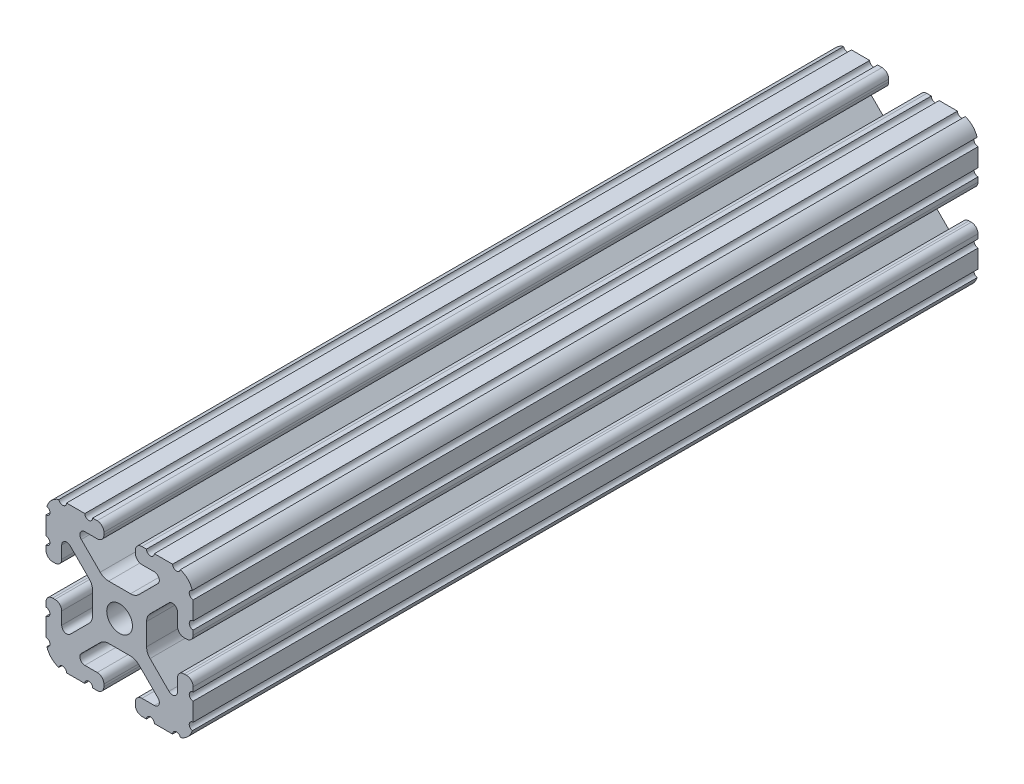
ISO-10303-21;
HEADER;
FILE_DESCRIPTION(('STEP AP214'),'2;1');
FILE_NAME('part.step','',(''),(''),'','','');
FILE_SCHEMA(('AUTOMOTIVE_DESIGN { 1 0 10303 214 1 1 1 1 }'));
ENDSEC;
DATA;
#1=APPLICATION_CONTEXT('core data for automotive mechanical design processes');
#2=APPLICATION_PROTOCOL_DEFINITION('international standard','automotive_design',2000,#1);
#3=PRODUCT_CONTEXT('',#1,'mechanical');
#4=PRODUCT('Part','Part','',(#3));
#5=PRODUCT_RELATED_PRODUCT_CATEGORY('part','',(#4));
#6=PRODUCT_DEFINITION_FORMATION('','',#4);
#7=PRODUCT_DEFINITION_CONTEXT('part definition',#1,'design');
#8=PRODUCT_DEFINITION('design','',#6,#7);
#9=PRODUCT_DEFINITION_SHAPE('','',#8);
#10=(LENGTH_UNIT() NAMED_UNIT(*) SI_UNIT(.MILLI.,.METRE.));
#11=(NAMED_UNIT(*) PLANE_ANGLE_UNIT() SI_UNIT($,.RADIAN.));
#12=(NAMED_UNIT(*) SI_UNIT($,.STERADIAN.) SOLID_ANGLE_UNIT());
#13=UNCERTAINTY_MEASURE_WITH_UNIT(LENGTH_MEASURE(1.E-05),#10,'distance_accuracy_value','');
#14=(GEOMETRIC_REPRESENTATION_CONTEXT(3) GLOBAL_UNCERTAINTY_ASSIGNED_CONTEXT((#13)) GLOBAL_UNIT_ASSIGNED_CONTEXT((#10,
#11,#12)) REPRESENTATION_CONTEXT('',''));
#15=CARTESIAN_POINT('',(0.,0.,0.));
#16=DIRECTION('',(0.,0.,1.));
#17=DIRECTION('',(1.,0.,0.));
#18=AXIS2_PLACEMENT_3D('',#15,#16,#17);
#19=CARTESIAN_POINT('',(5.7912,-19.05,457.2));
#20=DIRECTION('',(0.,1.,0.));
#21=DIRECTION('',(-1.,0.,0.));
#22=AXIS2_PLACEMENT_3D('',#19,#20,#21);
#23=PLANE('',#22);
#24=DIRECTION('',(1.,0.,0.));
#25=VECTOR('',#24,1.);
#26=CARTESIAN_POINT('',(5.7912,-19.05,-254.));
#27=LINE('',#26,#25);
#28=CARTESIAN_POINT('',(5.7912,-19.05,-254.));
#29=VERTEX_POINT('',#28);
#30=CARTESIAN_POINT('',(6.96430523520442,-19.05,-254.));
#31=VERTEX_POINT('',#30);
#32=EDGE_CURVE('E1137',#29,#31,#27,.T.);
#33=ORIENTED_EDGE('',*,*,#32,.F.);
#34=DIRECTION('',(0.,0.,-1.));
#35=VECTOR('',#34,1.);
#36=CARTESIAN_POINT('',(5.7912,-19.05,457.2));
#37=LINE('',#36,#35);
#38=CARTESIAN_POINT('',(5.7912,-19.05,-457.2));
#39=VERTEX_POINT('',#38);
#40=EDGE_CURVE('E1091',#29,#39,#37,.T.);
#41=ORIENTED_EDGE('',*,*,#40,.T.);
#42=DIRECTION('',(1.,0.,0.));
#43=VECTOR('',#42,1.);
#44=CARTESIAN_POINT('',(5.7912,-19.05,-457.2));
#45=LINE('',#44,#43);
#46=CARTESIAN_POINT('',(6.96430523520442,-19.05,-457.2));
#47=VERTEX_POINT('',#46);
#48=EDGE_CURVE('E1003',#39,#47,#45,.T.);
#49=ORIENTED_EDGE('',*,*,#48,.T.);
#50=DIRECTION('',(0.,0.,1.));
#51=VECTOR('',#50,1.);
#52=CARTESIAN_POINT('',(6.96430523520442,-19.05,-457.2));
#53=LINE('',#52,#51);
#54=EDGE_CURVE('E986',#47,#31,#53,.T.);
#55=ORIENTED_EDGE('',*,*,#54,.T.);
#56=EDGE_LOOP('',(#33,#41,#49,#55));
#57=FACE_BOUND('',#56,.T.);
#58=ADVANCED_FACE('F37',(#57),#23,.F.);
#59=CARTESIAN_POINT('',(19.05,-5.7912,457.2));
#60=DIRECTION('',(-1.,0.,0.));
#61=DIRECTION('',(0.,-1.,0.));
#62=AXIS2_PLACEMENT_3D('',#59,#60,#61);
#63=PLANE('',#62);
#64=DIRECTION('',(0.,1.,0.));
#65=VECTOR('',#64,1.);
#66=CARTESIAN_POINT('',(19.05,-5.7912,-254.));
#67=LINE('',#66,#65);
#68=CARTESIAN_POINT('',(19.05,-13.7234770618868,-254.));
#69=VERTEX_POINT('',#68);
#70=CARTESIAN_POINT('',(19.05,-8.99630523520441,-254.));
#71=VERTEX_POINT('',#70);
#72=EDGE_CURVE('E1110',#69,#71,#67,.T.);
#73=ORIENTED_EDGE('',*,*,#72,.F.);
#74=DIRECTION('',(0.,0.,1.));
#75=VECTOR('',#74,1.);
#76=CARTESIAN_POINT('',(19.05,-13.7234770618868,-457.2));
#77=LINE('',#76,#75);
#78=CARTESIAN_POINT('',(19.05,-13.7234770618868,-457.2));
#79=VERTEX_POINT('',#78);
#80=EDGE_CURVE('E989',#69,#79,#77,.F.);
#81=ORIENTED_EDGE('',*,*,#80,.T.);
#82=DIRECTION('',(0.,1.,0.));
#83=VECTOR('',#82,1.);
#84=CARTESIAN_POINT('',(19.05,-5.7912,-457.2));
#85=LINE('',#84,#83);
#86=CARTESIAN_POINT('',(19.05,-8.99630523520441,-457.2));
#87=VERTEX_POINT('',#86);
#88=EDGE_CURVE('E1012',#79,#87,#85,.T.);
#89=ORIENTED_EDGE('',*,*,#88,.T.);
#90=DIRECTION('',(0.,0.,1.));
#91=VECTOR('',#90,1.);
#92=CARTESIAN_POINT('',(19.05,-8.99630523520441,-457.2));
#93=LINE('',#92,#91);
#94=EDGE_CURVE('E996',#87,#71,#93,.T.);
#95=ORIENTED_EDGE('',*,*,#94,.T.);
#96=EDGE_LOOP('',(#73,#81,#89,#95));
#97=FACE_BOUND('',#96,.T.);
#98=ADVANCED_FACE('F1107',(#97),#63,.F.);
#99=CARTESIAN_POINT('',(5.7912,-17.3228,457.2));
#100=DIRECTION('',(0.,0.,-1.));
#101=DIRECTION('',(-1.,0.,0.));
#102=AXIS2_PLACEMENT_3D('',#99,#100,#101);
#103=CYLINDRICAL_SURFACE('',#102,1.7272);
#104=CARTESIAN_POINT('',(5.7912,-17.3228,-254.));
#105=DIRECTION('',(0.,0.,1.));
#106=DIRECTION('',(1.,0.,0.));
#107=AXIS2_PLACEMENT_3D('',#104,#105,#106);
#108=CIRCLE('',#107,1.7272);
#109=CARTESIAN_POINT('',(4.064,-17.3228,-254.));
#110=VERTEX_POINT('',#109);
#111=EDGE_CURVE('E1140',#110,#29,#108,.T.);
#112=ORIENTED_EDGE('',*,*,#111,.F.);
#113=DIRECTION('',(0.,0.,-1.));
#114=VECTOR('',#113,1.);
#115=CARTESIAN_POINT('',(4.064,-17.3228,457.2));
#116=LINE('',#115,#114);
#117=CARTESIAN_POINT('',(4.064,-17.3228,-457.2));
#118=VERTEX_POINT('',#117);
#119=EDGE_CURVE('E1061',#110,#118,#116,.T.);
#120=ORIENTED_EDGE('',*,*,#119,.T.);
#121=CARTESIAN_POINT('',(5.7912,-17.3228,-457.2));
#122=DIRECTION('',(0.,0.,1.));
#123=DIRECTION('',(1.,0.,0.));
#124=AXIS2_PLACEMENT_3D('',#121,#122,#123);
#125=CIRCLE('',#124,1.7272);
#126=EDGE_CURVE('E999',#118,#39,#125,.T.);
#127=ORIENTED_EDGE('',*,*,#126,.T.);
#128=ORIENTED_EDGE('',*,*,#40,.F.);
#129=EDGE_LOOP('',(#112,#120,#127,#128));
#130=FACE_BOUND('',#129,.T.);
#131=ADVANCED_FACE('F39',(#130),#103,.T.);
#132=DIRECTION('',(1.,0.,0.));
#133=VECTOR('',#132,1.);
#134=CARTESIAN_POINT('',(5.7912,-19.05,-254.));
#135=LINE('',#134,#133);
#136=CARTESIAN_POINT('',(8.99630523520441,-19.05,-254.));
#137=VERTEX_POINT('',#136);
#138=CARTESIAN_POINT('',(13.7234770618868,-19.05,-254.));
#139=VERTEX_POINT('',#138);
#140=EDGE_CURVE('E1128',#137,#139,#135,.T.);
#141=ORIENTED_EDGE('',*,*,#140,.F.);
#142=DIRECTION('',(0.,0.,1.));
#143=VECTOR('',#142,1.);
#144=CARTESIAN_POINT('',(8.99630523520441,-19.05,-457.2));
#145=LINE('',#144,#143);
#146=CARTESIAN_POINT('',(8.99630523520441,-19.05,-457.2));
#147=VERTEX_POINT('',#146);
#148=EDGE_CURVE('E984',#137,#147,#145,.F.);
#149=ORIENTED_EDGE('',*,*,#148,.T.);
#150=CARTESIAN_POINT('',(13.7234770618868,-19.05,-457.2));
#151=VERTEX_POINT('',#150);
#152=EDGE_CURVE('E1002',#147,#151,#45,.T.);
#153=ORIENTED_EDGE('',*,*,#152,.T.);
#154=DIRECTION('',(0.,0.,1.));
#155=VECTOR('',#154,1.);
#156=CARTESIAN_POINT('',(13.7234770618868,-19.05,-457.2));
#157=LINE('',#156,#155);
#158=EDGE_CURVE('E59',#151,#139,#157,.T.);
#159=ORIENTED_EDGE('',*,*,#158,.T.);
#160=EDGE_LOOP('',(#141,#149,#153,#159));
#161=FACE_BOUND('',#160,.T.);
#162=ADVANCED_FACE('F1125',(#161),#23,.F.);
#163=CARTESIAN_POINT('',(14.3002,-14.3002,457.2));
#164=DIRECTION('',(0.,0.,-1.));
#165=DIRECTION('',(-1.,0.,0.));
#166=AXIS2_PLACEMENT_3D('',#163,#164,#165);
#167=CYLINDRICAL_SURFACE('',#166,4.7498);
#168=CARTESIAN_POINT('',(14.3002,-14.3002,-254.));
#169=DIRECTION('',(0.,0.,1.));
#170=DIRECTION('',(1.,0.,0.));
#171=AXIS2_PLACEMENT_3D('',#168,#169,#170);
#172=CIRCLE('',#171,4.7498);
#173=CARTESIAN_POINT('',(15.7312177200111,-18.8293045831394,-254.));
#174=VERTEX_POINT('',#173);
#175=CARTESIAN_POINT('',(18.8293045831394,-15.7312177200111,-254.));
#176=VERTEX_POINT('',#175);
#177=EDGE_CURVE('E1119',#174,#176,#172,.T.);
#178=ORIENTED_EDGE('',*,*,#177,.F.);
#179=DIRECTION('',(0.,0.,1.));
#180=VECTOR('',#179,1.);
#181=CARTESIAN_POINT('',(15.7312177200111,-18.8293045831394,-1.11022302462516E-13));
#182=LINE('',#181,#180);
#183=CARTESIAN_POINT('',(15.7312177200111,-18.8293045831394,-457.2));
#184=VERTEX_POINT('',#183);
#185=EDGE_CURVE('E981',#174,#184,#182,.F.);
#186=ORIENTED_EDGE('',*,*,#185,.T.);
#187=CARTESIAN_POINT('',(14.3002,-14.3002,-457.2));
#188=DIRECTION('',(0.,0.,1.));
#189=DIRECTION('',(1.,0.,0.));
#190=AXIS2_PLACEMENT_3D('',#187,#188,#189);
#191=CIRCLE('',#190,4.7498);
#192=CARTESIAN_POINT('',(18.8293045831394,-15.7312177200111,-457.2));
#193=VERTEX_POINT('',#192);
#194=EDGE_CURVE('E1006',#184,#193,#191,.T.);
#195=ORIENTED_EDGE('',*,*,#194,.T.);
#196=DIRECTION('',(0.,0.,1.));
#197=VECTOR('',#196,1.);
#198=CARTESIAN_POINT('',(18.8293045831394,-15.7312177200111,-1.11022302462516E-13));
#199=LINE('',#198,#197);
#200=EDGE_CURVE('E991',#193,#176,#199,.T.);
#201=ORIENTED_EDGE('',*,*,#200,.T.);
#202=EDGE_LOOP('',(#178,#186,#195,#201));
#203=FACE_BOUND('',#202,.T.);
#204=ADVANCED_FACE('F1117',(#203),#167,.T.);
#205=DIRECTION('',(0.,1.,0.));
#206=VECTOR('',#205,1.);
#207=CARTESIAN_POINT('',(19.05,-5.7912,-254.));
#208=LINE('',#207,#206);
#209=CARTESIAN_POINT('',(19.05,-6.96430523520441,-254.));
#210=VERTEX_POINT('',#209);
#211=CARTESIAN_POINT('',(19.05,-5.7912,-254.));
#212=VERTEX_POINT('',#211);
#213=EDGE_CURVE('E1542',#210,#212,#208,.T.);
#214=ORIENTED_EDGE('',*,*,#213,.F.);
#215=DIRECTION('',(0.,0.,1.));
#216=VECTOR('',#215,1.);
#217=CARTESIAN_POINT('',(19.05,-6.96430523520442,-457.2));
#218=LINE('',#217,#216);
#219=CARTESIAN_POINT('',(19.05,-6.96430523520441,-457.2));
#220=VERTEX_POINT('',#219);
#221=EDGE_CURVE('E994',#210,#220,#218,.F.);
#222=ORIENTED_EDGE('',*,*,#221,.T.);
#223=CARTESIAN_POINT('',(19.05,-5.7912,-457.2));
#224=VERTEX_POINT('',#223);
#225=EDGE_CURVE('E1009',#220,#224,#85,.T.);
#226=ORIENTED_EDGE('',*,*,#225,.T.);
#227=DIRECTION('',(0.,0.,-1.));
#228=VECTOR('',#227,1.);
#229=CARTESIAN_POINT('',(19.05,-5.7912,457.2));
#230=LINE('',#229,#228);
#231=EDGE_CURVE('E1089',#212,#224,#230,.T.);
#232=ORIENTED_EDGE('',*,*,#231,.F.);
#233=EDGE_LOOP('',(#214,#222,#226,#232));
#234=FACE_BOUND('',#233,.T.);
#235=ADVANCED_FACE('F1568',(#234),#63,.F.);
#236=CARTESIAN_POINT('',(17.3228,-5.7912,457.2));
#237=DIRECTION('',(0.,0.,-1.));
#238=DIRECTION('',(-1.,0.,0.));
#239=AXIS2_PLACEMENT_3D('',#236,#237,#238);
#240=CYLINDRICAL_SURFACE('',#239,1.7272);
#241=CARTESIAN_POINT('',(17.3228,-5.7912,-254.));
#242=DIRECTION('',(0.,0.,1.));
#243=DIRECTION('',(1.,0.,0.));
#244=AXIS2_PLACEMENT_3D('',#241,#242,#243);
#245=CIRCLE('',#244,1.7272);
#246=CARTESIAN_POINT('',(17.3228,-4.064,-254.));
#247=VERTEX_POINT('',#246);
#248=EDGE_CURVE('E1540',#212,#247,#245,.T.);
#249=ORIENTED_EDGE('',*,*,#248,.F.);
#250=ORIENTED_EDGE('',*,*,#231,.T.);
#251=CARTESIAN_POINT('',(17.3228,-5.7912,-457.2));
#252=DIRECTION('',(0.,0.,1.));
#253=DIRECTION('',(-1.,0.,0.));
#254=AXIS2_PLACEMENT_3D('',#251,#252,#253);
#255=CIRCLE('',#254,1.7272);
#256=CARTESIAN_POINT('',(17.3228,-4.064,-457.2));
#257=VERTEX_POINT('',#256);
#258=EDGE_CURVE('E1013',#224,#257,#255,.T.);
#259=ORIENTED_EDGE('',*,*,#258,.T.);
#260=DIRECTION('',(0.,0.,-1.));
#261=VECTOR('',#260,1.);
#262=CARTESIAN_POINT('',(17.3228,-4.064,457.2));
#263=LINE('',#262,#261);
#264=EDGE_CURVE('E1087',#247,#257,#263,.T.);
#265=ORIENTED_EDGE('',*,*,#264,.F.);
#266=EDGE_LOOP('',(#249,#250,#259,#265));
#267=FACE_BOUND('',#266,.T.);
#268=ADVANCED_FACE('F2397',(#267),#240,.T.);
#269=CARTESIAN_POINT('',(16.7132,-4.064,457.2));
#270=DIRECTION('',(0.,-1.,0.));
#271=DIRECTION('',(1.,0.,0.));
#272=AXIS2_PLACEMENT_3D('',#269,#270,#271);
#273=PLANE('',#272);
#274=DIRECTION('',(-1.,0.,0.));
#275=VECTOR('',#274,1.);
#276=CARTESIAN_POINT('',(16.7132,-4.064,-254.));
#277=LINE('',#276,#275);
#278=CARTESIAN_POINT('',(16.7132,-4.064,-254.));
#279=VERTEX_POINT('',#278);
#280=EDGE_CURVE('E1538',#247,#279,#277,.T.);
#281=ORIENTED_EDGE('',*,*,#280,.F.);
#282=ORIENTED_EDGE('',*,*,#264,.T.);
#283=DIRECTION('',(-1.,0.,0.));
#284=VECTOR('',#283,1.);
#285=CARTESIAN_POINT('',(16.7132,-4.064,-457.2));
#286=LINE('',#285,#284);
#287=CARTESIAN_POINT('',(16.7132,-4.064,-457.2));
#288=VERTEX_POINT('',#287);
#289=EDGE_CURVE('E1016',#257,#288,#286,.T.);
#290=ORIENTED_EDGE('',*,*,#289,.T.);
#291=DIRECTION('',(0.,0.,-1.));
#292=VECTOR('',#291,1.);
#293=CARTESIAN_POINT('',(16.7132,-4.064,457.2));
#294=LINE('',#293,#292);
#295=EDGE_CURVE('E1085',#279,#288,#294,.T.);
#296=ORIENTED_EDGE('',*,*,#295,.F.);
#297=EDGE_LOOP('',(#281,#282,#290,#296));
#298=FACE_BOUND('',#297,.T.);
#299=ADVANCED_FACE('F2387',(#298),#273,.F.);
#300=CARTESIAN_POINT('',(16.7132,-5.7912,457.2));
#301=DIRECTION('',(0.,0.,-1.));
#302=DIRECTION('',(-1.,0.,0.));
#303=AXIS2_PLACEMENT_3D('',#300,#301,#302);
#304=CYLINDRICAL_SURFACE('',#303,1.7272);
#305=CARTESIAN_POINT('',(16.7132,-5.7912,-254.));
#306=DIRECTION('',(0.,0.,1.));
#307=DIRECTION('',(1.,0.,0.));
#308=AXIS2_PLACEMENT_3D('',#305,#306,#307);
#309=CIRCLE('',#308,1.7272);
#310=CARTESIAN_POINT('',(14.986,-5.7912,-254.));
#311=VERTEX_POINT('',#310);
#312=EDGE_CURVE('E1536',#279,#311,#309,.T.);
#313=ORIENTED_EDGE('',*,*,#312,.F.);
#314=ORIENTED_EDGE('',*,*,#295,.T.);
#315=CARTESIAN_POINT('',(16.7132,-5.7912,-457.2));
#316=DIRECTION('',(0.,0.,1.));
#317=DIRECTION('',(-1.,0.,0.));
#318=AXIS2_PLACEMENT_3D('',#315,#316,#317);
#319=CIRCLE('',#318,1.7272);
#320=CARTESIAN_POINT('',(14.986,-5.7912,-457.2));
#321=VERTEX_POINT('',#320);
#322=EDGE_CURVE('E1019',#288,#321,#319,.T.);
#323=ORIENTED_EDGE('',*,*,#322,.T.);
#324=DIRECTION('',(0.,0.,-1.));
#325=VECTOR('',#324,1.);
#326=CARTESIAN_POINT('',(14.986,-5.7912,457.2));
#327=LINE('',#326,#325);
#328=EDGE_CURVE('E1083',#311,#321,#327,.T.);
#329=ORIENTED_EDGE('',*,*,#328,.F.);
#330=EDGE_LOOP('',(#313,#314,#323,#329));
#331=FACE_BOUND('',#330,.T.);
#332=ADVANCED_FACE('F2377',(#331),#304,.T.);
#333=CARTESIAN_POINT('',(14.986,-8.99630523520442,457.2));
#334=DIRECTION('',(1.,0.,0.));
#335=DIRECTION('',(0.,0.,-1.));
#336=AXIS2_PLACEMENT_3D('',#333,#334,#335);
#337=PLANE('',#336);
#338=DIRECTION('',(0.,-1.,0.));
#339=VECTOR('',#338,1.);
#340=CARTESIAN_POINT('',(14.986,-8.99630523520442,-254.));
#341=LINE('',#340,#339);
#342=CARTESIAN_POINT('',(14.986,-8.99630523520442,-254.));
#343=VERTEX_POINT('',#342);
#344=EDGE_CURVE('E1534',#311,#343,#341,.T.);
#345=ORIENTED_EDGE('',*,*,#344,.F.);
#346=ORIENTED_EDGE('',*,*,#328,.T.);
#347=DIRECTION('',(0.,-1.,0.));
#348=VECTOR('',#347,1.);
#349=CARTESIAN_POINT('',(14.986,-8.99630523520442,-457.2));
#350=LINE('',#349,#348);
#351=CARTESIAN_POINT('',(14.986,-8.99630523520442,-457.2));
#352=VERTEX_POINT('',#351);
#353=EDGE_CURVE('E1022',#321,#352,#350,.T.);
#354=ORIENTED_EDGE('',*,*,#353,.T.);
#355=DIRECTION('',(0.,0.,-1.));
#356=VECTOR('',#355,1.);
#357=CARTESIAN_POINT('',(14.986,-8.99630523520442,457.2));
#358=LINE('',#357,#356);
#359=EDGE_CURVE('E1081',#343,#352,#358,.T.);
#360=ORIENTED_EDGE('',*,*,#359,.F.);
#361=EDGE_LOOP('',(#345,#346,#354,#360));
#362=FACE_BOUND('',#361,.T.);
#363=ADVANCED_FACE('F2367',(#362),#337,.F.);
#364=CARTESIAN_POINT('',(13.6953052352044,-8.99630523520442,457.2));
#365=DIRECTION('',(0.,0.,-1.));
#366=DIRECTION('',(-1.,0.,0.));
#367=AXIS2_PLACEMENT_3D('',#364,#365,#366);
#368=CYLINDRICAL_SURFACE('',#367,1.29069476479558);
#369=CARTESIAN_POINT('',(13.6953052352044,-8.99630523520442,-254.));
#370=DIRECTION('',(0.,0.,1.));
#371=DIRECTION('',(1.,0.,0.));
#372=AXIS2_PLACEMENT_3D('',#369,#370,#371);
#373=CIRCLE('',#372,1.29069476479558);
#374=CARTESIAN_POINT('',(12.7826462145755,-9.90896425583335,-254.));
#375=VERTEX_POINT('',#374);
#376=EDGE_CURVE('E1532',#343,#375,#373,.F.);
#377=ORIENTED_EDGE('',*,*,#376,.F.);
#378=ORIENTED_EDGE('',*,*,#359,.T.);
#379=CARTESIAN_POINT('',(13.6953052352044,-8.99630523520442,-457.2));
#380=DIRECTION('',(0.,0.,-1.));
#381=DIRECTION('',(1.,0.,0.));
#382=AXIS2_PLACEMENT_3D('',#379,#380,#381);
#383=CIRCLE('',#382,1.29069476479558);
#384=CARTESIAN_POINT('',(12.7826462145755,-9.90896425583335,-457.2));
#385=VERTEX_POINT('',#384);
#386=EDGE_CURVE('E1025',#352,#385,#383,.T.);
#387=ORIENTED_EDGE('',*,*,#386,.T.);
#388=DIRECTION('',(0.,0.,-1.));
#389=VECTOR('',#388,1.);
#390=CARTESIAN_POINT('',(12.7826462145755,-9.90896425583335,457.2));
#391=LINE('',#390,#389);
#392=EDGE_CURVE('E1079',#375,#385,#391,.T.);
#393=ORIENTED_EDGE('',*,*,#392,.F.);
#394=EDGE_LOOP('',(#377,#378,#387,#393));
#395=FACE_BOUND('',#394,.T.);
#396=ADVANCED_FACE('F2357',(#395),#368,.F.);
#397=CARTESIAN_POINT('',(12.7826462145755,-9.90896425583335,457.2));
#398=DIRECTION('',(-0.707106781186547,-0.707106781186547,0.));
#399=DIRECTION('',(0.707106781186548,-0.707106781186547,0.));
#400=AXIS2_PLACEMENT_3D('',#397,#398,#399);
#401=PLANE('',#400);
#402=DIRECTION('',(-0.707106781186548,0.707106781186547,0.));
#403=VECTOR('',#402,1.);
#404=CARTESIAN_POINT('',(12.7826462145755,-9.90896425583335,-254.));
#405=LINE('',#404,#403);
#406=CARTESIAN_POINT('',(7.8888977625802,-5.01521580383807,-254.));
#407=VERTEX_POINT('',#406);
#408=EDGE_CURVE('E1530',#375,#407,#405,.T.);
#409=ORIENTED_EDGE('',*,*,#408,.F.);
#410=ORIENTED_EDGE('',*,*,#392,.T.);
#411=DIRECTION('',(-0.707106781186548,0.707106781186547,0.));
#412=VECTOR('',#411,1.);
#413=CARTESIAN_POINT('',(12.7826462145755,-9.90896425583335,-457.2));
#414=LINE('',#413,#412);
#415=CARTESIAN_POINT('',(7.8888977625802,-5.01521580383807,-457.2));
#416=VERTEX_POINT('',#415);
#417=EDGE_CURVE('E1028',#385,#416,#414,.T.);
#418=ORIENTED_EDGE('',*,*,#417,.T.);
#419=DIRECTION('',(0.,0.,-1.));
#420=VECTOR('',#419,1.);
#421=CARTESIAN_POINT('',(7.8888977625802,-5.01521580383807,457.2));
#422=LINE('',#421,#420);
#423=EDGE_CURVE('E1077',#407,#416,#422,.T.);
#424=ORIENTED_EDGE('',*,*,#423,.F.);
#425=EDGE_LOOP('',(#409,#410,#418,#424));
#426=FACE_BOUND('',#425,.T.);
#427=ADVANCED_FACE('F2347',(#426),#401,.F.);
#428=CARTESIAN_POINT('',(10.0711,-2.83301356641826,457.2));
#429=DIRECTION('',(0.,0.,-1.));
#430=DIRECTION('',(-1.,0.,0.));
#431=AXIS2_PLACEMENT_3D('',#428,#429,#430);
#432=CYLINDRICAL_SURFACE('',#431,3.0861);
#433=CARTESIAN_POINT('',(10.0711,-2.83301356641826,-254.));
#434=DIRECTION('',(0.,0.,1.));
#435=DIRECTION('',(1.,0.,0.));
#436=AXIS2_PLACEMENT_3D('',#433,#434,#435);
#437=CIRCLE('',#436,3.0861);
#438=CARTESIAN_POINT('',(6.985,-2.83301356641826,-254.));
#439=VERTEX_POINT('',#438);
#440=EDGE_CURVE('E1528',#407,#439,#437,.F.);
#441=ORIENTED_EDGE('',*,*,#440,.F.);
#442=ORIENTED_EDGE('',*,*,#423,.T.);
#443=CARTESIAN_POINT('',(10.0711,-2.83301356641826,-457.2));
#444=DIRECTION('',(0.,0.,-1.));
#445=DIRECTION('',(-1.,0.,0.));
#446=AXIS2_PLACEMENT_3D('',#443,#444,#445);
#447=CIRCLE('',#446,3.0861);
#448=CARTESIAN_POINT('',(6.985,-2.83301356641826,-457.2));
#449=VERTEX_POINT('',#448);
#450=EDGE_CURVE('E1031',#416,#449,#447,.T.);
#451=ORIENTED_EDGE('',*,*,#450,.T.);
#452=DIRECTION('',(0.,0.,-1.));
#453=VECTOR('',#452,1.);
#454=CARTESIAN_POINT('',(6.985,-2.83301356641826,457.2));
#455=LINE('',#454,#453);
#456=EDGE_CURVE('E1075',#439,#449,#455,.T.);
#457=ORIENTED_EDGE('',*,*,#456,.F.);
#458=EDGE_LOOP('',(#441,#442,#451,#457));
#459=FACE_BOUND('',#458,.T.);
#460=ADVANCED_FACE('F1560',(#459),#432,.F.);
#461=CARTESIAN_POINT('',(6.985,0.,457.2));
#462=DIRECTION('',(-1.,0.,0.));
#463=DIRECTION('',(0.,0.,1.));
#464=AXIS2_PLACEMENT_3D('',#461,#462,#463);
#465=PLANE('',#464);
#466=DIRECTION('',(0.,1.,0.));
#467=VECTOR('',#466,1.);
#468=CARTESIAN_POINT('',(6.985,0.,-254.));
#469=LINE('',#468,#467);
#470=CARTESIAN_POINT('',(6.985,2.83301356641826,-254.));
#471=VERTEX_POINT('',#470);
#472=EDGE_CURVE('E1526',#439,#471,#469,.T.);
#473=ORIENTED_EDGE('',*,*,#472,.F.);
#474=ORIENTED_EDGE('',*,*,#456,.T.);
#475=DIRECTION('',(0.,1.,0.));
#476=VECTOR('',#475,1.);
#477=CARTESIAN_POINT('',(6.985,0.,-457.2));
#478=LINE('',#477,#476);
#479=CARTESIAN_POINT('',(6.985,2.83301356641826,-457.2));
#480=VERTEX_POINT('',#479);
#481=EDGE_CURVE('E1034',#449,#480,#478,.T.);
#482=ORIENTED_EDGE('',*,*,#481,.T.);
#483=DIRECTION('',(0.,0.,-1.));
#484=VECTOR('',#483,1.);
#485=CARTESIAN_POINT('',(6.985,2.83301356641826,457.2));
#486=LINE('',#485,#484);
#487=EDGE_CURVE('E838',#471,#480,#486,.T.);
#488=ORIENTED_EDGE('',*,*,#487,.F.);
#489=EDGE_LOOP('',(#473,#474,#482,#488));
#490=FACE_BOUND('',#489,.T.);
#491=ADVANCED_FACE('F1552',(#490),#465,.F.);
#492=CARTESIAN_POINT('',(0.,0.,457.2));
#493=DIRECTION('',(0.,0.,-1.));
#494=DIRECTION('',(-1.,0.,0.));
#495=AXIS2_PLACEMENT_3D('',#492,#493,#494);
#496=CYLINDRICAL_SURFACE('',#495,3.32740000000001);
#497=CARTESIAN_POINT('',(0.,0.,-457.2));
#498=DIRECTION('',(0.,0.,-1.));
#499=DIRECTION('',(1.,0.,0.));
#500=AXIS2_PLACEMENT_3D('',#497,#498,#499);
#501=CIRCLE('',#500,3.32740000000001);
#502=CARTESIAN_POINT('',(-3.32740000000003,0.,-457.2));
#503=VERTEX_POINT('',#502);
#504=EDGE_CURVE('E1037',#503,#503,#501,.T.);
#505=CARTESIAN_POINT('',(0.,0.,-254.));
#506=DIRECTION('',(0.,0.,1.));
#507=DIRECTION('',(1.,0.,0.));
#508=AXIS2_PLACEMENT_3D('',#505,#506,#507);
#509=CIRCLE('',#508,3.32740000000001);
#510=CARTESIAN_POINT('',(-3.32740000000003,0.,-254.));
#511=VERTEX_POINT('',#510);
#512=EDGE_CURVE('E1377',#511,#511,#509,.F.);
#513=CARTESIAN_POINT('',(-3.32740000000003,0.,-457.2));
#514=CARTESIAN_POINT('',(-3.32740000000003,0.,-455.083333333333));
#515=CARTESIAN_POINT('',(-3.32740000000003,0.,-452.966666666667));
#516=CARTESIAN_POINT('',(-3.32740000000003,0.,-448.733333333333));
#517=CARTESIAN_POINT('',(-3.32740000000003,0.,-446.616666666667));
#518=CARTESIAN_POINT('',(-3.32740000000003,0.,-442.383333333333));
#519=CARTESIAN_POINT('',(-3.32740000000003,0.,-440.266666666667));
#520=CARTESIAN_POINT('',(-3.32740000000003,0.,-436.033333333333));
#521=CARTESIAN_POINT('',(-3.32740000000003,0.,-433.916666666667));
#522=CARTESIAN_POINT('',(-3.32740000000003,0.,-429.683333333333));
#523=CARTESIAN_POINT('',(-3.32740000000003,0.,-427.566666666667));
#524=CARTESIAN_POINT('',(-3.32740000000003,0.,-423.333333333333));
#525=CARTESIAN_POINT('',(-3.32740000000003,0.,-421.216666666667));
#526=CARTESIAN_POINT('',(-3.32740000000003,0.,-416.983333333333));
#527=CARTESIAN_POINT('',(-3.32740000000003,0.,-414.866666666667));
#528=CARTESIAN_POINT('',(-3.32740000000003,0.,-410.633333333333));
#529=CARTESIAN_POINT('',(-3.32740000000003,0.,-408.516666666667));
#530=CARTESIAN_POINT('',(-3.32740000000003,0.,-404.283333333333));
#531=CARTESIAN_POINT('',(-3.32740000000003,0.,-402.166666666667));
#532=CARTESIAN_POINT('',(-3.32740000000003,0.,-397.933333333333));
#533=CARTESIAN_POINT('',(-3.32740000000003,0.,-395.816666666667));
#534=CARTESIAN_POINT('',(-3.32740000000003,0.,-391.583333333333));
#535=CARTESIAN_POINT('',(-3.32740000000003,0.,-389.466666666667));
#536=CARTESIAN_POINT('',(-3.32740000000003,0.,-385.233333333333));
#537=CARTESIAN_POINT('',(-3.32740000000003,0.,-383.116666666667));
#538=CARTESIAN_POINT('',(-3.32740000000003,0.,-378.883333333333));
#539=CARTESIAN_POINT('',(-3.32740000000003,0.,-376.766666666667));
#540=CARTESIAN_POINT('',(-3.32740000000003,0.,-372.533333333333));
#541=CARTESIAN_POINT('',(-3.32740000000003,0.,-370.416666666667));
#542=CARTESIAN_POINT('',(-3.32740000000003,0.,-366.183333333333));
#543=CARTESIAN_POINT('',(-3.32740000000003,0.,-364.066666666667));
#544=CARTESIAN_POINT('',(-3.32740000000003,0.,-359.833333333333));
#545=CARTESIAN_POINT('',(-3.32740000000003,0.,-357.716666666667));
#546=CARTESIAN_POINT('',(-3.32740000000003,0.,-353.483333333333));
#547=CARTESIAN_POINT('',(-3.32740000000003,0.,-351.366666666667));
#548=CARTESIAN_POINT('',(-3.32740000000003,0.,-347.133333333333));
#549=CARTESIAN_POINT('',(-3.32740000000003,0.,-345.016666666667));
#550=CARTESIAN_POINT('',(-3.32740000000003,0.,-340.783333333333));
#551=CARTESIAN_POINT('',(-3.32740000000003,0.,-338.666666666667));
#552=CARTESIAN_POINT('',(-3.32740000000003,0.,-334.433333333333));
#553=CARTESIAN_POINT('',(-3.32740000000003,0.,-332.316666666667));
#554=CARTESIAN_POINT('',(-3.32740000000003,0.,-328.083333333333));
#555=CARTESIAN_POINT('',(-3.32740000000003,0.,-325.966666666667));
#556=CARTESIAN_POINT('',(-3.32740000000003,0.,-321.733333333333));
#557=CARTESIAN_POINT('',(-3.32740000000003,0.,-319.616666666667));
#558=CARTESIAN_POINT('',(-3.32740000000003,0.,-315.383333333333));
#559=CARTESIAN_POINT('',(-3.32740000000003,0.,-313.266666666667));
#560=CARTESIAN_POINT('',(-3.32740000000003,0.,-309.033333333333));
#561=CARTESIAN_POINT('',(-3.32740000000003,0.,-306.916666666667));
#562=CARTESIAN_POINT('',(-3.32740000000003,0.,-302.683333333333));
#563=CARTESIAN_POINT('',(-3.32740000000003,0.,-300.566666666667));
#564=CARTESIAN_POINT('',(-3.32740000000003,0.,-296.333333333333));
#565=CARTESIAN_POINT('',(-3.32740000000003,0.,-294.216666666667));
#566=CARTESIAN_POINT('',(-3.32740000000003,0.,-289.983333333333));
#567=CARTESIAN_POINT('',(-3.32740000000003,0.,-287.866666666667));
#568=CARTESIAN_POINT('',(-3.32740000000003,0.,-283.633333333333));
#569=CARTESIAN_POINT('',(-3.32740000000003,0.,-281.516666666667));
#570=CARTESIAN_POINT('',(-3.32740000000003,0.,-277.283333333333));
#571=CARTESIAN_POINT('',(-3.32740000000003,0.,-275.166666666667));
#572=CARTESIAN_POINT('',(-3.32740000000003,0.,-270.933333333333));
#573=CARTESIAN_POINT('',(-3.32740000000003,0.,-268.816666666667));
#574=CARTESIAN_POINT('',(-3.32740000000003,0.,-264.583333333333));
#575=CARTESIAN_POINT('',(-3.32740000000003,0.,-262.466666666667));
#576=CARTESIAN_POINT('',(-3.32740000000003,0.,-258.233333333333));
#577=CARTESIAN_POINT('',(-3.32740000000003,0.,-256.116666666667));
#578=CARTESIAN_POINT('',(-3.32740000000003,0.,-254.));
#579=B_SPLINE_CURVE_WITH_KNOTS('',3,(#513,#514,#515,#516,#517,#518,#519,#520,#521,#522,#523,
#524,#525,#526,#527,#528,#529,#530,#531,#532,#533,#534,#535,#536,#537,#538,#539,#540,#541,#542,
#543,#544,#545,#546,#547,#548,#549,#550,#551,#552,#553,#554,#555,#556,#557,#558,#559,#560,#561,
#562,#563,#564,#565,#566,#567,#568,#569,#570,#571,#572,#573,#574,#575,#576,#577,#578),
.UNSPECIFIED.,.F.,.F.,(4,2,2,2,2,2,2,2,2,2,2,2,2,2,2,2,2,2,2,2,2,2,2,2,2,2,2,2,2,2,2,2,4),(0.,
6.34999999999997,12.6999999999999,19.05,25.4,31.7499999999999,38.1,44.45,50.8,57.1499999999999,
63.4999999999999,69.85,76.1999999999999,82.5499999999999,88.9,95.2499999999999,101.6,107.95,
114.3,120.65,127.,133.35,139.7,146.05,152.4,158.75,165.1,171.45,177.8,184.15,190.5,196.85,
203.2),.UNSPECIFIED.);
#580=EDGE_CURVE('BSEAM1549',#503,#511,#579,.T.);
#581=ORIENTED_EDGE('',*,*,#504,.T.);
#582=ORIENTED_EDGE('',*,*,#512,.F.);
#583=ORIENTED_EDGE('',*,*,#580,.T.);
#584=ORIENTED_EDGE('',*,*,#580,.F.);
#585=EDGE_LOOP('',(#581,#583,#582,#584));
#586=FACE_BOUND('',#585,.T.);
#587=ADVANCED_FACE('F1549',(#586),#496,.F.);
#588=CARTESIAN_POINT('',(0.,-6.985,457.2));
#589=DIRECTION('',(0.,1.,0.));
#590=DIRECTION('',(0.,0.,1.));
#591=AXIS2_PLACEMENT_3D('',#588,#589,#590);
#592=PLANE('',#591);
#593=DIRECTION('',(1.,0.,0.));
#594=VECTOR('',#593,1.);
#595=CARTESIAN_POINT('',(0.,-6.985,-254.));
#596=LINE('',#595,#594);
#597=CARTESIAN_POINT('',(-2.83301356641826,-6.985,-254.));
#598=VERTEX_POINT('',#597);
#599=CARTESIAN_POINT('',(2.83301356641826,-6.985,-254.));
#600=VERTEX_POINT('',#599);
#601=EDGE_CURVE('E1484',#598,#600,#596,.T.);
#602=ORIENTED_EDGE('',*,*,#601,.F.);
#603=DIRECTION('',(0.,0.,-1.));
#604=VECTOR('',#603,1.);
#605=CARTESIAN_POINT('',(-2.83301356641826,-6.985,457.2));
#606=LINE('',#605,#604);
#607=CARTESIAN_POINT('',(-2.83301356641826,-6.985,-457.2));
#608=VERTEX_POINT('',#607);
#609=EDGE_CURVE('E952',#598,#608,#606,.T.);
#610=ORIENTED_EDGE('',*,*,#609,.T.);
#611=DIRECTION('',(1.,0.,0.));
#612=VECTOR('',#611,1.);
#613=CARTESIAN_POINT('',(0.,-6.985,-457.2));
#614=LINE('',#613,#612);
#615=CARTESIAN_POINT('',(2.83301356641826,-6.985,-457.2));
#616=VERTEX_POINT('',#615);
#617=EDGE_CURVE('E1040',#608,#616,#614,.T.);
#618=ORIENTED_EDGE('',*,*,#617,.T.);
#619=DIRECTION('',(0.,0.,-1.));
#620=VECTOR('',#619,1.);
#621=CARTESIAN_POINT('',(2.83301356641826,-6.985,457.2));
#622=LINE('',#621,#620);
#623=EDGE_CURVE('E1073',#600,#616,#622,.T.);
#624=ORIENTED_EDGE('',*,*,#623,.F.);
#625=EDGE_LOOP('',(#602,#610,#618,#624));
#626=FACE_BOUND('',#625,.T.);
#627=ADVANCED_FACE('F1551',(#626),#592,.F.);
#628=CARTESIAN_POINT('',(2.83301356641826,-10.0711,457.2));
#629=DIRECTION('',(0.,0.,-1.));
#630=DIRECTION('',(-1.,0.,0.));
#631=AXIS2_PLACEMENT_3D('',#628,#629,#630);
#632=CYLINDRICAL_SURFACE('',#631,3.0861);
#633=CARTESIAN_POINT('',(2.83301356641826,-10.0711,-254.));
#634=DIRECTION('',(0.,0.,1.));
#635=DIRECTION('',(1.,0.,0.));
#636=AXIS2_PLACEMENT_3D('',#633,#634,#635);
#637=CIRCLE('',#636,3.0861);
#638=CARTESIAN_POINT('',(5.01521580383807,-7.8888977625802,-254.));
#639=VERTEX_POINT('',#638);
#640=EDGE_CURVE('E1490',#600,#639,#637,.F.);
#641=ORIENTED_EDGE('',*,*,#640,.F.);
#642=ORIENTED_EDGE('',*,*,#623,.T.);
#643=CARTESIAN_POINT('',(2.83301356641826,-10.0711,-457.2));
#644=DIRECTION('',(0.,0.,-1.));
#645=DIRECTION('',(-1.,0.,0.));
#646=AXIS2_PLACEMENT_3D('',#643,#644,#645);
#647=CIRCLE('',#646,3.0861);
#648=CARTESIAN_POINT('',(5.01521580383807,-7.8888977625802,-457.2));
#649=VERTEX_POINT('',#648);
#650=EDGE_CURVE('E1043',#616,#649,#647,.T.);
#651=ORIENTED_EDGE('',*,*,#650,.T.);
#652=DIRECTION('',(0.,0.,-1.));
#653=VECTOR('',#652,1.);
#654=CARTESIAN_POINT('',(5.01521580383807,-7.8888977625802,457.2));
#655=LINE('',#654,#653);
#656=EDGE_CURVE('E1071',#639,#649,#655,.T.);
#657=ORIENTED_EDGE('',*,*,#656,.F.);
#658=EDGE_LOOP('',(#641,#642,#651,#657));
#659=FACE_BOUND('',#658,.T.);
#660=ADVANCED_FACE('F1174',(#659),#632,.F.);
#661=CARTESIAN_POINT('',(5.01521580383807,-7.8888977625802,457.2));
#662=DIRECTION('',(0.707106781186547,0.707106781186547,0.));
#663=DIRECTION('',(-0.707106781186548,0.707106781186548,0.));
#664=AXIS2_PLACEMENT_3D('',#661,#662,#663);
#665=PLANE('',#664);
#666=DIRECTION('',(0.707106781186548,-0.707106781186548,0.));
#667=VECTOR('',#666,1.);
#668=CARTESIAN_POINT('',(5.01521580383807,-7.8888977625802,-254.));
#669=LINE('',#668,#667);
#670=CARTESIAN_POINT('',(9.90896425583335,-12.7826462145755,-254.));
#671=VERTEX_POINT('',#670);
#672=EDGE_CURVE('E1171',#639,#671,#669,.T.);
#673=ORIENTED_EDGE('',*,*,#672,.F.);
#674=ORIENTED_EDGE('',*,*,#656,.T.);
#675=DIRECTION('',(0.707106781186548,-0.707106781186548,0.));
#676=VECTOR('',#675,1.);
#677=CARTESIAN_POINT('',(5.01521580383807,-7.8888977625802,-457.2));
#678=LINE('',#677,#676);
#679=CARTESIAN_POINT('',(9.90896425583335,-12.7826462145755,-457.2));
#680=VERTEX_POINT('',#679);
#681=EDGE_CURVE('E1046',#649,#680,#678,.T.);
#682=ORIENTED_EDGE('',*,*,#681,.T.);
#683=DIRECTION('',(0.,0.,-1.));
#684=VECTOR('',#683,1.);
#685=CARTESIAN_POINT('',(9.90896425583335,-12.7826462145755,457.2));
#686=LINE('',#685,#684);
#687=EDGE_CURVE('E1069',#671,#680,#686,.T.);
#688=ORIENTED_EDGE('',*,*,#687,.F.);
#689=EDGE_LOOP('',(#673,#674,#682,#688));
#690=FACE_BOUND('',#689,.T.);
#691=ADVANCED_FACE('F1169',(#690),#665,.F.);
#692=CARTESIAN_POINT('',(8.99630523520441,-13.6953052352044,457.2));
#693=DIRECTION('',(0.,0.,-1.));
#694=DIRECTION('',(-1.,0.,0.));
#695=AXIS2_PLACEMENT_3D('',#692,#693,#694);
#696=CYLINDRICAL_SURFACE('',#695,1.29069476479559);
#697=CARTESIAN_POINT('',(8.99630523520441,-13.6953052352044,-254.));
#698=DIRECTION('',(0.,0.,1.));
#699=DIRECTION('',(1.,0.,0.));
#700=AXIS2_PLACEMENT_3D('',#697,#698,#699);
#701=CIRCLE('',#700,1.29069476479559);
#702=CARTESIAN_POINT('',(8.99630523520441,-14.986,-254.));
#703=VERTEX_POINT('',#702);
#704=EDGE_CURVE('E1166',#671,#703,#701,.F.);
#705=ORIENTED_EDGE('',*,*,#704,.F.);
#706=ORIENTED_EDGE('',*,*,#687,.T.);
#707=CARTESIAN_POINT('',(8.99630523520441,-13.6953052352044,-457.2));
#708=DIRECTION('',(0.,0.,-1.));
#709=DIRECTION('',(1.,0.,0.));
#710=AXIS2_PLACEMENT_3D('',#707,#708,#709);
#711=CIRCLE('',#710,1.29069476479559);
#712=CARTESIAN_POINT('',(8.99630523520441,-14.986,-457.2));
#713=VERTEX_POINT('',#712);
#714=EDGE_CURVE('E1049',#680,#713,#711,.T.);
#715=ORIENTED_EDGE('',*,*,#714,.T.);
#716=DIRECTION('',(0.,0.,-1.));
#717=VECTOR('',#716,1.);
#718=CARTESIAN_POINT('',(8.99630523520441,-14.986,457.2));
#719=LINE('',#718,#717);
#720=EDGE_CURVE('E1067',#703,#713,#719,.T.);
#721=ORIENTED_EDGE('',*,*,#720,.F.);
#722=EDGE_LOOP('',(#705,#706,#715,#721));
#723=FACE_BOUND('',#722,.T.);
#724=ADVANCED_FACE('F1164',(#723),#696,.F.);
#725=CARTESIAN_POINT('',(5.7912,-14.986,457.2));
#726=DIRECTION('',(0.,-1.,0.));
#727=DIRECTION('',(1.,0.,0.));
#728=AXIS2_PLACEMENT_3D('',#725,#726,#727);
#729=PLANE('',#728);
#730=DIRECTION('',(-1.,0.,0.));
#731=VECTOR('',#730,1.);
#732=CARTESIAN_POINT('',(5.7912,-14.986,-254.));
#733=LINE('',#732,#731);
#734=CARTESIAN_POINT('',(5.7912,-14.986,-254.));
#735=VERTEX_POINT('',#734);
#736=EDGE_CURVE('E1502',#703,#735,#733,.T.);
#737=ORIENTED_EDGE('',*,*,#736,.F.);
#738=ORIENTED_EDGE('',*,*,#720,.T.);
#739=DIRECTION('',(-1.,0.,0.));
#740=VECTOR('',#739,1.);
#741=CARTESIAN_POINT('',(5.7912,-14.986,-457.2));
#742=LINE('',#741,#740);
#743=CARTESIAN_POINT('',(5.7912,-14.986,-457.2));
#744=VERTEX_POINT('',#743);
#745=EDGE_CURVE('E1052',#713,#744,#742,.T.);
#746=ORIENTED_EDGE('',*,*,#745,.T.);
#747=DIRECTION('',(0.,0.,-1.));
#748=VECTOR('',#747,1.);
#749=CARTESIAN_POINT('',(5.7912,-14.986,457.2));
#750=LINE('',#749,#748);
#751=EDGE_CURVE('E1065',#735,#744,#750,.T.);
#752=ORIENTED_EDGE('',*,*,#751,.F.);
#753=EDGE_LOOP('',(#737,#738,#746,#752));
#754=FACE_BOUND('',#753,.T.);
#755=ADVANCED_FACE('F1157',(#754),#729,.F.);
#756=CARTESIAN_POINT('',(5.7912,-16.7132,457.2));
#757=DIRECTION('',(0.,0.,-1.));
#758=DIRECTION('',(-1.,0.,0.));
#759=AXIS2_PLACEMENT_3D('',#756,#757,#758);
#760=CYLINDRICAL_SURFACE('',#759,1.7272);
#761=CARTESIAN_POINT('',(5.7912,-16.7132,-254.));
#762=DIRECTION('',(0.,0.,1.));
#763=DIRECTION('',(1.,0.,0.));
#764=AXIS2_PLACEMENT_3D('',#761,#762,#763);
#765=CIRCLE('',#764,1.7272);
#766=CARTESIAN_POINT('',(4.064,-16.7132,-254.));
#767=VERTEX_POINT('',#766);
#768=EDGE_CURVE('E1154',#735,#767,#765,.T.);
#769=ORIENTED_EDGE('',*,*,#768,.F.);
#770=ORIENTED_EDGE('',*,*,#751,.T.);
#771=CARTESIAN_POINT('',(5.7912,-16.7132,-457.2));
#772=DIRECTION('',(0.,0.,1.));
#773=DIRECTION('',(-1.,0.,0.));
#774=AXIS2_PLACEMENT_3D('',#771,#772,#773);
#775=CIRCLE('',#774,1.7272);
#776=CARTESIAN_POINT('',(4.064,-16.7132,-457.2));
#777=VERTEX_POINT('',#776);
#778=EDGE_CURVE('E1055',#744,#777,#775,.T.);
#779=ORIENTED_EDGE('',*,*,#778,.T.);
#780=DIRECTION('',(0.,0.,-1.));
#781=VECTOR('',#780,1.);
#782=CARTESIAN_POINT('',(4.064,-16.7132,457.2));
#783=LINE('',#782,#781);
#784=EDGE_CURVE('E1063',#767,#777,#783,.T.);
#785=ORIENTED_EDGE('',*,*,#784,.F.);
#786=EDGE_LOOP('',(#769,#770,#779,#785));
#787=FACE_BOUND('',#786,.T.);
#788=ADVANCED_FACE('F1152',(#787),#760,.T.);
#789=CARTESIAN_POINT('',(4.064,-16.7132,457.2));
#790=DIRECTION('',(1.,0.,0.));
#791=DIRECTION('',(0.,0.,-1.));
#792=AXIS2_PLACEMENT_3D('',#789,#790,#791);
#793=PLANE('',#792);
#794=DIRECTION('',(0.,-1.,0.));
#795=VECTOR('',#794,1.);
#796=CARTESIAN_POINT('',(4.064,-16.7132,-254.));
#797=LINE('',#796,#795);
#798=EDGE_CURVE('E1149',#767,#110,#797,.T.);
#799=ORIENTED_EDGE('',*,*,#798,.F.);
#800=ORIENTED_EDGE('',*,*,#784,.T.);
#801=DIRECTION('',(0.,-1.,0.));
#802=VECTOR('',#801,1.);
#803=CARTESIAN_POINT('',(4.064,-16.7132,-457.2));
#804=LINE('',#803,#802);
#805=EDGE_CURVE('E1058',#777,#118,#804,.T.);
#806=ORIENTED_EDGE('',*,*,#805,.T.);
#807=ORIENTED_EDGE('',*,*,#119,.F.);
#808=EDGE_LOOP('',(#799,#800,#806,#807));
#809=FACE_BOUND('',#808,.T.);
#810=ADVANCED_FACE('F1147',(#809),#793,.F.);
#811=CARTESIAN_POINT('',(14.7394770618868,-19.05,-457.2));
#812=DIRECTION('',(0.,0.,1.));
#813=DIRECTION('',(1.,0.,0.));
#814=AXIS2_PLACEMENT_3D('',#811,#812,#813);
#815=CYLINDRICAL_SURFACE('',#814,1.016);
#816=CARTESIAN_POINT('',(14.7394770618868,-19.05,-254.));
#817=DIRECTION('',(0.,0.,1.));
#818=DIRECTION('',(1.,0.,0.));
#819=AXIS2_PLACEMENT_3D('',#816,#817,#818);
#820=CIRCLE('',#819,1.016);
#821=EDGE_CURVE('E1519',#139,#174,#820,.F.);
#822=ORIENTED_EDGE('',*,*,#821,.F.);
#823=ORIENTED_EDGE('',*,*,#158,.F.);
#824=CARTESIAN_POINT('',(14.7394770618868,-19.05,-457.2));
#825=DIRECTION('',(0.,0.,1.));
#826=DIRECTION('',(1.,0.,0.));
#827=AXIS2_PLACEMENT_3D('',#824,#825,#826);
#828=CIRCLE('',#827,1.016);
#829=EDGE_CURVE('E979',#184,#151,#828,.T.);
#830=ORIENTED_EDGE('',*,*,#829,.F.);
#831=ORIENTED_EDGE('',*,*,#185,.F.);
#832=EDGE_LOOP('',(#822,#823,#830,#831));
#833=FACE_BOUND('',#832,.T.);
#834=ADVANCED_FACE('F1120',(#833),#815,.F.);
#835=CARTESIAN_POINT('',(7.98030523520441,-19.05,-457.2));
#836=DIRECTION('',(0.,0.,1.));
#837=DIRECTION('',(1.,0.,0.));
#838=AXIS2_PLACEMENT_3D('',#835,#836,#837);
#839=CYLINDRICAL_SURFACE('',#838,1.016);
#840=CARTESIAN_POINT('',(7.98030523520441,-19.05,-254.));
#841=DIRECTION('',(0.,0.,1.));
#842=DIRECTION('',(1.,0.,0.));
#843=AXIS2_PLACEMENT_3D('',#840,#841,#842);
#844=CIRCLE('',#843,1.016);
#845=EDGE_CURVE('E1514',#31,#137,#844,.F.);
#846=ORIENTED_EDGE('',*,*,#845,.F.);
#847=ORIENTED_EDGE('',*,*,#54,.F.);
#848=CARTESIAN_POINT('',(7.98030523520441,-19.05,-457.2));
#849=DIRECTION('',(0.,0.,1.));
#850=DIRECTION('',(1.,0.,0.));
#851=AXIS2_PLACEMENT_3D('',#848,#849,#850);
#852=CIRCLE('',#851,1.016);
#853=EDGE_CURVE('E976',#147,#47,#852,.T.);
#854=ORIENTED_EDGE('',*,*,#853,.F.);
#855=ORIENTED_EDGE('',*,*,#148,.F.);
#856=EDGE_LOOP('',(#846,#847,#854,#855));
#857=FACE_BOUND('',#856,.T.);
#858=ADVANCED_FACE('F1131',(#857),#839,.F.);
#859=CARTESIAN_POINT('',(19.05,-14.7394770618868,-457.2));
#860=DIRECTION('',(0.,0.,1.));
#861=DIRECTION('',(1.,0.,0.));
#862=AXIS2_PLACEMENT_3D('',#859,#860,#861);
#863=CYLINDRICAL_SURFACE('',#862,1.016);
#864=CARTESIAN_POINT('',(19.05,-14.7394770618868,-254.));
#865=DIRECTION('',(0.,0.,1.));
#866=DIRECTION('',(1.,0.,0.));
#867=AXIS2_PLACEMENT_3D('',#864,#865,#866);
#868=CIRCLE('',#867,1.016);
#869=EDGE_CURVE('E1524',#176,#69,#868,.F.);
#870=ORIENTED_EDGE('',*,*,#869,.F.);
#871=ORIENTED_EDGE('',*,*,#200,.F.);
#872=CARTESIAN_POINT('',(19.05,-14.7394770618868,-457.2));
#873=DIRECTION('',(0.,0.,1.));
#874=DIRECTION('',(1.,0.,0.));
#875=AXIS2_PLACEMENT_3D('',#872,#873,#874);
#876=CIRCLE('',#875,1.016);
#877=EDGE_CURVE('E1093',#79,#193,#876,.T.);
#878=ORIENTED_EDGE('',*,*,#877,.F.);
#879=ORIENTED_EDGE('',*,*,#80,.F.);
#880=EDGE_LOOP('',(#870,#871,#878,#879));
#881=FACE_BOUND('',#880,.T.);
#882=ADVANCED_FACE('F1113',(#881),#863,.F.);
#883=CARTESIAN_POINT('',(19.05,-7.98030523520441,-457.2));
#884=DIRECTION('',(0.,0.,1.));
#885=DIRECTION('',(1.,0.,0.));
#886=AXIS2_PLACEMENT_3D('',#883,#884,#885);
#887=CYLINDRICAL_SURFACE('',#886,1.016);
#888=CARTESIAN_POINT('',(19.05,-7.98030523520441,-254.));
#889=DIRECTION('',(0.,0.,1.));
#890=DIRECTION('',(1.,0.,0.));
#891=AXIS2_PLACEMENT_3D('',#888,#889,#890);
#892=CIRCLE('',#891,1.016);
#893=EDGE_CURVE('E1545',#71,#210,#892,.F.);
#894=ORIENTED_EDGE('',*,*,#893,.F.);
#895=ORIENTED_EDGE('',*,*,#94,.F.);
#896=CARTESIAN_POINT('',(19.05,-7.98030523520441,-457.2));
#897=DIRECTION('',(0.,0.,1.));
#898=DIRECTION('',(1.,0.,0.));
#899=AXIS2_PLACEMENT_3D('',#896,#897,#898);
#900=CIRCLE('',#899,1.016);
#901=EDGE_CURVE('E45',#220,#87,#900,.T.);
#902=ORIENTED_EDGE('',*,*,#901,.F.);
#903=ORIENTED_EDGE('',*,*,#221,.F.);
#904=EDGE_LOOP('',(#894,#895,#902,#903));
#905=FACE_BOUND('',#904,.T.);
#906=ADVANCED_FACE('F2239',(#905),#887,.F.);
#907=CARTESIAN_POINT('',(-5.7912,-19.05,457.2));
#908=DIRECTION('',(0.,1.,0.));
#909=DIRECTION('',(1.,0.,0.));
#910=AXIS2_PLACEMENT_3D('',#907,#908,#909);
#911=PLANE('',#910);
#912=DIRECTION('',(1.,0.,0.));
#913=VECTOR('',#912,1.);
#914=CARTESIAN_POINT('',(-5.7912,-19.05,-254.));
#915=LINE('',#914,#913);
#916=CARTESIAN_POINT('',(-6.96430523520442,-19.05,-254.));
#917=VERTEX_POINT('',#916);
#918=CARTESIAN_POINT('',(-5.7912,-19.05,-254.));
#919=VERTEX_POINT('',#918);
#920=EDGE_CURVE('E1221',#917,#919,#915,.T.);
#921=ORIENTED_EDGE('',*,*,#920,.F.);
#922=DIRECTION('',(0.,0.,1.));
#923=VECTOR('',#922,1.);
#924=CARTESIAN_POINT('',(-6.96430523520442,-19.05,-457.2));
#925=LINE('',#924,#923);
#926=CARTESIAN_POINT('',(-6.96430523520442,-19.05,-457.2));
#927=VERTEX_POINT('',#926);
#928=EDGE_CURVE('E871',#927,#917,#925,.T.);
#929=ORIENTED_EDGE('',*,*,#928,.F.);
#930=DIRECTION('',(-1.,0.,0.));
#931=VECTOR('',#930,1.);
#932=CARTESIAN_POINT('',(-5.7912,-19.05,-457.2));
#933=LINE('',#932,#931);
#934=CARTESIAN_POINT('',(-5.7912,-19.05,-457.2));
#935=VERTEX_POINT('',#934);
#936=EDGE_CURVE('E888',#935,#927,#933,.T.);
#937=ORIENTED_EDGE('',*,*,#936,.F.);
#938=DIRECTION('',(0.,0.,-1.));
#939=VECTOR('',#938,1.);
#940=CARTESIAN_POINT('',(-5.7912,-19.05,457.2));
#941=LINE('',#940,#939);
#942=EDGE_CURVE('E970',#919,#935,#941,.T.);
#943=ORIENTED_EDGE('',*,*,#942,.F.);
#944=EDGE_LOOP('',(#921,#929,#937,#943));
#945=FACE_BOUND('',#944,.T.);
#946=ADVANCED_FACE('F1219',(#945),#911,.F.);
#947=CARTESIAN_POINT('',(-19.05,-5.7912,457.2));
#948=DIRECTION('',(1.,0.,0.));
#949=DIRECTION('',(0.,-1.,0.));
#950=AXIS2_PLACEMENT_3D('',#947,#948,#949);
#951=PLANE('',#950);
#952=DIRECTION('',(0.,-1.,0.));
#953=VECTOR('',#952,1.);
#954=CARTESIAN_POINT('',(-19.05,-5.7912,-254.));
#955=LINE('',#954,#953);
#956=CARTESIAN_POINT('',(-19.05,-8.99630523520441,-254.));
#957=VERTEX_POINT('',#956);
#958=CARTESIAN_POINT('',(-19.05,-13.7234770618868,-254.));
#959=VERTEX_POINT('',#958);
#960=EDGE_CURVE('E1257',#957,#959,#955,.T.);
#961=ORIENTED_EDGE('',*,*,#960,.F.);
#962=DIRECTION('',(0.,0.,1.));
#963=VECTOR('',#962,1.);
#964=CARTESIAN_POINT('',(-19.05,-8.99630523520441,-457.2));
#965=LINE('',#964,#963);
#966=CARTESIAN_POINT('',(-19.05,-8.99630523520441,-457.2));
#967=VERTEX_POINT('',#966);
#968=EDGE_CURVE('E881',#967,#957,#965,.T.);
#969=ORIENTED_EDGE('',*,*,#968,.F.);
#970=DIRECTION('',(0.,1.,0.));
#971=VECTOR('',#970,1.);
#972=CARTESIAN_POINT('',(-19.05,-5.7912,-457.2));
#973=LINE('',#972,#971);
#974=CARTESIAN_POINT('',(-19.05,-13.7234770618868,-457.2));
#975=VERTEX_POINT('',#974);
#976=EDGE_CURVE('E897',#975,#967,#973,.T.);
#977=ORIENTED_EDGE('',*,*,#976,.F.);
#978=DIRECTION('',(0.,0.,1.));
#979=VECTOR('',#978,1.);
#980=CARTESIAN_POINT('',(-19.05,-13.7234770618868,-457.2));
#981=LINE('',#980,#979);
#982=EDGE_CURVE('E874',#959,#975,#981,.F.);
#983=ORIENTED_EDGE('',*,*,#982,.F.);
#984=EDGE_LOOP('',(#961,#969,#977,#983));
#985=FACE_BOUND('',#984,.T.);
#986=ADVANCED_FACE('F1256',(#985),#951,.F.);
#987=CARTESIAN_POINT('',(-5.7912,-17.3228,457.2));
#988=DIRECTION('',(0.,0.,-1.));
#989=DIRECTION('',(1.,0.,0.));
#990=AXIS2_PLACEMENT_3D('',#987,#988,#989);
#991=CYLINDRICAL_SURFACE('',#990,1.7272);
#992=CARTESIAN_POINT('',(-5.7912,-17.3228,-254.));
#993=DIRECTION('',(0.,0.,1.));
#994=DIRECTION('',(1.,0.,0.));
#995=AXIS2_PLACEMENT_3D('',#992,#993,#994);
#996=CIRCLE('',#995,1.7272);
#997=CARTESIAN_POINT('',(-4.064,-17.3228,-254.));
#998=VERTEX_POINT('',#997);
#999=EDGE_CURVE('E1216',#919,#998,#996,.T.);
#1000=ORIENTED_EDGE('',*,*,#999,.F.);
#1001=ORIENTED_EDGE('',*,*,#942,.T.);
#1002=CARTESIAN_POINT('',(-5.7912,-17.3228,-457.2));
#1003=DIRECTION('',(0.,0.,-1.));
#1004=DIRECTION('',(-1.,0.,0.));
#1005=AXIS2_PLACEMENT_3D('',#1002,#1003,#1004);
#1006=CIRCLE('',#1005,1.7272);
#1007=CARTESIAN_POINT('',(-4.064,-17.3228,-457.2));
#1008=VERTEX_POINT('',#1007);
#1009=EDGE_CURVE('E884',#1008,#935,#1006,.T.);
#1010=ORIENTED_EDGE('',*,*,#1009,.F.);
#1011=DIRECTION('',(0.,0.,-1.));
#1012=VECTOR('',#1011,1.);
#1013=CARTESIAN_POINT('',(-4.064,-17.3228,457.2));
#1014=LINE('',#1013,#1012);
#1015=EDGE_CURVE('E940',#998,#1008,#1014,.T.);
#1016=ORIENTED_EDGE('',*,*,#1015,.F.);
#1017=EDGE_LOOP('',(#1000,#1001,#1010,#1016));
#1018=FACE_BOUND('',#1017,.T.);
#1019=ADVANCED_FACE('F1214',(#1018),#991,.T.);
#1020=DIRECTION('',(1.,0.,0.));
#1021=VECTOR('',#1020,1.);
#1022=CARTESIAN_POINT('',(-5.7912,-19.05,-254.));
#1023=LINE('',#1022,#1021);
#1024=CARTESIAN_POINT('',(-13.7234770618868,-19.05,-254.));
#1025=VERTEX_POINT('',#1024);
#1026=CARTESIAN_POINT('',(-8.99630523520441,-19.05,-254.));
#1027=VERTEX_POINT('',#1026);
#1028=EDGE_CURVE('E1232',#1025,#1027,#1023,.T.);
#1029=ORIENTED_EDGE('',*,*,#1028,.F.);
#1030=DIRECTION('',(0.,0.,1.));
#1031=VECTOR('',#1030,1.);
#1032=CARTESIAN_POINT('',(-13.7234770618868,-19.05,-457.2));
#1033=LINE('',#1032,#1031);
#1034=CARTESIAN_POINT('',(-13.7234770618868,-19.05,-457.2));
#1035=VERTEX_POINT('',#1034);
#1036=EDGE_CURVE('E866',#1035,#1025,#1033,.T.);
#1037=ORIENTED_EDGE('',*,*,#1036,.F.);
#1038=CARTESIAN_POINT('',(-8.99630523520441,-19.05,-457.2));
#1039=VERTEX_POINT('',#1038);
#1040=EDGE_CURVE('E887',#1039,#1035,#933,.T.);
#1041=ORIENTED_EDGE('',*,*,#1040,.F.);
#1042=DIRECTION('',(0.,0.,1.));
#1043=VECTOR('',#1042,1.);
#1044=CARTESIAN_POINT('',(-8.99630523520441,-19.05,-457.2));
#1045=LINE('',#1044,#1043);
#1046=EDGE_CURVE('E869',#1027,#1039,#1045,.F.);
#1047=ORIENTED_EDGE('',*,*,#1046,.F.);
#1048=EDGE_LOOP('',(#1029,#1037,#1041,#1047));
#1049=FACE_BOUND('',#1048,.T.);
#1050=ADVANCED_FACE('F1231',(#1049),#911,.F.);
#1051=CARTESIAN_POINT('',(-14.3002,-14.3002,457.2));
#1052=DIRECTION('',(0.,0.,-1.));
#1053=DIRECTION('',(1.,0.,0.));
#1054=AXIS2_PLACEMENT_3D('',#1051,#1052,#1053);
#1055=CYLINDRICAL_SURFACE('',#1054,4.7498);
#1056=CARTESIAN_POINT('',(-14.3002,-14.3002,-254.));
#1057=DIRECTION('',(0.,0.,1.));
#1058=DIRECTION('',(1.,0.,0.));
#1059=AXIS2_PLACEMENT_3D('',#1056,#1057,#1058);
#1060=CIRCLE('',#1059,4.7498);
#1061=CARTESIAN_POINT('',(-18.8293045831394,-15.7312177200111,-254.));
#1062=VERTEX_POINT('',#1061);
#1063=CARTESIAN_POINT('',(-15.7312177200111,-18.8293045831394,-254.));
#1064=VERTEX_POINT('',#1063);
#1065=EDGE_CURVE('E1244',#1062,#1064,#1060,.T.);
#1066=ORIENTED_EDGE('',*,*,#1065,.F.);
#1067=DIRECTION('',(0.,0.,1.));
#1068=VECTOR('',#1067,1.);
#1069=CARTESIAN_POINT('',(-18.8293045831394,-15.7312177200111,-1.11022302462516E-13));
#1070=LINE('',#1069,#1068);
#1071=CARTESIAN_POINT('',(-18.8293045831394,-15.7312177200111,-457.2));
#1072=VERTEX_POINT('',#1071);
#1073=EDGE_CURVE('E876',#1072,#1062,#1070,.T.);
#1074=ORIENTED_EDGE('',*,*,#1073,.F.);
#1075=CARTESIAN_POINT('',(-14.3002,-14.3002,-457.2));
#1076=DIRECTION('',(0.,0.,-1.));
#1077=DIRECTION('',(-1.,0.,0.));
#1078=AXIS2_PLACEMENT_3D('',#1075,#1076,#1077);
#1079=CIRCLE('',#1078,4.7498);
#1080=CARTESIAN_POINT('',(-15.7312177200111,-18.8293045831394,-457.2));
#1081=VERTEX_POINT('',#1080);
#1082=EDGE_CURVE('E891',#1081,#1072,#1079,.T.);
#1083=ORIENTED_EDGE('',*,*,#1082,.F.);
#1084=DIRECTION('',(0.,0.,1.));
#1085=VECTOR('',#1084,1.);
#1086=CARTESIAN_POINT('',(-15.7312177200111,-18.8293045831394,-1.11022302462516E-13));
#1087=LINE('',#1086,#1085);
#1088=EDGE_CURVE('E864',#1064,#1081,#1087,.F.);
#1089=ORIENTED_EDGE('',*,*,#1088,.F.);
#1090=EDGE_LOOP('',(#1066,#1074,#1083,#1089));
#1091=FACE_BOUND('',#1090,.T.);
#1092=ADVANCED_FACE('F1243',(#1091),#1055,.T.);
#1093=DIRECTION('',(0.,-1.,0.));
#1094=VECTOR('',#1093,1.);
#1095=CARTESIAN_POINT('',(-19.05,-5.7912,-254.));
#1096=LINE('',#1095,#1094);
#1097=CARTESIAN_POINT('',(-19.05,-5.7912,-254.));
#1098=VERTEX_POINT('',#1097);
#1099=CARTESIAN_POINT('',(-19.05,-6.96430523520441,-254.));
#1100=VERTEX_POINT('',#1099);
#1101=EDGE_CURVE('E1269',#1098,#1100,#1096,.T.);
#1102=ORIENTED_EDGE('',*,*,#1101,.F.);
#1103=DIRECTION('',(0.,0.,-1.));
#1104=VECTOR('',#1103,1.);
#1105=CARTESIAN_POINT('',(-19.05,-5.7912,457.2));
#1106=LINE('',#1105,#1104);
#1107=CARTESIAN_POINT('',(-19.05,-5.7912,-457.2));
#1108=VERTEX_POINT('',#1107);
#1109=EDGE_CURVE('E968',#1098,#1108,#1106,.T.);
#1110=ORIENTED_EDGE('',*,*,#1109,.T.);
#1111=CARTESIAN_POINT('',(-19.05,-6.96430523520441,-457.2));
#1112=VERTEX_POINT('',#1111);
#1113=EDGE_CURVE('E894',#1112,#1108,#973,.T.);
#1114=ORIENTED_EDGE('',*,*,#1113,.F.);
#1115=DIRECTION('',(0.,0.,1.));
#1116=VECTOR('',#1115,1.);
#1117=CARTESIAN_POINT('',(-19.05,-6.96430523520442,-457.2));
#1118=LINE('',#1117,#1116);
#1119=EDGE_CURVE('E879',#1100,#1112,#1118,.F.);
#1120=ORIENTED_EDGE('',*,*,#1119,.F.);
#1121=EDGE_LOOP('',(#1102,#1110,#1114,#1120));
#1122=FACE_BOUND('',#1121,.T.);
#1123=ADVANCED_FACE('F1266',(#1122),#951,.F.);
#1124=CARTESIAN_POINT('',(-17.3228,-5.7912,457.2));
#1125=DIRECTION('',(0.,0.,-1.));
#1126=DIRECTION('',(1.,0.,0.));
#1127=AXIS2_PLACEMENT_3D('',#1124,#1125,#1126);
#1128=CYLINDRICAL_SURFACE('',#1127,1.7272);
#1129=CARTESIAN_POINT('',(-17.3228,-5.7912,-254.));
#1130=DIRECTION('',(0.,0.,1.));
#1131=DIRECTION('',(1.,0.,0.));
#1132=AXIS2_PLACEMENT_3D('',#1129,#1130,#1131);
#1133=CIRCLE('',#1132,1.7272);
#1134=CARTESIAN_POINT('',(-17.3228,-4.064,-254.));
#1135=VERTEX_POINT('',#1134);
#1136=EDGE_CURVE('E1442',#1135,#1098,#1133,.T.);
#1137=ORIENTED_EDGE('',*,*,#1136,.F.);
#1138=DIRECTION('',(0.,0.,-1.));
#1139=VECTOR('',#1138,1.);
#1140=CARTESIAN_POINT('',(-17.3228,-4.064,457.2));
#1141=LINE('',#1140,#1139);
#1142=CARTESIAN_POINT('',(-17.3228,-4.064,-457.2));
#1143=VERTEX_POINT('',#1142);
#1144=EDGE_CURVE('E966',#1135,#1143,#1141,.T.);
#1145=ORIENTED_EDGE('',*,*,#1144,.T.);
#1146=CARTESIAN_POINT('',(-17.3228,-5.7912,-457.2));
#1147=DIRECTION('',(0.,0.,-1.));
#1148=DIRECTION('',(1.,0.,0.));
#1149=AXIS2_PLACEMENT_3D('',#1146,#1147,#1148);
#1150=CIRCLE('',#1149,1.7272);
#1151=EDGE_CURVE('E898',#1108,#1143,#1150,.T.);
#1152=ORIENTED_EDGE('',*,*,#1151,.F.);
#1153=ORIENTED_EDGE('',*,*,#1109,.F.);
#1154=EDGE_LOOP('',(#1137,#1145,#1152,#1153));
#1155=FACE_BOUND('',#1154,.T.);
#1156=ADVANCED_FACE('F1272',(#1155),#1128,.T.);
#1157=CARTESIAN_POINT('',(-16.7132,-4.064,457.2));
#1158=DIRECTION('',(0.,-1.,0.));
#1159=DIRECTION('',(-1.,0.,0.));
#1160=AXIS2_PLACEMENT_3D('',#1157,#1158,#1159);
#1161=PLANE('',#1160);
#1162=DIRECTION('',(-1.,0.,0.));
#1163=VECTOR('',#1162,1.);
#1164=CARTESIAN_POINT('',(-16.7132,-4.064,-254.));
#1165=LINE('',#1164,#1163);
#1166=CARTESIAN_POINT('',(-16.7132,-4.064,-254.));
#1167=VERTEX_POINT('',#1166);
#1168=EDGE_CURVE('E1280',#1167,#1135,#1165,.T.);
#1169=ORIENTED_EDGE('',*,*,#1168,.F.);
#1170=DIRECTION('',(0.,0.,-1.));
#1171=VECTOR('',#1170,1.);
#1172=CARTESIAN_POINT('',(-16.7132,-4.064,457.2));
#1173=LINE('',#1172,#1171);
#1174=CARTESIAN_POINT('',(-16.7132,-4.064,-457.2));
#1175=VERTEX_POINT('',#1174);
#1176=EDGE_CURVE('E964',#1167,#1175,#1173,.T.);
#1177=ORIENTED_EDGE('',*,*,#1176,.T.);
#1178=DIRECTION('',(1.,0.,0.));
#1179=VECTOR('',#1178,1.);
#1180=CARTESIAN_POINT('',(-16.7132,-4.064,-457.2));
#1181=LINE('',#1180,#1179);
#1182=EDGE_CURVE('E901',#1143,#1175,#1181,.T.);
#1183=ORIENTED_EDGE('',*,*,#1182,.F.);
#1184=ORIENTED_EDGE('',*,*,#1144,.F.);
#1185=EDGE_LOOP('',(#1169,#1177,#1183,#1184));
#1186=FACE_BOUND('',#1185,.T.);
#1187=ADVANCED_FACE('F1278',(#1186),#1161,.F.);
#1188=CARTESIAN_POINT('',(-16.7132,-5.7912,457.2));
#1189=DIRECTION('',(0.,0.,-1.));
#1190=DIRECTION('',(1.,0.,0.));
#1191=AXIS2_PLACEMENT_3D('',#1188,#1189,#1190);
#1192=CYLINDRICAL_SURFACE('',#1191,1.7272);
#1193=CARTESIAN_POINT('',(-16.7132,-5.7912,-254.));
#1194=DIRECTION('',(0.,0.,1.));
#1195=DIRECTION('',(1.,0.,0.));
#1196=AXIS2_PLACEMENT_3D('',#1193,#1194,#1195);
#1197=CIRCLE('',#1196,1.7272);
#1198=CARTESIAN_POINT('',(-14.986,-5.7912,-254.));
#1199=VERTEX_POINT('',#1198);
#1200=EDGE_CURVE('E1286',#1199,#1167,#1197,.T.);
#1201=ORIENTED_EDGE('',*,*,#1200,.F.);
#1202=DIRECTION('',(0.,0.,-1.));
#1203=VECTOR('',#1202,1.);
#1204=CARTESIAN_POINT('',(-14.986,-5.7912,457.2));
#1205=LINE('',#1204,#1203);
#1206=CARTESIAN_POINT('',(-14.986,-5.7912,-457.2));
#1207=VERTEX_POINT('',#1206);
#1208=EDGE_CURVE('E962',#1199,#1207,#1205,.T.);
#1209=ORIENTED_EDGE('',*,*,#1208,.T.);
#1210=CARTESIAN_POINT('',(-16.7132,-5.7912,-457.2));
#1211=DIRECTION('',(0.,0.,-1.));
#1212=DIRECTION('',(1.,0.,0.));
#1213=AXIS2_PLACEMENT_3D('',#1210,#1211,#1212);
#1214=CIRCLE('',#1213,1.7272);
#1215=EDGE_CURVE('E904',#1175,#1207,#1214,.T.);
#1216=ORIENTED_EDGE('',*,*,#1215,.F.);
#1217=ORIENTED_EDGE('',*,*,#1176,.F.);
#1218=EDGE_LOOP('',(#1201,#1209,#1216,#1217));
#1219=FACE_BOUND('',#1218,.T.);
#1220=ADVANCED_FACE('F1283',(#1219),#1192,.T.);
#1221=CARTESIAN_POINT('',(-14.986,-8.99630523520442,457.2));
#1222=DIRECTION('',(-1.,0.,0.));
#1223=DIRECTION('',(0.,0.,-1.));
#1224=AXIS2_PLACEMENT_3D('',#1221,#1222,#1223);
#1225=PLANE('',#1224);
#1226=DIRECTION('',(0.,1.,0.));
#1227=VECTOR('',#1226,1.);
#1228=CARTESIAN_POINT('',(-14.986,-8.99630523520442,-254.));
#1229=LINE('',#1228,#1227);
#1230=CARTESIAN_POINT('',(-14.986,-8.99630523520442,-254.));
#1231=VERTEX_POINT('',#1230);
#1232=EDGE_CURVE('E1438',#1231,#1199,#1229,.T.);
#1233=ORIENTED_EDGE('',*,*,#1232,.F.);
#1234=DIRECTION('',(0.,0.,-1.));
#1235=VECTOR('',#1234,1.);
#1236=CARTESIAN_POINT('',(-14.986,-8.99630523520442,457.2));
#1237=LINE('',#1236,#1235);
#1238=CARTESIAN_POINT('',(-14.986,-8.99630523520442,-457.2));
#1239=VERTEX_POINT('',#1238);
#1240=EDGE_CURVE('E960',#1231,#1239,#1237,.T.);
#1241=ORIENTED_EDGE('',*,*,#1240,.T.);
#1242=DIRECTION('',(0.,-1.,0.));
#1243=VECTOR('',#1242,1.);
#1244=CARTESIAN_POINT('',(-14.986,-8.99630523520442,-457.2));
#1245=LINE('',#1244,#1243);
#1246=EDGE_CURVE('E907',#1207,#1239,#1245,.T.);
#1247=ORIENTED_EDGE('',*,*,#1246,.F.);
#1248=ORIENTED_EDGE('',*,*,#1208,.F.);
#1249=EDGE_LOOP('',(#1233,#1241,#1247,#1248));
#1250=FACE_BOUND('',#1249,.T.);
#1251=ADVANCED_FACE('F1289',(#1250),#1225,.F.);
#1252=CARTESIAN_POINT('',(-13.6953052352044,-8.99630523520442,457.2));
#1253=DIRECTION('',(0.,0.,-1.));
#1254=DIRECTION('',(1.,0.,0.));
#1255=AXIS2_PLACEMENT_3D('',#1252,#1253,#1254);
#1256=CYLINDRICAL_SURFACE('',#1255,1.29069476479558);
#1257=CARTESIAN_POINT('',(-13.6953052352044,-8.99630523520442,-254.));
#1258=DIRECTION('',(0.,0.,1.));
#1259=DIRECTION('',(1.,0.,0.));
#1260=AXIS2_PLACEMENT_3D('',#1257,#1258,#1259);
#1261=CIRCLE('',#1260,1.29069476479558);
#1262=CARTESIAN_POINT('',(-12.7826462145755,-9.90896425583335,-254.));
#1263=VERTEX_POINT('',#1262);
#1264=EDGE_CURVE('E1297',#1263,#1231,#1261,.F.);
#1265=ORIENTED_EDGE('',*,*,#1264,.F.);
#1266=DIRECTION('',(0.,0.,-1.));
#1267=VECTOR('',#1266,1.);
#1268=CARTESIAN_POINT('',(-12.7826462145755,-9.90896425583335,457.2));
#1269=LINE('',#1268,#1267);
#1270=CARTESIAN_POINT('',(-12.7826462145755,-9.90896425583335,-457.2));
#1271=VERTEX_POINT('',#1270);
#1272=EDGE_CURVE('E958',#1263,#1271,#1269,.T.);
#1273=ORIENTED_EDGE('',*,*,#1272,.T.);
#1274=CARTESIAN_POINT('',(-13.6953052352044,-8.99630523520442,-457.2));
#1275=DIRECTION('',(0.,0.,1.));
#1276=DIRECTION('',(-1.,0.,0.));
#1277=AXIS2_PLACEMENT_3D('',#1274,#1275,#1276);
#1278=CIRCLE('',#1277,1.29069476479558);
#1279=EDGE_CURVE('E910',#1239,#1271,#1278,.T.);
#1280=ORIENTED_EDGE('',*,*,#1279,.F.);
#1281=ORIENTED_EDGE('',*,*,#1240,.F.);
#1282=EDGE_LOOP('',(#1265,#1273,#1280,#1281));
#1283=FACE_BOUND('',#1282,.T.);
#1284=ADVANCED_FACE('F1295',(#1283),#1256,.F.);
#1285=CARTESIAN_POINT('',(-12.7826462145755,-9.90896425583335,457.2));
#1286=DIRECTION('',(0.707106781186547,-0.707106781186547,0.));
#1287=DIRECTION('',(-0.707106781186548,-0.707106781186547,0.));
#1288=AXIS2_PLACEMENT_3D('',#1285,#1286,#1287);
#1289=PLANE('',#1288);
#1290=DIRECTION('',(-0.707106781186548,-0.707106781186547,0.));
#1291=VECTOR('',#1290,1.);
#1292=CARTESIAN_POINT('',(-12.7826462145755,-9.90896425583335,-254.));
#1293=LINE('',#1292,#1291);
#1294=CARTESIAN_POINT('',(-7.8888977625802,-5.01521580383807,-254.));
#1295=VERTEX_POINT('',#1294);
#1296=EDGE_CURVE('E1303',#1295,#1263,#1293,.T.);
#1297=ORIENTED_EDGE('',*,*,#1296,.F.);
#1298=DIRECTION('',(0.,0.,-1.));
#1299=VECTOR('',#1298,1.);
#1300=CARTESIAN_POINT('',(-7.8888977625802,-5.01521580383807,457.2));
#1301=LINE('',#1300,#1299);
#1302=CARTESIAN_POINT('',(-7.8888977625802,-5.01521580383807,-457.2));
#1303=VERTEX_POINT('',#1302);
#1304=EDGE_CURVE('E956',#1295,#1303,#1301,.T.);
#1305=ORIENTED_EDGE('',*,*,#1304,.T.);
#1306=DIRECTION('',(0.707106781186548,0.707106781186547,0.));
#1307=VECTOR('',#1306,1.);
#1308=CARTESIAN_POINT('',(-12.7826462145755,-9.90896425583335,-457.2));
#1309=LINE('',#1308,#1307);
#1310=EDGE_CURVE('E913',#1271,#1303,#1309,.T.);
#1311=ORIENTED_EDGE('',*,*,#1310,.F.);
#1312=ORIENTED_EDGE('',*,*,#1272,.F.);
#1313=EDGE_LOOP('',(#1297,#1305,#1311,#1312));
#1314=FACE_BOUND('',#1313,.T.);
#1315=ADVANCED_FACE('F1300',(#1314),#1289,.F.);
#1316=CARTESIAN_POINT('',(-10.0711,-2.83301356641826,457.2));
#1317=DIRECTION('',(0.,0.,-1.));
#1318=DIRECTION('',(1.,0.,0.));
#1319=AXIS2_PLACEMENT_3D('',#1316,#1317,#1318);
#1320=CYLINDRICAL_SURFACE('',#1319,3.0861);
#1321=CARTESIAN_POINT('',(-10.0711,-2.83301356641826,-254.));
#1322=DIRECTION('',(0.,0.,1.));
#1323=DIRECTION('',(1.,0.,0.));
#1324=AXIS2_PLACEMENT_3D('',#1321,#1322,#1323);
#1325=CIRCLE('',#1324,3.0861);
#1326=CARTESIAN_POINT('',(-6.985,-2.83301356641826,-254.));
#1327=VERTEX_POINT('',#1326);
#1328=EDGE_CURVE('E1434',#1327,#1295,#1325,.F.);
#1329=ORIENTED_EDGE('',*,*,#1328,.F.);
#1330=DIRECTION('',(0.,0.,-1.));
#1331=VECTOR('',#1330,1.);
#1332=CARTESIAN_POINT('',(-6.985,-2.83301356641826,457.2));
#1333=LINE('',#1332,#1331);
#1334=CARTESIAN_POINT('',(-6.985,-2.83301356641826,-457.2));
#1335=VERTEX_POINT('',#1334);
#1336=EDGE_CURVE('E954',#1327,#1335,#1333,.T.);
#1337=ORIENTED_EDGE('',*,*,#1336,.T.);
#1338=CARTESIAN_POINT('',(-10.0711,-2.83301356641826,-457.2));
#1339=DIRECTION('',(0.,0.,1.));
#1340=DIRECTION('',(1.,0.,0.));
#1341=AXIS2_PLACEMENT_3D('',#1338,#1339,#1340);
#1342=CIRCLE('',#1341,3.0861);
#1343=EDGE_CURVE('E916',#1303,#1335,#1342,.T.);
#1344=ORIENTED_EDGE('',*,*,#1343,.F.);
#1345=ORIENTED_EDGE('',*,*,#1304,.F.);
#1346=EDGE_LOOP('',(#1329,#1337,#1344,#1345));
#1347=FACE_BOUND('',#1346,.T.);
#1348=ADVANCED_FACE('F1306',(#1347),#1320,.F.);
#1349=CARTESIAN_POINT('',(-6.985,0.,457.2));
#1350=DIRECTION('',(1.,0.,0.));
#1351=DIRECTION('',(0.,0.,1.));
#1352=AXIS2_PLACEMENT_3D('',#1349,#1350,#1351);
#1353=PLANE('',#1352);
#1354=DIRECTION('',(0.,-1.,0.));
#1355=VECTOR('',#1354,1.);
#1356=CARTESIAN_POINT('',(-6.985,0.,-254.));
#1357=LINE('',#1356,#1355);
#1358=CARTESIAN_POINT('',(-6.985,2.83301356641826,-254.));
#1359=VERTEX_POINT('',#1358);
#1360=EDGE_CURVE('E1432',#1359,#1327,#1357,.T.);
#1361=ORIENTED_EDGE('',*,*,#1360,.F.);
#1362=DIRECTION('',(0.,0.,-1.));
#1363=VECTOR('',#1362,1.);
#1364=CARTESIAN_POINT('',(-6.985,2.83301356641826,457.2));
#1365=LINE('',#1364,#1363);
#1366=CARTESIAN_POINT('',(-6.985,2.83301356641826,-457.2));
#1367=VERTEX_POINT('',#1366);
#1368=EDGE_CURVE('E723',#1359,#1367,#1365,.T.);
#1369=ORIENTED_EDGE('',*,*,#1368,.T.);
#1370=DIRECTION('',(0.,1.,0.));
#1371=VECTOR('',#1370,1.);
#1372=CARTESIAN_POINT('',(-6.985,0.,-457.2));
#1373=LINE('',#1372,#1371);
#1374=EDGE_CURVE('E919',#1335,#1367,#1373,.T.);
#1375=ORIENTED_EDGE('',*,*,#1374,.F.);
#1376=ORIENTED_EDGE('',*,*,#1336,.F.);
#1377=EDGE_LOOP('',(#1361,#1369,#1375,#1376));
#1378=FACE_BOUND('',#1377,.T.);
#1379=ADVANCED_FACE('F2126',(#1378),#1353,.F.);
#1380=CARTESIAN_POINT('',(-2.83301356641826,-10.0711,457.2));
#1381=DIRECTION('',(0.,0.,-1.));
#1382=DIRECTION('',(1.,0.,0.));
#1383=AXIS2_PLACEMENT_3D('',#1380,#1381,#1382);
#1384=CYLINDRICAL_SURFACE('',#1383,3.0861);
#1385=CARTESIAN_POINT('',(-2.83301356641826,-10.0711,-254.));
#1386=DIRECTION('',(0.,0.,1.));
#1387=DIRECTION('',(1.,0.,0.));
#1388=AXIS2_PLACEMENT_3D('',#1385,#1386,#1387);
#1389=CIRCLE('',#1388,3.0861);
#1390=CARTESIAN_POINT('',(-5.01521580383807,-7.8888977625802,-254.));
#1391=VERTEX_POINT('',#1390);
#1392=EDGE_CURVE('E1185',#1391,#598,#1389,.F.);
#1393=ORIENTED_EDGE('',*,*,#1392,.F.);
#1394=DIRECTION('',(0.,0.,-1.));
#1395=VECTOR('',#1394,1.);
#1396=CARTESIAN_POINT('',(-5.01521580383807,-7.8888977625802,457.2));
#1397=LINE('',#1396,#1395);
#1398=CARTESIAN_POINT('',(-5.01521580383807,-7.8888977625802,-457.2));
#1399=VERTEX_POINT('',#1398);
#1400=EDGE_CURVE('E950',#1391,#1399,#1397,.T.);
#1401=ORIENTED_EDGE('',*,*,#1400,.T.);
#1402=CARTESIAN_POINT('',(-2.83301356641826,-10.0711,-457.2));
#1403=DIRECTION('',(0.,0.,1.));
#1404=DIRECTION('',(1.,0.,0.));
#1405=AXIS2_PLACEMENT_3D('',#1402,#1403,#1404);
#1406=CIRCLE('',#1405,3.0861);
#1407=EDGE_CURVE('E922',#608,#1399,#1406,.T.);
#1408=ORIENTED_EDGE('',*,*,#1407,.F.);
#1409=ORIENTED_EDGE('',*,*,#609,.F.);
#1410=EDGE_LOOP('',(#1393,#1401,#1408,#1409));
#1411=FACE_BOUND('',#1410,.T.);
#1412=ADVANCED_FACE('F1182',(#1411),#1384,.F.);
#1413=CARTESIAN_POINT('',(-5.01521580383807,-7.8888977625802,457.2));
#1414=DIRECTION('',(-0.707106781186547,0.707106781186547,0.));
#1415=DIRECTION('',(0.707106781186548,0.707106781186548,0.));
#1416=AXIS2_PLACEMENT_3D('',#1413,#1414,#1415);
#1417=PLANE('',#1416);
#1418=DIRECTION('',(0.707106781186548,0.707106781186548,0.));
#1419=VECTOR('',#1418,1.);
#1420=CARTESIAN_POINT('',(-5.01521580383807,-7.8888977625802,-254.));
#1421=LINE('',#1420,#1419);
#1422=CARTESIAN_POINT('',(-9.90896425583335,-12.7826462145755,-254.));
#1423=VERTEX_POINT('',#1422);
#1424=EDGE_CURVE('E1481',#1423,#1391,#1421,.T.);
#1425=ORIENTED_EDGE('',*,*,#1424,.F.);
#1426=DIRECTION('',(0.,0.,-1.));
#1427=VECTOR('',#1426,1.);
#1428=CARTESIAN_POINT('',(-9.90896425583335,-12.7826462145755,457.2));
#1429=LINE('',#1428,#1427);
#1430=CARTESIAN_POINT('',(-9.90896425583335,-12.7826462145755,-457.2));
#1431=VERTEX_POINT('',#1430);
#1432=EDGE_CURVE('E948',#1423,#1431,#1429,.T.);
#1433=ORIENTED_EDGE('',*,*,#1432,.T.);
#1434=DIRECTION('',(-0.707106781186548,-0.707106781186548,0.));
#1435=VECTOR('',#1434,1.);
#1436=CARTESIAN_POINT('',(-5.01521580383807,-7.8888977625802,-457.2));
#1437=LINE('',#1436,#1435);
#1438=EDGE_CURVE('E925',#1399,#1431,#1437,.T.);
#1439=ORIENTED_EDGE('',*,*,#1438,.F.);
#1440=ORIENTED_EDGE('',*,*,#1400,.F.);
#1441=EDGE_LOOP('',(#1425,#1433,#1439,#1440));
#1442=FACE_BOUND('',#1441,.T.);
#1443=ADVANCED_FACE('F1188',(#1442),#1417,.F.);
#1444=CARTESIAN_POINT('',(-8.99630523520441,-13.6953052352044,457.2));
#1445=DIRECTION('',(0.,0.,-1.));
#1446=DIRECTION('',(1.,0.,0.));
#1447=AXIS2_PLACEMENT_3D('',#1444,#1445,#1446);
#1448=CYLINDRICAL_SURFACE('',#1447,1.29069476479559);
#1449=CARTESIAN_POINT('',(-8.99630523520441,-13.6953052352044,-254.));
#1450=DIRECTION('',(0.,0.,1.));
#1451=DIRECTION('',(1.,0.,0.));
#1452=AXIS2_PLACEMENT_3D('',#1449,#1450,#1451);
#1453=CIRCLE('',#1452,1.29069476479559);
#1454=CARTESIAN_POINT('',(-8.99630523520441,-14.986,-254.));
#1455=VERTEX_POINT('',#1454);
#1456=EDGE_CURVE('E1196',#1455,#1423,#1453,.F.);
#1457=ORIENTED_EDGE('',*,*,#1456,.F.);
#1458=DIRECTION('',(0.,0.,-1.));
#1459=VECTOR('',#1458,1.);
#1460=CARTESIAN_POINT('',(-8.99630523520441,-14.986,457.2));
#1461=LINE('',#1460,#1459);
#1462=CARTESIAN_POINT('',(-8.99630523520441,-14.986,-457.2));
#1463=VERTEX_POINT('',#1462);
#1464=EDGE_CURVE('E946',#1455,#1463,#1461,.T.);
#1465=ORIENTED_EDGE('',*,*,#1464,.T.);
#1466=CARTESIAN_POINT('',(-8.99630523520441,-13.6953052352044,-457.2));
#1467=DIRECTION('',(0.,0.,1.));
#1468=DIRECTION('',(-1.,0.,0.));
#1469=AXIS2_PLACEMENT_3D('',#1466,#1467,#1468);
#1470=CIRCLE('',#1469,1.29069476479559);
#1471=EDGE_CURVE('E928',#1431,#1463,#1470,.T.);
#1472=ORIENTED_EDGE('',*,*,#1471,.F.);
#1473=ORIENTED_EDGE('',*,*,#1432,.F.);
#1474=EDGE_LOOP('',(#1457,#1465,#1472,#1473));
#1475=FACE_BOUND('',#1474,.T.);
#1476=ADVANCED_FACE('F1194',(#1475),#1448,.F.);
#1477=CARTESIAN_POINT('',(-5.7912,-14.986,457.2));
#1478=DIRECTION('',(0.,-1.,0.));
#1479=DIRECTION('',(-1.,0.,0.));
#1480=AXIS2_PLACEMENT_3D('',#1477,#1478,#1479);
#1481=PLANE('',#1480);
#1482=DIRECTION('',(-1.,0.,0.));
#1483=VECTOR('',#1482,1.);
#1484=CARTESIAN_POINT('',(-5.7912,-14.986,-254.));
#1485=LINE('',#1484,#1483);
#1486=CARTESIAN_POINT('',(-5.7912,-14.986,-254.));
#1487=VERTEX_POINT('',#1486);
#1488=EDGE_CURVE('E1202',#1487,#1455,#1485,.T.);
#1489=ORIENTED_EDGE('',*,*,#1488,.F.);
#1490=DIRECTION('',(0.,0.,-1.));
#1491=VECTOR('',#1490,1.);
#1492=CARTESIAN_POINT('',(-5.7912,-14.986,457.2));
#1493=LINE('',#1492,#1491);
#1494=CARTESIAN_POINT('',(-5.7912,-14.986,-457.2));
#1495=VERTEX_POINT('',#1494);
#1496=EDGE_CURVE('E944',#1487,#1495,#1493,.T.);
#1497=ORIENTED_EDGE('',*,*,#1496,.T.);
#1498=DIRECTION('',(1.,0.,0.));
#1499=VECTOR('',#1498,1.);
#1500=CARTESIAN_POINT('',(-5.7912,-14.986,-457.2));
#1501=LINE('',#1500,#1499);
#1502=EDGE_CURVE('E931',#1463,#1495,#1501,.T.);
#1503=ORIENTED_EDGE('',*,*,#1502,.F.);
#1504=ORIENTED_EDGE('',*,*,#1464,.F.);
#1505=EDGE_LOOP('',(#1489,#1497,#1503,#1504));
#1506=FACE_BOUND('',#1505,.T.);
#1507=ADVANCED_FACE('F1199',(#1506),#1481,.F.);
#1508=CARTESIAN_POINT('',(-5.7912,-16.7132,457.2));
#1509=DIRECTION('',(0.,0.,-1.));
#1510=DIRECTION('',(1.,0.,0.));
#1511=AXIS2_PLACEMENT_3D('',#1508,#1509,#1510);
#1512=CYLINDRICAL_SURFACE('',#1511,1.7272);
#1513=CARTESIAN_POINT('',(-5.7912,-16.7132,-254.));
#1514=DIRECTION('',(0.,0.,1.));
#1515=DIRECTION('',(1.,0.,0.));
#1516=AXIS2_PLACEMENT_3D('',#1513,#1514,#1515);
#1517=CIRCLE('',#1516,1.7272);
#1518=CARTESIAN_POINT('',(-4.064,-16.7132,-254.));
#1519=VERTEX_POINT('',#1518);
#1520=EDGE_CURVE('E1477',#1519,#1487,#1517,.T.);
#1521=ORIENTED_EDGE('',*,*,#1520,.F.);
#1522=DIRECTION('',(0.,0.,-1.));
#1523=VECTOR('',#1522,1.);
#1524=CARTESIAN_POINT('',(-4.064,-16.7132,457.2));
#1525=LINE('',#1524,#1523);
#1526=CARTESIAN_POINT('',(-4.064,-16.7132,-457.2));
#1527=VERTEX_POINT('',#1526);
#1528=EDGE_CURVE('E942',#1519,#1527,#1525,.T.);
#1529=ORIENTED_EDGE('',*,*,#1528,.T.);
#1530=CARTESIAN_POINT('',(-5.7912,-16.7132,-457.2));
#1531=DIRECTION('',(0.,0.,-1.));
#1532=DIRECTION('',(1.,0.,0.));
#1533=AXIS2_PLACEMENT_3D('',#1530,#1531,#1532);
#1534=CIRCLE('',#1533,1.7272);
#1535=EDGE_CURVE('E934',#1495,#1527,#1534,.T.);
#1536=ORIENTED_EDGE('',*,*,#1535,.F.);
#1537=ORIENTED_EDGE('',*,*,#1496,.F.);
#1538=EDGE_LOOP('',(#1521,#1529,#1536,#1537));
#1539=FACE_BOUND('',#1538,.T.);
#1540=ADVANCED_FACE('F1205',(#1539),#1512,.T.);
#1541=CARTESIAN_POINT('',(-4.064,-16.7132,457.2));
#1542=DIRECTION('',(-1.,0.,0.));
#1543=DIRECTION('',(0.,0.,-1.));
#1544=AXIS2_PLACEMENT_3D('',#1541,#1542,#1543);
#1545=PLANE('',#1544);
#1546=DIRECTION('',(0.,1.,0.));
#1547=VECTOR('',#1546,1.);
#1548=CARTESIAN_POINT('',(-4.064,-16.7132,-254.));
#1549=LINE('',#1548,#1547);
#1550=EDGE_CURVE('E1475',#998,#1519,#1549,.T.);
#1551=ORIENTED_EDGE('',*,*,#1550,.F.);
#1552=ORIENTED_EDGE('',*,*,#1015,.T.);
#1553=DIRECTION('',(0.,-1.,0.));
#1554=VECTOR('',#1553,1.);
#1555=CARTESIAN_POINT('',(-4.064,-16.7132,-457.2));
#1556=LINE('',#1555,#1554);
#1557=EDGE_CURVE('E937',#1527,#1008,#1556,.T.);
#1558=ORIENTED_EDGE('',*,*,#1557,.F.);
#1559=ORIENTED_EDGE('',*,*,#1528,.F.);
#1560=EDGE_LOOP('',(#1551,#1552,#1558,#1559));
#1561=FACE_BOUND('',#1560,.T.);
#1562=ADVANCED_FACE('F2077',(#1561),#1545,.F.);
#1563=CARTESIAN_POINT('',(-14.7394770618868,-19.05,-457.2));
#1564=DIRECTION('',(0.,0.,1.));
#1565=DIRECTION('',(-1.,0.,0.));
#1566=AXIS2_PLACEMENT_3D('',#1563,#1564,#1565);
#1567=CYLINDRICAL_SURFACE('',#1566,1.016);
#1568=CARTESIAN_POINT('',(-14.7394770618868,-19.05,-254.));
#1569=DIRECTION('',(0.,0.,1.));
#1570=DIRECTION('',(1.,0.,0.));
#1571=AXIS2_PLACEMENT_3D('',#1568,#1569,#1570);
#1572=CIRCLE('',#1571,1.016);
#1573=EDGE_CURVE('E1236',#1064,#1025,#1572,.F.);
#1574=ORIENTED_EDGE('',*,*,#1573,.F.);
#1575=ORIENTED_EDGE('',*,*,#1088,.T.);
#1576=CARTESIAN_POINT('',(-14.7394770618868,-19.05,-457.2));
#1577=DIRECTION('',(0.,0.,-1.));
#1578=DIRECTION('',(-1.,0.,0.));
#1579=AXIS2_PLACEMENT_3D('',#1576,#1577,#1578);
#1580=CIRCLE('',#1579,1.016);
#1581=EDGE_CURVE('E862',#1081,#1035,#1580,.T.);
#1582=ORIENTED_EDGE('',*,*,#1581,.T.);
#1583=ORIENTED_EDGE('',*,*,#1036,.T.);
#1584=EDGE_LOOP('',(#1574,#1575,#1582,#1583));
#1585=FACE_BOUND('',#1584,.T.);
#1586=ADVANCED_FACE('F1235',(#1585),#1567,.F.);
#1587=CARTESIAN_POINT('',(-7.98030523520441,-19.05,-457.2));
#1588=DIRECTION('',(0.,0.,1.));
#1589=DIRECTION('',(-1.,0.,0.));
#1590=AXIS2_PLACEMENT_3D('',#1587,#1588,#1589);
#1591=CYLINDRICAL_SURFACE('',#1590,1.016);
#1592=CARTESIAN_POINT('',(-7.98030523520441,-19.05,-254.));
#1593=DIRECTION('',(0.,0.,1.));
#1594=DIRECTION('',(1.,0.,0.));
#1595=AXIS2_PLACEMENT_3D('',#1592,#1593,#1594);
#1596=CIRCLE('',#1595,1.016);
#1597=EDGE_CURVE('E1463',#1027,#917,#1596,.F.);
#1598=ORIENTED_EDGE('',*,*,#1597,.F.);
#1599=ORIENTED_EDGE('',*,*,#1046,.T.);
#1600=CARTESIAN_POINT('',(-7.98030523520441,-19.05,-457.2));
#1601=DIRECTION('',(0.,0.,-1.));
#1602=DIRECTION('',(-1.,0.,0.));
#1603=AXIS2_PLACEMENT_3D('',#1600,#1601,#1602);
#1604=CIRCLE('',#1603,1.016);
#1605=EDGE_CURVE('E860',#1039,#927,#1604,.T.);
#1606=ORIENTED_EDGE('',*,*,#1605,.T.);
#1607=ORIENTED_EDGE('',*,*,#928,.T.);
#1608=EDGE_LOOP('',(#1598,#1599,#1606,#1607));
#1609=FACE_BOUND('',#1608,.T.);
#1610=ADVANCED_FACE('F2060',(#1609),#1591,.F.);
#1611=CARTESIAN_POINT('',(-19.05,-14.7394770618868,-457.2));
#1612=DIRECTION('',(0.,0.,1.));
#1613=DIRECTION('',(-1.,0.,0.));
#1614=AXIS2_PLACEMENT_3D('',#1611,#1612,#1613);
#1615=CYLINDRICAL_SURFACE('',#1614,1.016);
#1616=CARTESIAN_POINT('',(-19.05,-14.7394770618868,-254.));
#1617=DIRECTION('',(0.,0.,1.));
#1618=DIRECTION('',(1.,0.,0.));
#1619=AXIS2_PLACEMENT_3D('',#1616,#1617,#1618);
#1620=CIRCLE('',#1619,1.016);
#1621=EDGE_CURVE('E1248',#959,#1062,#1620,.F.);
#1622=ORIENTED_EDGE('',*,*,#1621,.F.);
#1623=ORIENTED_EDGE('',*,*,#982,.T.);
#1624=CARTESIAN_POINT('',(-19.05,-14.7394770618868,-457.2));
#1625=DIRECTION('',(0.,0.,-1.));
#1626=DIRECTION('',(-1.,0.,0.));
#1627=AXIS2_PLACEMENT_3D('',#1624,#1625,#1626);
#1628=CIRCLE('',#1627,1.016);
#1629=EDGE_CURVE('E972',#975,#1072,#1628,.T.);
#1630=ORIENTED_EDGE('',*,*,#1629,.T.);
#1631=ORIENTED_EDGE('',*,*,#1073,.T.);
#1632=EDGE_LOOP('',(#1622,#1623,#1630,#1631));
#1633=FACE_BOUND('',#1632,.T.);
#1634=ADVANCED_FACE('F1247',(#1633),#1615,.F.);
#1635=CARTESIAN_POINT('',(-19.05,-7.98030523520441,-457.2));
#1636=DIRECTION('',(0.,0.,1.));
#1637=DIRECTION('',(-1.,0.,0.));
#1638=AXIS2_PLACEMENT_3D('',#1635,#1636,#1637);
#1639=CYLINDRICAL_SURFACE('',#1638,1.016);
#1640=CARTESIAN_POINT('',(-19.05,-7.98030523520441,-254.));
#1641=DIRECTION('',(0.,0.,1.));
#1642=DIRECTION('',(1.,0.,0.));
#1643=AXIS2_PLACEMENT_3D('',#1640,#1641,#1642);
#1644=CIRCLE('',#1643,1.016);
#1645=EDGE_CURVE('E1261',#1100,#957,#1644,.F.);
#1646=ORIENTED_EDGE('',*,*,#1645,.F.);
#1647=ORIENTED_EDGE('',*,*,#1119,.T.);
#1648=CARTESIAN_POINT('',(-19.05,-7.98030523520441,-457.2));
#1649=DIRECTION('',(0.,0.,-1.));
#1650=DIRECTION('',(-1.,0.,0.));
#1651=AXIS2_PLACEMENT_3D('',#1648,#1649,#1650);
#1652=CIRCLE('',#1651,1.016);
#1653=EDGE_CURVE('E974',#1112,#967,#1652,.T.);
#1654=ORIENTED_EDGE('',*,*,#1653,.T.);
#1655=ORIENTED_EDGE('',*,*,#968,.T.);
#1656=EDGE_LOOP('',(#1646,#1647,#1654,#1655));
#1657=FACE_BOUND('',#1656,.T.);
#1658=ADVANCED_FACE('F1260',(#1657),#1639,.F.);
#1659=CARTESIAN_POINT('',(5.7912,19.05,457.2));
#1660=DIRECTION('',(0.,-1.,0.));
#1661=DIRECTION('',(-1.,0.,0.));
#1662=AXIS2_PLACEMENT_3D('',#1659,#1660,#1661);
#1663=PLANE('',#1662);
#1664=DIRECTION('',(-1.,0.,0.));
#1665=VECTOR('',#1664,1.);
#1666=CARTESIAN_POINT('',(5.7912,19.05,-254.));
#1667=LINE('',#1666,#1665);
#1668=CARTESIAN_POINT('',(6.96430523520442,19.05,-254.));
#1669=VERTEX_POINT('',#1668);
#1670=CARTESIAN_POINT('',(5.7912,19.05,-254.));
#1671=VERTEX_POINT('',#1670);
#1672=EDGE_CURVE('E1461',#1669,#1671,#1667,.T.);
#1673=ORIENTED_EDGE('',*,*,#1672,.F.);
#1674=DIRECTION('',(0.,0.,1.));
#1675=VECTOR('',#1674,1.);
#1676=CARTESIAN_POINT('',(6.96430523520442,19.05,-457.2));
#1677=LINE('',#1676,#1675);
#1678=CARTESIAN_POINT('',(6.96430523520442,19.05,-457.2));
#1679=VERTEX_POINT('',#1678);
#1680=EDGE_CURVE('E755',#1679,#1669,#1677,.T.);
#1681=ORIENTED_EDGE('',*,*,#1680,.F.);
#1682=DIRECTION('',(1.,0.,0.));
#1683=VECTOR('',#1682,1.);
#1684=CARTESIAN_POINT('',(5.7912,19.05,-457.2));
#1685=LINE('',#1684,#1683);
#1686=CARTESIAN_POINT('',(5.7912,19.05,-457.2));
#1687=VERTEX_POINT('',#1686);
#1688=EDGE_CURVE('E772',#1687,#1679,#1685,.T.);
#1689=ORIENTED_EDGE('',*,*,#1688,.F.);
#1690=DIRECTION('',(0.,0.,-1.));
#1691=VECTOR('',#1690,1.);
#1692=CARTESIAN_POINT('',(5.7912,19.05,457.2));
#1693=LINE('',#1692,#1691);
#1694=EDGE_CURVE('E854',#1671,#1687,#1693,.T.);
#1695=ORIENTED_EDGE('',*,*,#1694,.F.);
#1696=EDGE_LOOP('',(#1673,#1681,#1689,#1695));
#1697=FACE_BOUND('',#1696,.T.);
#1698=ADVANCED_FACE('F2019',(#1697),#1663,.F.);
#1699=CARTESIAN_POINT('',(19.05,5.7912,457.2));
#1700=DIRECTION('',(-1.,0.,0.));
#1701=DIRECTION('',(0.,1.,0.));
#1702=AXIS2_PLACEMENT_3D('',#1699,#1700,#1701);
#1703=PLANE('',#1702);
#1704=DIRECTION('',(0.,1.,0.));
#1705=VECTOR('',#1704,1.);
#1706=CARTESIAN_POINT('',(19.05,5.7912,-254.));
#1707=LINE('',#1706,#1705);
#1708=CARTESIAN_POINT('',(19.05,8.99630523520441,-254.));
#1709=VERTEX_POINT('',#1708);
#1710=CARTESIAN_POINT('',(19.05,13.7234770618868,-254.));
#1711=VERTEX_POINT('',#1710);
#1712=EDGE_CURVE('E1488',#1709,#1711,#1707,.T.);
#1713=ORIENTED_EDGE('',*,*,#1712,.F.);
#1714=DIRECTION('',(0.,0.,1.));
#1715=VECTOR('',#1714,1.);
#1716=CARTESIAN_POINT('',(19.05,8.99630523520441,-457.2));
#1717=LINE('',#1716,#1715);
#1718=CARTESIAN_POINT('',(19.05,8.99630523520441,-457.2));
#1719=VERTEX_POINT('',#1718);
#1720=EDGE_CURVE('E765',#1719,#1709,#1717,.T.);
#1721=ORIENTED_EDGE('',*,*,#1720,.F.);
#1722=DIRECTION('',(0.,-1.,0.));
#1723=VECTOR('',#1722,1.);
#1724=CARTESIAN_POINT('',(19.05,5.7912,-457.2));
#1725=LINE('',#1724,#1723);
#1726=CARTESIAN_POINT('',(19.05,13.7234770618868,-457.2));
#1727=VERTEX_POINT('',#1726);
#1728=EDGE_CURVE('E781',#1727,#1719,#1725,.T.);
#1729=ORIENTED_EDGE('',*,*,#1728,.F.);
#1730=DIRECTION('',(0.,0.,1.));
#1731=VECTOR('',#1730,1.);
#1732=CARTESIAN_POINT('',(19.05,13.7234770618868,-457.2));
#1733=LINE('',#1732,#1731);
#1734=EDGE_CURVE('E758',#1711,#1727,#1733,.F.);
#1735=ORIENTED_EDGE('',*,*,#1734,.F.);
#1736=EDGE_LOOP('',(#1713,#1721,#1729,#1735));
#1737=FACE_BOUND('',#1736,.T.);
#1738=ADVANCED_FACE('F1998',(#1737),#1703,.F.);
#1739=CARTESIAN_POINT('',(5.7912,17.3228,457.2));
#1740=DIRECTION('',(0.,0.,-1.));
#1741=DIRECTION('',(-1.,0.,0.));
#1742=AXIS2_PLACEMENT_3D('',#1739,#1740,#1741);
#1743=CYLINDRICAL_SURFACE('',#1742,1.7272);
#1744=CARTESIAN_POINT('',(5.7912,17.3228,-254.));
#1745=DIRECTION('',(0.,0.,1.));
#1746=DIRECTION('',(1.,0.,0.));
#1747=AXIS2_PLACEMENT_3D('',#1744,#1745,#1746);
#1748=CIRCLE('',#1747,1.7272);
#1749=CARTESIAN_POINT('',(4.064,17.3228,-254.));
#1750=VERTEX_POINT('',#1749);
#1751=EDGE_CURVE('E1459',#1671,#1750,#1748,.T.);
#1752=ORIENTED_EDGE('',*,*,#1751,.F.);
#1753=ORIENTED_EDGE('',*,*,#1694,.T.);
#1754=CARTESIAN_POINT('',(5.7912,17.3228,-457.2));
#1755=DIRECTION('',(0.,0.,-1.));
#1756=DIRECTION('',(1.,0.,0.));
#1757=AXIS2_PLACEMENT_3D('',#1754,#1755,#1756);
#1758=CIRCLE('',#1757,1.7272);
#1759=CARTESIAN_POINT('',(4.064,17.3228,-457.2));
#1760=VERTEX_POINT('',#1759);
#1761=EDGE_CURVE('E768',#1760,#1687,#1758,.T.);
#1762=ORIENTED_EDGE('',*,*,#1761,.F.);
#1763=DIRECTION('',(0.,0.,-1.));
#1764=VECTOR('',#1763,1.);
#1765=CARTESIAN_POINT('',(4.064,17.3228,457.2));
#1766=LINE('',#1765,#1764);
#1767=EDGE_CURVE('E824',#1750,#1760,#1766,.T.);
#1768=ORIENTED_EDGE('',*,*,#1767,.F.);
#1769=EDGE_LOOP('',(#1752,#1753,#1762,#1768));
#1770=FACE_BOUND('',#1769,.T.);
#1771=ADVANCED_FACE('F2016',(#1770),#1743,.T.);
#1772=DIRECTION('',(-1.,0.,0.));
#1773=VECTOR('',#1772,1.);
#1774=CARTESIAN_POINT('',(5.7912,19.05,-254.));
#1775=LINE('',#1774,#1773);
#1776=CARTESIAN_POINT('',(13.7234770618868,19.05,-254.));
#1777=VERTEX_POINT('',#1776);
#1778=CARTESIAN_POINT('',(8.99630523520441,19.05,-254.));
#1779=VERTEX_POINT('',#1778);
#1780=EDGE_CURVE('E1468',#1777,#1779,#1775,.T.);
#1781=ORIENTED_EDGE('',*,*,#1780,.F.);
#1782=DIRECTION('',(0.,0.,1.));
#1783=VECTOR('',#1782,1.);
#1784=CARTESIAN_POINT('',(13.7234770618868,19.05,-457.2));
#1785=LINE('',#1784,#1783);
#1786=CARTESIAN_POINT('',(13.7234770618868,19.05,-457.2));
#1787=VERTEX_POINT('',#1786);
#1788=EDGE_CURVE('E750',#1787,#1777,#1785,.T.);
#1789=ORIENTED_EDGE('',*,*,#1788,.F.);
#1790=CARTESIAN_POINT('',(8.99630523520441,19.05,-457.2));
#1791=VERTEX_POINT('',#1790);
#1792=EDGE_CURVE('E771',#1791,#1787,#1685,.T.);
#1793=ORIENTED_EDGE('',*,*,#1792,.F.);
#1794=DIRECTION('',(0.,0.,1.));
#1795=VECTOR('',#1794,1.);
#1796=CARTESIAN_POINT('',(8.99630523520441,19.05,-457.2));
#1797=LINE('',#1796,#1795);
#1798=EDGE_CURVE('E753',#1779,#1791,#1797,.F.);
#1799=ORIENTED_EDGE('',*,*,#1798,.F.);
#1800=EDGE_LOOP('',(#1781,#1789,#1793,#1799));
#1801=FACE_BOUND('',#1800,.T.);
#1802=ADVANCED_FACE('F2006',(#1801),#1663,.F.);
#1803=CARTESIAN_POINT('',(14.3002,14.3002,457.2));
#1804=DIRECTION('',(0.,0.,-1.));
#1805=DIRECTION('',(-1.,0.,0.));
#1806=AXIS2_PLACEMENT_3D('',#1803,#1804,#1805);
#1807=CYLINDRICAL_SURFACE('',#1806,4.7498);
#1808=CARTESIAN_POINT('',(14.3002,14.3002,-254.));
#1809=DIRECTION('',(0.,0.,1.));
#1810=DIRECTION('',(1.,0.,0.));
#1811=AXIS2_PLACEMENT_3D('',#1808,#1809,#1810);
#1812=CIRCLE('',#1811,4.7498);
#1813=CARTESIAN_POINT('',(18.8293045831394,15.7312177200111,-254.));
#1814=VERTEX_POINT('',#1813);
#1815=CARTESIAN_POINT('',(15.7312177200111,18.8293045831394,-254.));
#1816=VERTEX_POINT('',#1815);
#1817=EDGE_CURVE('E1473',#1814,#1816,#1812,.T.);
#1818=ORIENTED_EDGE('',*,*,#1817,.F.);
#1819=DIRECTION('',(0.,0.,1.));
#1820=VECTOR('',#1819,1.);
#1821=CARTESIAN_POINT('',(18.8293045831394,15.7312177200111,-1.11022302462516E-13));
#1822=LINE('',#1821,#1820);
#1823=CARTESIAN_POINT('',(18.8293045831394,15.7312177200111,-457.2));
#1824=VERTEX_POINT('',#1823);
#1825=EDGE_CURVE('E760',#1824,#1814,#1822,.T.);
#1826=ORIENTED_EDGE('',*,*,#1825,.F.);
#1827=CARTESIAN_POINT('',(14.3002,14.3002,-457.2));
#1828=DIRECTION('',(0.,0.,-1.));
#1829=DIRECTION('',(1.,0.,0.));
#1830=AXIS2_PLACEMENT_3D('',#1827,#1828,#1829);
#1831=CIRCLE('',#1830,4.7498);
#1832=CARTESIAN_POINT('',(15.7312177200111,18.8293045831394,-457.2));
#1833=VERTEX_POINT('',#1832);
#1834=EDGE_CURVE('E775',#1833,#1824,#1831,.T.);
#1835=ORIENTED_EDGE('',*,*,#1834,.F.);
#1836=DIRECTION('',(0.,0.,1.));
#1837=VECTOR('',#1836,1.);
#1838=CARTESIAN_POINT('',(15.7312177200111,18.8293045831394,-1.11022302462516E-13));
#1839=LINE('',#1838,#1837);
#1840=EDGE_CURVE('E748',#1816,#1833,#1839,.F.);
#1841=ORIENTED_EDGE('',*,*,#1840,.F.);
#1842=EDGE_LOOP('',(#1818,#1826,#1835,#1841));
#1843=FACE_BOUND('',#1842,.T.);
#1844=ADVANCED_FACE('F1995',(#1843),#1807,.T.);
#1845=DIRECTION('',(0.,1.,0.));
#1846=VECTOR('',#1845,1.);
#1847=CARTESIAN_POINT('',(19.05,5.7912,-254.));
#1848=LINE('',#1847,#1846);
#1849=CARTESIAN_POINT('',(19.05,5.7912,-254.));
#1850=VERTEX_POINT('',#1849);
#1851=CARTESIAN_POINT('',(19.05,6.96430523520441,-254.));
#1852=VERTEX_POINT('',#1851);
#1853=EDGE_CURVE('E1494',#1850,#1852,#1848,.T.);
#1854=ORIENTED_EDGE('',*,*,#1853,.F.);
#1855=DIRECTION('',(0.,0.,-1.));
#1856=VECTOR('',#1855,1.);
#1857=CARTESIAN_POINT('',(19.05,5.7912,457.2));
#1858=LINE('',#1857,#1856);
#1859=CARTESIAN_POINT('',(19.05,5.7912,-457.2));
#1860=VERTEX_POINT('',#1859);
#1861=EDGE_CURVE('E852',#1850,#1860,#1858,.T.);
#1862=ORIENTED_EDGE('',*,*,#1861,.T.);
#1863=CARTESIAN_POINT('',(19.05,6.96430523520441,-457.2));
#1864=VERTEX_POINT('',#1863);
#1865=EDGE_CURVE('E778',#1864,#1860,#1725,.T.);
#1866=ORIENTED_EDGE('',*,*,#1865,.F.);
#1867=DIRECTION('',(0.,0.,1.));
#1868=VECTOR('',#1867,1.);
#1869=CARTESIAN_POINT('',(19.05,6.96430523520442,-457.2));
#1870=LINE('',#1869,#1868);
#1871=EDGE_CURVE('E763',#1852,#1864,#1870,.F.);
#1872=ORIENTED_EDGE('',*,*,#1871,.F.);
#1873=EDGE_LOOP('',(#1854,#1862,#1866,#1872));
#1874=FACE_BOUND('',#1873,.T.);
#1875=ADVANCED_FACE('F1985',(#1874),#1703,.F.);
#1876=CARTESIAN_POINT('',(17.3228,5.7912,457.2));
#1877=DIRECTION('',(0.,0.,-1.));
#1878=DIRECTION('',(-1.,0.,0.));
#1879=AXIS2_PLACEMENT_3D('',#1876,#1877,#1878);
#1880=CYLINDRICAL_SURFACE('',#1879,1.7272);
#1881=CARTESIAN_POINT('',(17.3228,5.7912,-254.));
#1882=DIRECTION('',(0.,0.,1.));
#1883=DIRECTION('',(1.,0.,0.));
#1884=AXIS2_PLACEMENT_3D('',#1881,#1882,#1883);
#1885=CIRCLE('',#1884,1.7272);
#1886=CARTESIAN_POINT('',(17.3228,4.064,-254.));
#1887=VERTEX_POINT('',#1886);
#1888=EDGE_CURVE('E1497',#1887,#1850,#1885,.T.);
#1889=ORIENTED_EDGE('',*,*,#1888,.F.);
#1890=DIRECTION('',(0.,0.,-1.));
#1891=VECTOR('',#1890,1.);
#1892=CARTESIAN_POINT('',(17.3228,4.064,457.2));
#1893=LINE('',#1892,#1891);
#1894=CARTESIAN_POINT('',(17.3228,4.064,-457.2));
#1895=VERTEX_POINT('',#1894);
#1896=EDGE_CURVE('E850',#1887,#1895,#1893,.T.);
#1897=ORIENTED_EDGE('',*,*,#1896,.T.);
#1898=CARTESIAN_POINT('',(17.3228,5.7912,-457.2));
#1899=DIRECTION('',(0.,0.,-1.));
#1900=DIRECTION('',(-1.,0.,0.));
#1901=AXIS2_PLACEMENT_3D('',#1898,#1899,#1900);
#1902=CIRCLE('',#1901,1.7272);
#1903=EDGE_CURVE('E782',#1860,#1895,#1902,.T.);
#1904=ORIENTED_EDGE('',*,*,#1903,.F.);
#1905=ORIENTED_EDGE('',*,*,#1861,.F.);
#1906=EDGE_LOOP('',(#1889,#1897,#1904,#1905));
#1907=FACE_BOUND('',#1906,.T.);
#1908=ADVANCED_FACE('F1975',(#1907),#1880,.T.);
#1909=CARTESIAN_POINT('',(16.7132,4.064,457.2));
#1910=DIRECTION('',(0.,1.,0.));
#1911=DIRECTION('',(1.,0.,0.));
#1912=AXIS2_PLACEMENT_3D('',#1909,#1910,#1911);
#1913=PLANE('',#1912);
#1914=DIRECTION('',(1.,0.,0.));
#1915=VECTOR('',#1914,1.);
#1916=CARTESIAN_POINT('',(16.7132,4.064,-254.));
#1917=LINE('',#1916,#1915);
#1918=CARTESIAN_POINT('',(16.7132,4.064,-254.));
#1919=VERTEX_POINT('',#1918);
#1920=EDGE_CURVE('E1500',#1919,#1887,#1917,.T.);
#1921=ORIENTED_EDGE('',*,*,#1920,.F.);
#1922=DIRECTION('',(0.,0.,-1.));
#1923=VECTOR('',#1922,1.);
#1924=CARTESIAN_POINT('',(16.7132,4.064,457.2));
#1925=LINE('',#1924,#1923);
#1926=CARTESIAN_POINT('',(16.7132,4.064,-457.2));
#1927=VERTEX_POINT('',#1926);
#1928=EDGE_CURVE('E848',#1919,#1927,#1925,.T.);
#1929=ORIENTED_EDGE('',*,*,#1928,.T.);
#1930=DIRECTION('',(-1.,0.,0.));
#1931=VECTOR('',#1930,1.);
#1932=CARTESIAN_POINT('',(16.7132,4.064,-457.2));
#1933=LINE('',#1932,#1931);
#1934=EDGE_CURVE('E785',#1895,#1927,#1933,.T.);
#1935=ORIENTED_EDGE('',*,*,#1934,.F.);
#1936=ORIENTED_EDGE('',*,*,#1896,.F.);
#1937=EDGE_LOOP('',(#1921,#1929,#1935,#1936));
#1938=FACE_BOUND('',#1937,.T.);
#1939=ADVANCED_FACE('F1965',(#1938),#1913,.F.);
#1940=CARTESIAN_POINT('',(16.7132,5.7912,457.2));
#1941=DIRECTION('',(0.,0.,-1.));
#1942=DIRECTION('',(-1.,0.,0.));
#1943=AXIS2_PLACEMENT_3D('',#1940,#1941,#1942);
#1944=CYLINDRICAL_SURFACE('',#1943,1.7272);
#1945=CARTESIAN_POINT('',(16.7132,5.7912,-254.));
#1946=DIRECTION('',(0.,0.,1.));
#1947=DIRECTION('',(1.,0.,0.));
#1948=AXIS2_PLACEMENT_3D('',#1945,#1946,#1947);
#1949=CIRCLE('',#1948,1.7272);
#1950=CARTESIAN_POINT('',(14.986,5.7912,-254.));
#1951=VERTEX_POINT('',#1950);
#1952=EDGE_CURVE('E1504',#1951,#1919,#1949,.T.);
#1953=ORIENTED_EDGE('',*,*,#1952,.F.);
#1954=DIRECTION('',(0.,0.,-1.));
#1955=VECTOR('',#1954,1.);
#1956=CARTESIAN_POINT('',(14.986,5.7912,457.2));
#1957=LINE('',#1956,#1955);
#1958=CARTESIAN_POINT('',(14.986,5.7912,-457.2));
#1959=VERTEX_POINT('',#1958);
#1960=EDGE_CURVE('E846',#1951,#1959,#1957,.T.);
#1961=ORIENTED_EDGE('',*,*,#1960,.T.);
#1962=CARTESIAN_POINT('',(16.7132,5.7912,-457.2));
#1963=DIRECTION('',(0.,0.,-1.));
#1964=DIRECTION('',(-1.,0.,0.));
#1965=AXIS2_PLACEMENT_3D('',#1962,#1963,#1964);
#1966=CIRCLE('',#1965,1.7272);
#1967=EDGE_CURVE('E788',#1927,#1959,#1966,.T.);
#1968=ORIENTED_EDGE('',*,*,#1967,.F.);
#1969=ORIENTED_EDGE('',*,*,#1928,.F.);
#1970=EDGE_LOOP('',(#1953,#1961,#1968,#1969));
#1971=FACE_BOUND('',#1970,.T.);
#1972=ADVANCED_FACE('F1955',(#1971),#1944,.T.);
#1973=CARTESIAN_POINT('',(14.986,8.99630523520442,457.2));
#1974=DIRECTION('',(1.,0.,0.));
#1975=DIRECTION('',(0.,0.,-1.));
#1976=AXIS2_PLACEMENT_3D('',#1973,#1974,#1975);
#1977=PLANE('',#1976);
#1978=DIRECTION('',(0.,-1.,0.));
#1979=VECTOR('',#1978,1.);
#1980=CARTESIAN_POINT('',(14.986,8.99630523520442,-254.));
#1981=LINE('',#1980,#1979);
#1982=CARTESIAN_POINT('',(14.986,8.99630523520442,-254.));
#1983=VERTEX_POINT('',#1982);
#1984=EDGE_CURVE('E1507',#1983,#1951,#1981,.T.);
#1985=ORIENTED_EDGE('',*,*,#1984,.F.);
#1986=DIRECTION('',(0.,0.,-1.));
#1987=VECTOR('',#1986,1.);
#1988=CARTESIAN_POINT('',(14.986,8.99630523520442,457.2));
#1989=LINE('',#1988,#1987);
#1990=CARTESIAN_POINT('',(14.986,8.99630523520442,-457.2));
#1991=VERTEX_POINT('',#1990);
#1992=EDGE_CURVE('E844',#1983,#1991,#1989,.T.);
#1993=ORIENTED_EDGE('',*,*,#1992,.T.);
#1994=DIRECTION('',(0.,1.,0.));
#1995=VECTOR('',#1994,1.);
#1996=CARTESIAN_POINT('',(14.986,8.99630523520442,-457.2));
#1997=LINE('',#1996,#1995);
#1998=EDGE_CURVE('E791',#1959,#1991,#1997,.T.);
#1999=ORIENTED_EDGE('',*,*,#1998,.F.);
#2000=ORIENTED_EDGE('',*,*,#1960,.F.);
#2001=EDGE_LOOP('',(#1985,#1993,#1999,#2000));
#2002=FACE_BOUND('',#2001,.T.);
#2003=ADVANCED_FACE('F1945',(#2002),#1977,.F.);
#2004=CARTESIAN_POINT('',(13.6953052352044,8.99630523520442,457.2));
#2005=DIRECTION('',(0.,0.,-1.));
#2006=DIRECTION('',(-1.,0.,0.));
#2007=AXIS2_PLACEMENT_3D('',#2004,#2005,#2006);
#2008=CYLINDRICAL_SURFACE('',#2007,1.29069476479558);
#2009=CARTESIAN_POINT('',(13.6953052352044,8.99630523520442,-254.));
#2010=DIRECTION('',(0.,0.,1.));
#2011=DIRECTION('',(1.,0.,0.));
#2012=AXIS2_PLACEMENT_3D('',#2009,#2010,#2011);
#2013=CIRCLE('',#2012,1.29069476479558);
#2014=CARTESIAN_POINT('',(12.7826462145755,9.90896425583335,-254.));
#2015=VERTEX_POINT('',#2014);
#2016=EDGE_CURVE('E1512',#2015,#1983,#2013,.F.);
#2017=ORIENTED_EDGE('',*,*,#2016,.F.);
#2018=DIRECTION('',(0.,0.,-1.));
#2019=VECTOR('',#2018,1.);
#2020=CARTESIAN_POINT('',(12.7826462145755,9.90896425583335,457.2));
#2021=LINE('',#2020,#2019);
#2022=CARTESIAN_POINT('',(12.7826462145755,9.90896425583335,-457.2));
#2023=VERTEX_POINT('',#2022);
#2024=EDGE_CURVE('E842',#2015,#2023,#2021,.T.);
#2025=ORIENTED_EDGE('',*,*,#2024,.T.);
#2026=CARTESIAN_POINT('',(13.6953052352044,8.99630523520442,-457.2));
#2027=DIRECTION('',(0.,0.,1.));
#2028=DIRECTION('',(1.,0.,0.));
#2029=AXIS2_PLACEMENT_3D('',#2026,#2027,#2028);
#2030=CIRCLE('',#2029,1.29069476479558);
#2031=EDGE_CURVE('E794',#1991,#2023,#2030,.T.);
#2032=ORIENTED_EDGE('',*,*,#2031,.F.);
#2033=ORIENTED_EDGE('',*,*,#1992,.F.);
#2034=EDGE_LOOP('',(#2017,#2025,#2032,#2033));
#2035=FACE_BOUND('',#2034,.T.);
#2036=ADVANCED_FACE('F1935',(#2035),#2008,.F.);
#2037=CARTESIAN_POINT('',(12.7826462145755,9.90896425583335,457.2));
#2038=DIRECTION('',(-0.707106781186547,0.707106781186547,0.));
#2039=DIRECTION('',(0.707106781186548,0.707106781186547,0.));
#2040=AXIS2_PLACEMENT_3D('',#2037,#2038,#2039);
#2041=PLANE('',#2040);
#2042=DIRECTION('',(0.707106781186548,0.707106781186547,0.));
#2043=VECTOR('',#2042,1.);
#2044=CARTESIAN_POINT('',(12.7826462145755,9.90896425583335,-254.));
#2045=LINE('',#2044,#2043);
#2046=CARTESIAN_POINT('',(7.8888977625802,5.01521580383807,-254.));
#2047=VERTEX_POINT('',#2046);
#2048=EDGE_CURVE('E1517',#2047,#2015,#2045,.T.);
#2049=ORIENTED_EDGE('',*,*,#2048,.F.);
#2050=DIRECTION('',(0.,0.,-1.));
#2051=VECTOR('',#2050,1.);
#2052=CARTESIAN_POINT('',(7.8888977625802,5.01521580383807,457.2));
#2053=LINE('',#2052,#2051);
#2054=CARTESIAN_POINT('',(7.8888977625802,5.01521580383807,-457.2));
#2055=VERTEX_POINT('',#2054);
#2056=EDGE_CURVE('E840',#2047,#2055,#2053,.T.);
#2057=ORIENTED_EDGE('',*,*,#2056,.T.);
#2058=DIRECTION('',(-0.707106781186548,-0.707106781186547,0.));
#2059=VECTOR('',#2058,1.);
#2060=CARTESIAN_POINT('',(12.7826462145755,9.90896425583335,-457.2));
#2061=LINE('',#2060,#2059);
#2062=EDGE_CURVE('E797',#2023,#2055,#2061,.T.);
#2063=ORIENTED_EDGE('',*,*,#2062,.F.);
#2064=ORIENTED_EDGE('',*,*,#2024,.F.);
#2065=EDGE_LOOP('',(#2049,#2057,#2063,#2064));
#2066=FACE_BOUND('',#2065,.T.);
#2067=ADVANCED_FACE('F1925',(#2066),#2041,.F.);
#2068=CARTESIAN_POINT('',(10.0711,2.83301356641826,457.2));
#2069=DIRECTION('',(0.,0.,-1.));
#2070=DIRECTION('',(-1.,0.,0.));
#2071=AXIS2_PLACEMENT_3D('',#2068,#2069,#2070);
#2072=CYLINDRICAL_SURFACE('',#2071,3.0861);
#2073=CARTESIAN_POINT('',(10.0711,2.83301356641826,-254.));
#2074=DIRECTION('',(0.,0.,1.));
#2075=DIRECTION('',(1.,0.,0.));
#2076=AXIS2_PLACEMENT_3D('',#2073,#2074,#2075);
#2077=CIRCLE('',#2076,3.0861);
#2078=EDGE_CURVE('E1522',#471,#2047,#2077,.F.);
#2079=ORIENTED_EDGE('',*,*,#2078,.F.);
#2080=ORIENTED_EDGE('',*,*,#487,.T.);
#2081=CARTESIAN_POINT('',(10.0711,2.83301356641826,-457.2));
#2082=DIRECTION('',(0.,0.,1.));
#2083=DIRECTION('',(-1.,0.,0.));
#2084=AXIS2_PLACEMENT_3D('',#2081,#2082,#2083);
#2085=CIRCLE('',#2084,3.0861);
#2086=EDGE_CURVE('E800',#2055,#480,#2085,.T.);
#2087=ORIENTED_EDGE('',*,*,#2086,.F.);
#2088=ORIENTED_EDGE('',*,*,#2056,.F.);
#2089=EDGE_LOOP('',(#2079,#2080,#2087,#2088));
#2090=FACE_BOUND('',#2089,.T.);
#2091=ADVANCED_FACE('F1915',(#2090),#2072,.F.);
#2092=CARTESIAN_POINT('',(0.,6.985,457.2));
#2093=DIRECTION('',(0.,-1.,0.));
#2094=DIRECTION('',(0.,0.,1.));
#2095=AXIS2_PLACEMENT_3D('',#2092,#2093,#2094);
#2096=PLANE('',#2095);
#2097=DIRECTION('',(-1.,0.,0.));
#2098=VECTOR('',#2097,1.);
#2099=CARTESIAN_POINT('',(0.,6.985,-254.));
#2100=LINE('',#2099,#2098);
#2101=CARTESIAN_POINT('',(2.83301356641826,6.985,-254.));
#2102=VERTEX_POINT('',#2101);
#2103=CARTESIAN_POINT('',(-2.83301356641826,6.985,-254.));
#2104=VERTEX_POINT('',#2103);
#2105=EDGE_CURVE('E1423',#2102,#2104,#2100,.T.);
#2106=ORIENTED_EDGE('',*,*,#2105,.F.);
#2107=DIRECTION('',(0.,0.,-1.));
#2108=VECTOR('',#2107,1.);
#2109=CARTESIAN_POINT('',(2.83301356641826,6.985,457.2));
#2110=LINE('',#2109,#2108);
#2111=CARTESIAN_POINT('',(2.83301356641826,6.985,-457.2));
#2112=VERTEX_POINT('',#2111);
#2113=EDGE_CURVE('E836',#2102,#2112,#2110,.T.);
#2114=ORIENTED_EDGE('',*,*,#2113,.T.);
#2115=DIRECTION('',(1.,0.,0.));
#2116=VECTOR('',#2115,1.);
#2117=CARTESIAN_POINT('',(0.,6.985,-457.2));
#2118=LINE('',#2117,#2116);
#2119=CARTESIAN_POINT('',(-2.83301356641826,6.985,-457.2));
#2120=VERTEX_POINT('',#2119);
#2121=EDGE_CURVE('E803',#2120,#2112,#2118,.T.);
#2122=ORIENTED_EDGE('',*,*,#2121,.F.);
#2123=DIRECTION('',(0.,0.,-1.));
#2124=VECTOR('',#2123,1.);
#2125=CARTESIAN_POINT('',(-2.83301356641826,6.985,457.2));
#2126=LINE('',#2125,#2124);
#2127=EDGE_CURVE('E721',#2104,#2120,#2126,.T.);
#2128=ORIENTED_EDGE('',*,*,#2127,.F.);
#2129=EDGE_LOOP('',(#2106,#2114,#2122,#2128));
#2130=FACE_BOUND('',#2129,.T.);
#2131=ADVANCED_FACE('F1904',(#2130),#2096,.F.);
#2132=CARTESIAN_POINT('',(2.83301356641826,10.0711,457.2));
#2133=DIRECTION('',(0.,0.,-1.));
#2134=DIRECTION('',(-1.,0.,0.));
#2135=AXIS2_PLACEMENT_3D('',#2132,#2133,#2134);
#2136=CYLINDRICAL_SURFACE('',#2135,3.0861);
#2137=CARTESIAN_POINT('',(2.83301356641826,10.0711,-254.));
#2138=DIRECTION('',(0.,0.,1.));
#2139=DIRECTION('',(1.,0.,0.));
#2140=AXIS2_PLACEMENT_3D('',#2137,#2138,#2139);
#2141=CIRCLE('',#2140,3.0861);
#2142=CARTESIAN_POINT('',(5.01521580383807,7.8888977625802,-254.));
#2143=VERTEX_POINT('',#2142);
#2144=EDGE_CURVE('E1427',#2143,#2102,#2141,.F.);
#2145=ORIENTED_EDGE('',*,*,#2144,.F.);
#2146=DIRECTION('',(0.,0.,-1.));
#2147=VECTOR('',#2146,1.);
#2148=CARTESIAN_POINT('',(5.01521580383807,7.8888977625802,457.2));
#2149=LINE('',#2148,#2147);
#2150=CARTESIAN_POINT('',(5.01521580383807,7.8888977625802,-457.2));
#2151=VERTEX_POINT('',#2150);
#2152=EDGE_CURVE('E834',#2143,#2151,#2149,.T.);
#2153=ORIENTED_EDGE('',*,*,#2152,.T.);
#2154=CARTESIAN_POINT('',(2.83301356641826,10.0711,-457.2));
#2155=DIRECTION('',(0.,0.,1.));
#2156=DIRECTION('',(-1.,0.,0.));
#2157=AXIS2_PLACEMENT_3D('',#2154,#2155,#2156);
#2158=CIRCLE('',#2157,3.0861);
#2159=EDGE_CURVE('E806',#2112,#2151,#2158,.T.);
#2160=ORIENTED_EDGE('',*,*,#2159,.F.);
#2161=ORIENTED_EDGE('',*,*,#2113,.F.);
#2162=EDGE_LOOP('',(#2145,#2153,#2160,#2161));
#2163=FACE_BOUND('',#2162,.T.);
#2164=ADVANCED_FACE('F1894',(#2163),#2136,.F.);
#2165=CARTESIAN_POINT('',(5.01521580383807,7.8888977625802,457.2));
#2166=DIRECTION('',(0.707106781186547,-0.707106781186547,0.));
#2167=DIRECTION('',(-0.707106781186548,-0.707106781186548,0.));
#2168=AXIS2_PLACEMENT_3D('',#2165,#2166,#2167);
#2169=PLANE('',#2168);
#2170=DIRECTION('',(-0.707106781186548,-0.707106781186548,0.));
#2171=VECTOR('',#2170,1.);
#2172=CARTESIAN_POINT('',(5.01521580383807,7.8888977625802,-254.));
#2173=LINE('',#2172,#2171);
#2174=CARTESIAN_POINT('',(9.90896425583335,12.7826462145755,-254.));
#2175=VERTEX_POINT('',#2174);
#2176=EDGE_CURVE('E1430',#2175,#2143,#2173,.T.);
#2177=ORIENTED_EDGE('',*,*,#2176,.F.);
#2178=DIRECTION('',(0.,0.,-1.));
#2179=VECTOR('',#2178,1.);
#2180=CARTESIAN_POINT('',(9.90896425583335,12.7826462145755,457.2));
#2181=LINE('',#2180,#2179);
#2182=CARTESIAN_POINT('',(9.90896425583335,12.7826462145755,-457.2));
#2183=VERTEX_POINT('',#2182);
#2184=EDGE_CURVE('E832',#2175,#2183,#2181,.T.);
#2185=ORIENTED_EDGE('',*,*,#2184,.T.);
#2186=DIRECTION('',(0.707106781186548,0.707106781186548,0.));
#2187=VECTOR('',#2186,1.);
#2188=CARTESIAN_POINT('',(5.01521580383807,7.8888977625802,-457.2));
#2189=LINE('',#2188,#2187);
#2190=EDGE_CURVE('E809',#2151,#2183,#2189,.T.);
#2191=ORIENTED_EDGE('',*,*,#2190,.F.);
#2192=ORIENTED_EDGE('',*,*,#2152,.F.);
#2193=EDGE_LOOP('',(#2177,#2185,#2191,#2192));
#2194=FACE_BOUND('',#2193,.T.);
#2195=ADVANCED_FACE('F1884',(#2194),#2169,.F.);
#2196=CARTESIAN_POINT('',(8.99630523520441,13.6953052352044,457.2));
#2197=DIRECTION('',(0.,0.,-1.));
#2198=DIRECTION('',(-1.,0.,0.));
#2199=AXIS2_PLACEMENT_3D('',#2196,#2197,#2198);
#2200=CYLINDRICAL_SURFACE('',#2199,1.29069476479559);
#2201=CARTESIAN_POINT('',(8.99630523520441,13.6953052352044,-254.));
#2202=DIRECTION('',(0.,0.,1.));
#2203=DIRECTION('',(1.,0.,0.));
#2204=AXIS2_PLACEMENT_3D('',#2201,#2202,#2203);
#2205=CIRCLE('',#2204,1.29069476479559);
#2206=CARTESIAN_POINT('',(8.99630523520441,14.986,-254.));
#2207=VERTEX_POINT('',#2206);
#2208=EDGE_CURVE('E1445',#2207,#2175,#2205,.F.);
#2209=ORIENTED_EDGE('',*,*,#2208,.F.);
#2210=DIRECTION('',(0.,0.,-1.));
#2211=VECTOR('',#2210,1.);
#2212=CARTESIAN_POINT('',(8.99630523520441,14.986,457.2));
#2213=LINE('',#2212,#2211);
#2214=CARTESIAN_POINT('',(8.99630523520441,14.986,-457.2));
#2215=VERTEX_POINT('',#2214);
#2216=EDGE_CURVE('E830',#2207,#2215,#2213,.T.);
#2217=ORIENTED_EDGE('',*,*,#2216,.T.);
#2218=CARTESIAN_POINT('',(8.99630523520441,13.6953052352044,-457.2));
#2219=DIRECTION('',(0.,0.,1.));
#2220=DIRECTION('',(1.,0.,0.));
#2221=AXIS2_PLACEMENT_3D('',#2218,#2219,#2220);
#2222=CIRCLE('',#2221,1.29069476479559);
#2223=EDGE_CURVE('E812',#2183,#2215,#2222,.T.);
#2224=ORIENTED_EDGE('',*,*,#2223,.F.);
#2225=ORIENTED_EDGE('',*,*,#2184,.F.);
#2226=EDGE_LOOP('',(#2209,#2217,#2224,#2225));
#2227=FACE_BOUND('',#2226,.T.);
#2228=ADVANCED_FACE('F1874',(#2227),#2200,.F.);
#2229=CARTESIAN_POINT('',(5.7912,14.986,457.2));
#2230=DIRECTION('',(0.,1.,0.));
#2231=DIRECTION('',(1.,0.,0.));
#2232=AXIS2_PLACEMENT_3D('',#2229,#2230,#2231);
#2233=PLANE('',#2232);
#2234=DIRECTION('',(1.,0.,0.));
#2235=VECTOR('',#2234,1.);
#2236=CARTESIAN_POINT('',(5.7912,14.986,-254.));
#2237=LINE('',#2236,#2235);
#2238=CARTESIAN_POINT('',(5.7912,14.986,-254.));
#2239=VERTEX_POINT('',#2238);
#2240=EDGE_CURVE('E1449',#2239,#2207,#2237,.T.);
#2241=ORIENTED_EDGE('',*,*,#2240,.F.);
#2242=DIRECTION('',(0.,0.,-1.));
#2243=VECTOR('',#2242,1.);
#2244=CARTESIAN_POINT('',(5.7912,14.986,457.2));
#2245=LINE('',#2244,#2243);
#2246=CARTESIAN_POINT('',(5.7912,14.986,-457.2));
#2247=VERTEX_POINT('',#2246);
#2248=EDGE_CURVE('E828',#2239,#2247,#2245,.T.);
#2249=ORIENTED_EDGE('',*,*,#2248,.T.);
#2250=DIRECTION('',(-1.,0.,0.));
#2251=VECTOR('',#2250,1.);
#2252=CARTESIAN_POINT('',(5.7912,14.986,-457.2));
#2253=LINE('',#2252,#2251);
#2254=EDGE_CURVE('E815',#2215,#2247,#2253,.T.);
#2255=ORIENTED_EDGE('',*,*,#2254,.F.);
#2256=ORIENTED_EDGE('',*,*,#2216,.F.);
#2257=EDGE_LOOP('',(#2241,#2249,#2255,#2256));
#2258=FACE_BOUND('',#2257,.T.);
#2259=ADVANCED_FACE('F1864',(#2258),#2233,.F.);
#2260=CARTESIAN_POINT('',(5.7912,16.7132,457.2));
#2261=DIRECTION('',(0.,0.,-1.));
#2262=DIRECTION('',(-1.,0.,0.));
#2263=AXIS2_PLACEMENT_3D('',#2260,#2261,#2262);
#2264=CYLINDRICAL_SURFACE('',#2263,1.7272);
#2265=CARTESIAN_POINT('',(5.7912,16.7132,-254.));
#2266=DIRECTION('',(0.,0.,1.));
#2267=DIRECTION('',(1.,0.,0.));
#2268=AXIS2_PLACEMENT_3D('',#2265,#2266,#2267);
#2269=CIRCLE('',#2268,1.7272);
#2270=CARTESIAN_POINT('',(4.064,16.7132,-254.));
#2271=VERTEX_POINT('',#2270);
#2272=EDGE_CURVE('E1453',#2271,#2239,#2269,.T.);
#2273=ORIENTED_EDGE('',*,*,#2272,.F.);
#2274=DIRECTION('',(0.,0.,-1.));
#2275=VECTOR('',#2274,1.);
#2276=CARTESIAN_POINT('',(4.064,16.7132,457.2));
#2277=LINE('',#2276,#2275);
#2278=CARTESIAN_POINT('',(4.064,16.7132,-457.2));
#2279=VERTEX_POINT('',#2278);
#2280=EDGE_CURVE('E826',#2271,#2279,#2277,.T.);
#2281=ORIENTED_EDGE('',*,*,#2280,.T.);
#2282=CARTESIAN_POINT('',(5.7912,16.7132,-457.2));
#2283=DIRECTION('',(0.,0.,-1.));
#2284=DIRECTION('',(-1.,0.,0.));
#2285=AXIS2_PLACEMENT_3D('',#2282,#2283,#2284);
#2286=CIRCLE('',#2285,1.7272);
#2287=EDGE_CURVE('E818',#2247,#2279,#2286,.T.);
#2288=ORIENTED_EDGE('',*,*,#2287,.F.);
#2289=ORIENTED_EDGE('',*,*,#2248,.F.);
#2290=EDGE_LOOP('',(#2273,#2281,#2288,#2289));
#2291=FACE_BOUND('',#2290,.T.);
#2292=ADVANCED_FACE('F1854',(#2291),#2264,.T.);
#2293=CARTESIAN_POINT('',(4.064,16.7132,457.2));
#2294=DIRECTION('',(1.,0.,0.));
#2295=DIRECTION('',(0.,0.,-1.));
#2296=AXIS2_PLACEMENT_3D('',#2293,#2294,#2295);
#2297=PLANE('',#2296);
#2298=DIRECTION('',(0.,-1.,0.));
#2299=VECTOR('',#2298,1.);
#2300=CARTESIAN_POINT('',(4.064,16.7132,-254.));
#2301=LINE('',#2300,#2299);
#2302=EDGE_CURVE('E1457',#1750,#2271,#2301,.T.);
#2303=ORIENTED_EDGE('',*,*,#2302,.F.);
#2304=ORIENTED_EDGE('',*,*,#1767,.T.);
#2305=DIRECTION('',(0.,1.,0.));
#2306=VECTOR('',#2305,1.);
#2307=CARTESIAN_POINT('',(4.064,16.7132,-457.2));
#2308=LINE('',#2307,#2306);
#2309=EDGE_CURVE('E821',#2279,#1760,#2308,.T.);
#2310=ORIENTED_EDGE('',*,*,#2309,.F.);
#2311=ORIENTED_EDGE('',*,*,#2280,.F.);
#2312=EDGE_LOOP('',(#2303,#2304,#2310,#2311));
#2313=FACE_BOUND('',#2312,.T.);
#2314=ADVANCED_FACE('F1844',(#2313),#2297,.F.);
#2315=CARTESIAN_POINT('',(14.7394770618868,19.05,-457.2));
#2316=DIRECTION('',(0.,0.,1.));
#2317=DIRECTION('',(1.,0.,0.));
#2318=AXIS2_PLACEMENT_3D('',#2315,#2316,#2317);
#2319=CYLINDRICAL_SURFACE('',#2318,1.016);
#2320=CARTESIAN_POINT('',(14.7394770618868,19.05,-254.));
#2321=DIRECTION('',(0.,0.,1.));
#2322=DIRECTION('',(1.,0.,0.));
#2323=AXIS2_PLACEMENT_3D('',#2320,#2321,#2322);
#2324=CIRCLE('',#2323,1.016);
#2325=EDGE_CURVE('E1471',#1816,#1777,#2324,.F.);
#2326=ORIENTED_EDGE('',*,*,#2325,.F.);
#2327=ORIENTED_EDGE('',*,*,#1840,.T.);
#2328=CARTESIAN_POINT('',(14.7394770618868,19.05,-457.2));
#2329=DIRECTION('',(0.,0.,-1.));
#2330=DIRECTION('',(1.,0.,0.));
#2331=AXIS2_PLACEMENT_3D('',#2328,#2329,#2330);
#2332=CIRCLE('',#2331,1.016);
#2333=EDGE_CURVE('E746',#1833,#1787,#2332,.T.);
#2334=ORIENTED_EDGE('',*,*,#2333,.T.);
#2335=ORIENTED_EDGE('',*,*,#1788,.T.);
#2336=EDGE_LOOP('',(#2326,#2327,#2334,#2335));
#2337=FACE_BOUND('',#2336,.T.);
#2338=ADVANCED_FACE('F1834',(#2337),#2319,.F.);
#2339=CARTESIAN_POINT('',(7.98030523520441,19.05,-457.2));
#2340=DIRECTION('',(0.,0.,1.));
#2341=DIRECTION('',(1.,0.,0.));
#2342=AXIS2_PLACEMENT_3D('',#2339,#2340,#2341);
#2343=CYLINDRICAL_SURFACE('',#2342,1.016);
#2344=CARTESIAN_POINT('',(7.98030523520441,19.05,-254.));
#2345=DIRECTION('',(0.,0.,1.));
#2346=DIRECTION('',(1.,0.,0.));
#2347=AXIS2_PLACEMENT_3D('',#2344,#2345,#2346);
#2348=CIRCLE('',#2347,1.016);
#2349=EDGE_CURVE('E1466',#1779,#1669,#2348,.F.);
#2350=ORIENTED_EDGE('',*,*,#2349,.F.);
#2351=ORIENTED_EDGE('',*,*,#1798,.T.);
#2352=CARTESIAN_POINT('',(7.98030523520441,19.05,-457.2));
#2353=DIRECTION('',(0.,0.,-1.));
#2354=DIRECTION('',(1.,0.,0.));
#2355=AXIS2_PLACEMENT_3D('',#2352,#2353,#2354);
#2356=CIRCLE('',#2355,1.016);
#2357=EDGE_CURVE('E744',#1791,#1679,#2356,.T.);
#2358=ORIENTED_EDGE('',*,*,#2357,.T.);
#2359=ORIENTED_EDGE('',*,*,#1680,.T.);
#2360=EDGE_LOOP('',(#2350,#2351,#2358,#2359));
#2361=FACE_BOUND('',#2360,.T.);
#2362=ADVANCED_FACE('F1824',(#2361),#2343,.F.);
#2363=CARTESIAN_POINT('',(19.05,14.7394770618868,-457.2));
#2364=DIRECTION('',(0.,0.,1.));
#2365=DIRECTION('',(1.,0.,0.));
#2366=AXIS2_PLACEMENT_3D('',#2363,#2364,#2365);
#2367=CYLINDRICAL_SURFACE('',#2366,1.016);
#2368=CARTESIAN_POINT('',(19.05,14.7394770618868,-254.));
#2369=DIRECTION('',(0.,0.,1.));
#2370=DIRECTION('',(1.,0.,0.));
#2371=AXIS2_PLACEMENT_3D('',#2368,#2369,#2370);
#2372=CIRCLE('',#2371,1.016);
#2373=EDGE_CURVE('E1486',#1711,#1814,#2372,.F.);
#2374=ORIENTED_EDGE('',*,*,#2373,.F.);
#2375=ORIENTED_EDGE('',*,*,#1734,.T.);
#2376=CARTESIAN_POINT('',(19.05,14.7394770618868,-457.2));
#2377=DIRECTION('',(0.,0.,-1.));
#2378=DIRECTION('',(1.,0.,0.));
#2379=AXIS2_PLACEMENT_3D('',#2376,#2377,#2378);
#2380=CIRCLE('',#2379,1.016);
#2381=EDGE_CURVE('E856',#1727,#1824,#2380,.T.);
#2382=ORIENTED_EDGE('',*,*,#2381,.T.);
#2383=ORIENTED_EDGE('',*,*,#1825,.T.);
#2384=EDGE_LOOP('',(#2374,#2375,#2382,#2383));
#2385=FACE_BOUND('',#2384,.T.);
#2386=ADVANCED_FACE('F1814',(#2385),#2367,.F.);
#2387=CARTESIAN_POINT('',(19.05,7.98030523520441,-457.2));
#2388=DIRECTION('',(0.,0.,1.));
#2389=DIRECTION('',(1.,0.,0.));
#2390=AXIS2_PLACEMENT_3D('',#2387,#2388,#2389);
#2391=CYLINDRICAL_SURFACE('',#2390,1.016);
#2392=CARTESIAN_POINT('',(19.05,7.98030523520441,-254.));
#2393=DIRECTION('',(0.,0.,1.));
#2394=DIRECTION('',(1.,0.,0.));
#2395=AXIS2_PLACEMENT_3D('',#2392,#2393,#2394);
#2396=CIRCLE('',#2395,1.016);
#2397=EDGE_CURVE('E1492',#1852,#1709,#2396,.F.);
#2398=ORIENTED_EDGE('',*,*,#2397,.F.);
#2399=ORIENTED_EDGE('',*,*,#1871,.T.);
#2400=CARTESIAN_POINT('',(19.05,7.98030523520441,-457.2));
#2401=DIRECTION('',(0.,0.,-1.));
#2402=DIRECTION('',(1.,0.,0.));
#2403=AXIS2_PLACEMENT_3D('',#2400,#2401,#2402);
#2404=CIRCLE('',#2403,1.016);
#2405=EDGE_CURVE('E858',#1864,#1719,#2404,.T.);
#2406=ORIENTED_EDGE('',*,*,#2405,.T.);
#2407=ORIENTED_EDGE('',*,*,#1720,.T.);
#2408=EDGE_LOOP('',(#2398,#2399,#2406,#2407));
#2409=FACE_BOUND('',#2408,.T.);
#2410=ADVANCED_FACE('F1806',(#2409),#2391,.F.);
#2411=CARTESIAN_POINT('',(-5.7912,19.05,457.2));
#2412=DIRECTION('',(0.,-1.,0.));
#2413=DIRECTION('',(1.,0.,0.));
#2414=AXIS2_PLACEMENT_3D('',#2411,#2412,#2413);
#2415=PLANE('',#2414);
#2416=DIRECTION('',(-1.,0.,0.));
#2417=VECTOR('',#2416,1.);
#2418=CARTESIAN_POINT('',(-5.7912,19.05,-254.));
#2419=LINE('',#2418,#2417);
#2420=CARTESIAN_POINT('',(-5.7912,19.05,-254.));
#2421=VERTEX_POINT('',#2420);
#2422=CARTESIAN_POINT('',(-6.96430523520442,19.05,-254.));
#2423=VERTEX_POINT('',#2422);
#2424=EDGE_CURVE('E1389',#2421,#2423,#2419,.T.);
#2425=ORIENTED_EDGE('',*,*,#2424,.F.);
#2426=DIRECTION('',(0.,0.,-1.));
#2427=VECTOR('',#2426,1.);
#2428=CARTESIAN_POINT('',(-5.7912,19.05,457.2));
#2429=LINE('',#2428,#2427);
#2430=CARTESIAN_POINT('',(-5.7912,19.05,-457.2));
#2431=VERTEX_POINT('',#2430);
#2432=EDGE_CURVE('E738',#2421,#2431,#2429,.T.);
#2433=ORIENTED_EDGE('',*,*,#2432,.T.);
#2434=DIRECTION('',(-1.,0.,0.));
#2435=VECTOR('',#2434,1.);
#2436=CARTESIAN_POINT('',(-5.7912,19.05,-457.2));
#2437=LINE('',#2436,#2435);
#2438=CARTESIAN_POINT('',(-6.96430523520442,19.05,-457.2));
#2439=VERTEX_POINT('',#2438);
#2440=EDGE_CURVE('E661',#2431,#2439,#2437,.T.);
#2441=ORIENTED_EDGE('',*,*,#2440,.T.);
#2442=DIRECTION('',(0.,0.,1.));
#2443=VECTOR('',#2442,1.);
#2444=CARTESIAN_POINT('',(-6.96430523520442,19.05,-457.2));
#2445=LINE('',#2444,#2443);
#2446=EDGE_CURVE('E1358',#2439,#2423,#2445,.T.);
#2447=ORIENTED_EDGE('',*,*,#2446,.T.);
#2448=EDGE_LOOP('',(#2425,#2433,#2441,#2447));
#2449=FACE_BOUND('',#2448,.T.);
#2450=ADVANCED_FACE('F1388',(#2449),#2415,.F.);
#2451=CARTESIAN_POINT('',(-19.05,5.7912,457.2));
#2452=DIRECTION('',(1.,0.,0.));
#2453=DIRECTION('',(0.,1.,0.));
#2454=AXIS2_PLACEMENT_3D('',#2451,#2452,#2453);
#2455=PLANE('',#2454);
#2456=DIRECTION('',(0.,-1.,0.));
#2457=VECTOR('',#2456,1.);
#2458=CARTESIAN_POINT('',(-19.05,5.7912,-254.));
#2459=LINE('',#2458,#2457);
#2460=CARTESIAN_POINT('',(-19.05,13.7234770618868,-254.));
#2461=VERTEX_POINT('',#2460);
#2462=CARTESIAN_POINT('',(-19.05,8.99630523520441,-254.));
#2463=VERTEX_POINT('',#2462);
#2464=EDGE_CURVE('E51',#2461,#2463,#2459,.T.);
#2465=ORIENTED_EDGE('',*,*,#2464,.F.);
#2466=DIRECTION('',(0.,0.,1.));
#2467=VECTOR('',#2466,1.);
#2468=CARTESIAN_POINT('',(-19.05,13.7234770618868,-457.2));
#2469=LINE('',#2468,#2467);
#2470=CARTESIAN_POINT('',(-19.05,13.7234770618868,-457.2));
#2471=VERTEX_POINT('',#2470);
#2472=EDGE_CURVE('E654',#2461,#2471,#2469,.F.);
#2473=ORIENTED_EDGE('',*,*,#2472,.T.);
#2474=DIRECTION('',(0.,-1.,0.));
#2475=VECTOR('',#2474,1.);
#2476=CARTESIAN_POINT('',(-19.05,5.7912,-457.2));
#2477=LINE('',#2476,#2475);
#2478=CARTESIAN_POINT('',(-19.05,8.99630523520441,-457.2));
#2479=VERTEX_POINT('',#2478);
#2480=EDGE_CURVE('E669',#2471,#2479,#2477,.T.);
#2481=ORIENTED_EDGE('',*,*,#2480,.T.);
#2482=DIRECTION('',(0.,0.,1.));
#2483=VECTOR('',#2482,1.);
#2484=CARTESIAN_POINT('',(-19.05,8.99630523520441,-457.2));
#2485=LINE('',#2484,#2483);
#2486=EDGE_CURVE('E648',#2479,#2463,#2485,.T.);
#2487=ORIENTED_EDGE('',*,*,#2486,.T.);
#2488=EDGE_LOOP('',(#2465,#2473,#2481,#2487));
#2489=FACE_BOUND('',#2488,.T.);
#2490=ADVANCED_FACE('F1354',(#2489),#2455,.F.);
#2491=CARTESIAN_POINT('',(-5.7912,17.3228,457.2));
#2492=DIRECTION('',(0.,0.,-1.));
#2493=DIRECTION('',(1.,0.,0.));
#2494=AXIS2_PLACEMENT_3D('',#2491,#2492,#2493);
#2495=CYLINDRICAL_SURFACE('',#2494,1.7272);
#2496=CARTESIAN_POINT('',(-5.7912,17.3228,-254.));
#2497=DIRECTION('',(0.,0.,1.));
#2498=DIRECTION('',(1.,0.,0.));
#2499=AXIS2_PLACEMENT_3D('',#2496,#2497,#2498);
#2500=CIRCLE('',#2499,1.7272);
#2501=CARTESIAN_POINT('',(-4.064,17.3228,-254.));
#2502=VERTEX_POINT('',#2501);
#2503=EDGE_CURVE('E1408',#2502,#2421,#2500,.T.);
#2504=ORIENTED_EDGE('',*,*,#2503,.F.);
#2505=DIRECTION('',(0.,0.,-1.));
#2506=VECTOR('',#2505,1.);
#2507=CARTESIAN_POINT('',(-4.064,17.3228,457.2));
#2508=LINE('',#2507,#2506);
#2509=CARTESIAN_POINT('',(-4.064,17.3228,-457.2));
#2510=VERTEX_POINT('',#2509);
#2511=EDGE_CURVE('E709',#2502,#2510,#2508,.T.);
#2512=ORIENTED_EDGE('',*,*,#2511,.T.);
#2513=CARTESIAN_POINT('',(-5.7912,17.3228,-457.2));
#2514=DIRECTION('',(0.,0.,1.));
#2515=DIRECTION('',(-1.,0.,0.));
#2516=AXIS2_PLACEMENT_3D('',#2513,#2514,#2515);
#2517=CIRCLE('',#2516,1.7272);
#2518=EDGE_CURVE('E651',#2510,#2431,#2517,.T.);
#2519=ORIENTED_EDGE('',*,*,#2518,.T.);
#2520=ORIENTED_EDGE('',*,*,#2432,.F.);
#2521=EDGE_LOOP('',(#2504,#2512,#2519,#2520));
#2522=FACE_BOUND('',#2521,.T.);
#2523=ADVANCED_FACE('F1780',(#2522),#2495,.T.);
#2524=DIRECTION('',(-1.,0.,0.));
#2525=VECTOR('',#2524,1.);
#2526=CARTESIAN_POINT('',(-5.7912,19.05,-254.));
#2527=LINE('',#2526,#2525);
#2528=CARTESIAN_POINT('',(-8.99630523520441,19.05,-254.));
#2529=VERTEX_POINT('',#2528);
#2530=CARTESIAN_POINT('',(-13.7234770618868,19.05,-254.));
#2531=VERTEX_POINT('',#2530);
#2532=EDGE_CURVE('E1400',#2529,#2531,#2527,.T.);
#2533=ORIENTED_EDGE('',*,*,#2532,.F.);
#2534=DIRECTION('',(0.,0.,1.));
#2535=VECTOR('',#2534,1.);
#2536=CARTESIAN_POINT('',(-8.99630523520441,19.05,-457.2));
#2537=LINE('',#2536,#2535);
#2538=CARTESIAN_POINT('',(-8.99630523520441,19.05,-457.2));
#2539=VERTEX_POINT('',#2538);
#2540=EDGE_CURVE('E1383',#2529,#2539,#2537,.F.);
#2541=ORIENTED_EDGE('',*,*,#2540,.T.);
#2542=CARTESIAN_POINT('',(-13.7234770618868,19.05,-457.2));
#2543=VERTEX_POINT('',#2542);
#2544=EDGE_CURVE('E660',#2539,#2543,#2437,.T.);
#2545=ORIENTED_EDGE('',*,*,#2544,.T.);
#2546=DIRECTION('',(0.,0.,1.));
#2547=VECTOR('',#2546,1.);
#2548=CARTESIAN_POINT('',(-13.7234770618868,19.05,-457.2));
#2549=LINE('',#2548,#2547);
#2550=EDGE_CURVE('E1375',#2543,#2531,#2549,.T.);
#2551=ORIENTED_EDGE('',*,*,#2550,.T.);
#2552=EDGE_LOOP('',(#2533,#2541,#2545,#2551));
#2553=FACE_BOUND('',#2552,.T.);
#2554=ADVANCED_FACE('F1771',(#2553),#2415,.F.);
#2555=CARTESIAN_POINT('',(-14.3002,14.3002,457.2));
#2556=DIRECTION('',(0.,0.,-1.));
#2557=DIRECTION('',(1.,0.,0.));
#2558=AXIS2_PLACEMENT_3D('',#2555,#2556,#2557);
#2559=CYLINDRICAL_SURFACE('',#2558,4.7498);
#2560=CARTESIAN_POINT('',(-14.3002,14.3002,-254.));
#2561=DIRECTION('',(0.,0.,1.));
#2562=DIRECTION('',(1.,0.,0.));
#2563=AXIS2_PLACEMENT_3D('',#2560,#2561,#2562);
#2564=CIRCLE('',#2563,4.7498);
#2565=CARTESIAN_POINT('',(-15.7312177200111,18.8293045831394,-254.));
#2566=VERTEX_POINT('',#2565);
#2567=CARTESIAN_POINT('',(-18.8293045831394,15.7312177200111,-254.));
#2568=VERTEX_POINT('',#2567);
#2569=EDGE_CURVE('E2440',#2566,#2568,#2564,.T.);
#2570=ORIENTED_EDGE('',*,*,#2569,.F.);
#2571=DIRECTION('',(0.,0.,1.));
#2572=VECTOR('',#2571,1.);
#2573=CARTESIAN_POINT('',(-15.7312177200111,18.8293045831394,-1.11022302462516E-13));
#2574=LINE('',#2573,#2572);
#2575=CARTESIAN_POINT('',(-15.7312177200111,18.8293045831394,-457.2));
#2576=VERTEX_POINT('',#2575);
#2577=EDGE_CURVE('E1365',#2566,#2576,#2574,.F.);
#2578=ORIENTED_EDGE('',*,*,#2577,.T.);
#2579=CARTESIAN_POINT('',(-14.3002,14.3002,-457.2));
#2580=DIRECTION('',(0.,0.,1.));
#2581=DIRECTION('',(-1.,0.,0.));
#2582=AXIS2_PLACEMENT_3D('',#2579,#2580,#2581);
#2583=CIRCLE('',#2582,4.7498);
#2584=CARTESIAN_POINT('',(-18.8293045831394,15.7312177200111,-457.2));
#2585=VERTEX_POINT('',#2584);
#2586=EDGE_CURVE('E664',#2576,#2585,#2583,.T.);
#2587=ORIENTED_EDGE('',*,*,#2586,.T.);
#2588=DIRECTION('',(0.,0.,1.));
#2589=VECTOR('',#2588,1.);
#2590=CARTESIAN_POINT('',(-18.8293045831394,15.7312177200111,-1.11022302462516E-13));
#2591=LINE('',#2590,#2589);
#2592=EDGE_CURVE('E649',#2585,#2568,#2591,.T.);
#2593=ORIENTED_EDGE('',*,*,#2592,.T.);
#2594=EDGE_LOOP('',(#2570,#2578,#2587,#2593));
#2595=FACE_BOUND('',#2594,.T.);
#2596=ADVANCED_FACE('F1363',(#2595),#2559,.T.);
#2597=DIRECTION('',(0.,-1.,0.));
#2598=VECTOR('',#2597,1.);
#2599=CARTESIAN_POINT('',(-19.05,5.7912,-254.));
#2600=LINE('',#2599,#2598);
#2601=CARTESIAN_POINT('',(-19.05,6.96430523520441,-254.));
#2602=VERTEX_POINT('',#2601);
#2603=CARTESIAN_POINT('',(-19.05,5.7912,-254.));
#2604=VERTEX_POINT('',#2603);
#2605=EDGE_CURVE('E631',#2602,#2604,#2600,.T.);
#2606=ORIENTED_EDGE('',*,*,#2605,.F.);
#2607=DIRECTION('',(0.,0.,1.));
#2608=VECTOR('',#2607,1.);
#2609=CARTESIAN_POINT('',(-19.05,6.96430523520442,-457.2));
#2610=LINE('',#2609,#2608);
#2611=CARTESIAN_POINT('',(-19.05,6.96430523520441,-457.2));
#2612=VERTEX_POINT('',#2611);
#2613=EDGE_CURVE('E640',#2602,#2612,#2610,.F.);
#2614=ORIENTED_EDGE('',*,*,#2613,.T.);
#2615=CARTESIAN_POINT('',(-19.05,5.7912,-457.2));
#2616=VERTEX_POINT('',#2615);
#2617=EDGE_CURVE('E667',#2612,#2616,#2477,.T.);
#2618=ORIENTED_EDGE('',*,*,#2617,.T.);
#2619=DIRECTION('',(0.,0.,-1.));
#2620=VECTOR('',#2619,1.);
#2621=CARTESIAN_POINT('',(-19.05,5.7912,457.2));
#2622=LINE('',#2621,#2620);
#2623=EDGE_CURVE('E642',#2604,#2616,#2622,.T.);
#2624=ORIENTED_EDGE('',*,*,#2623,.F.);
#2625=EDGE_LOOP('',(#2606,#2614,#2618,#2624));
#2626=FACE_BOUND('',#2625,.T.);
#2627=ADVANCED_FACE('F638',(#2626),#2455,.F.);
#2628=CARTESIAN_POINT('',(-17.3228,5.7912,457.2));
#2629=DIRECTION('',(0.,0.,-1.));
#2630=DIRECTION('',(1.,0.,0.));
#2631=AXIS2_PLACEMENT_3D('',#2628,#2629,#2630);
#2632=CYLINDRICAL_SURFACE('',#2631,1.7272);
#2633=CARTESIAN_POINT('',(-17.3228,5.7912,-254.));
#2634=DIRECTION('',(0.,0.,1.));
#2635=DIRECTION('',(1.,0.,0.));
#2636=AXIS2_PLACEMENT_3D('',#2633,#2634,#2635);
#2637=CIRCLE('',#2636,1.7272);
#2638=CARTESIAN_POINT('',(-17.3228,4.064,-254.));
#2639=VERTEX_POINT('',#2638);
#2640=EDGE_CURVE('E1348',#2604,#2639,#2637,.T.);
#2641=ORIENTED_EDGE('',*,*,#2640,.F.);
#2642=ORIENTED_EDGE('',*,*,#2623,.T.);
#2643=CARTESIAN_POINT('',(-17.3228,5.7912,-457.2));
#2644=DIRECTION('',(0.,0.,1.));
#2645=DIRECTION('',(1.,0.,0.));
#2646=AXIS2_PLACEMENT_3D('',#2643,#2644,#2645);
#2647=CIRCLE('',#2646,1.7272);
#2648=CARTESIAN_POINT('',(-17.3228,4.064,-457.2));
#2649=VERTEX_POINT('',#2648);
#2650=EDGE_CURVE('E670',#2616,#2649,#2647,.T.);
#2651=ORIENTED_EDGE('',*,*,#2650,.T.);
#2652=DIRECTION('',(0.,0.,-1.));
#2653=VECTOR('',#2652,1.);
#2654=CARTESIAN_POINT('',(-17.3228,4.064,457.2));
#2655=LINE('',#2654,#2653);
#2656=EDGE_CURVE('E735',#2639,#2649,#2655,.T.);
#2657=ORIENTED_EDGE('',*,*,#2656,.F.);
#2658=EDGE_LOOP('',(#2641,#2642,#2651,#2657));
#2659=FACE_BOUND('',#2658,.T.);
#2660=ADVANCED_FACE('F1347',(#2659),#2632,.T.);
#2661=CARTESIAN_POINT('',(-16.7132,4.064,457.2));
#2662=DIRECTION('',(0.,1.,0.));
#2663=DIRECTION('',(-1.,0.,0.));
#2664=AXIS2_PLACEMENT_3D('',#2661,#2662,#2663);
#2665=PLANE('',#2664);
#2666=DIRECTION('',(1.,0.,0.));
#2667=VECTOR('',#2666,1.);
#2668=CARTESIAN_POINT('',(-16.7132,4.064,-254.));
#2669=LINE('',#2668,#2667);
#2670=CARTESIAN_POINT('',(-16.7132,4.064,-254.));
#2671=VERTEX_POINT('',#2670);
#2672=EDGE_CURVE('E1345',#2639,#2671,#2669,.T.);
#2673=ORIENTED_EDGE('',*,*,#2672,.F.);
#2674=ORIENTED_EDGE('',*,*,#2656,.T.);
#2675=DIRECTION('',(1.,0.,0.));
#2676=VECTOR('',#2675,1.);
#2677=CARTESIAN_POINT('',(-16.7132,4.064,-457.2));
#2678=LINE('',#2677,#2676);
#2679=CARTESIAN_POINT('',(-16.7132,4.064,-457.2));
#2680=VERTEX_POINT('',#2679);
#2681=EDGE_CURVE('E673',#2649,#2680,#2678,.T.);
#2682=ORIENTED_EDGE('',*,*,#2681,.T.);
#2683=DIRECTION('',(0.,0.,-1.));
#2684=VECTOR('',#2683,1.);
#2685=CARTESIAN_POINT('',(-16.7132,4.064,457.2));
#2686=LINE('',#2685,#2684);
#2687=EDGE_CURVE('E733',#2671,#2680,#2686,.T.);
#2688=ORIENTED_EDGE('',*,*,#2687,.F.);
#2689=EDGE_LOOP('',(#2673,#2674,#2682,#2688));
#2690=FACE_BOUND('',#2689,.T.);
#2691=ADVANCED_FACE('F1343',(#2690),#2665,.F.);
#2692=CARTESIAN_POINT('',(-16.7132,5.7912,457.2));
#2693=DIRECTION('',(0.,0.,-1.));
#2694=DIRECTION('',(1.,0.,0.));
#2695=AXIS2_PLACEMENT_3D('',#2692,#2693,#2694);
#2696=CYLINDRICAL_SURFACE('',#2695,1.7272);
#2697=CARTESIAN_POINT('',(-16.7132,5.7912,-254.));
#2698=DIRECTION('',(0.,0.,1.));
#2699=DIRECTION('',(1.,0.,0.));
#2700=AXIS2_PLACEMENT_3D('',#2697,#2698,#2699);
#2701=CIRCLE('',#2700,1.7272);
#2702=CARTESIAN_POINT('',(-14.986,5.7912,-254.));
#2703=VERTEX_POINT('',#2702);
#2704=EDGE_CURVE('E1399',#2671,#2703,#2701,.T.);
#2705=ORIENTED_EDGE('',*,*,#2704,.F.);
#2706=ORIENTED_EDGE('',*,*,#2687,.T.);
#2707=CARTESIAN_POINT('',(-16.7132,5.7912,-457.2));
#2708=DIRECTION('',(0.,0.,1.));
#2709=DIRECTION('',(1.,0.,0.));
#2710=AXIS2_PLACEMENT_3D('',#2707,#2708,#2709);
#2711=CIRCLE('',#2710,1.7272);
#2712=CARTESIAN_POINT('',(-14.986,5.7912,-457.2));
#2713=VERTEX_POINT('',#2712);
#2714=EDGE_CURVE('E676',#2680,#2713,#2711,.T.);
#2715=ORIENTED_EDGE('',*,*,#2714,.T.);
#2716=DIRECTION('',(0.,0.,-1.));
#2717=VECTOR('',#2716,1.);
#2718=CARTESIAN_POINT('',(-14.986,5.7912,457.2));
#2719=LINE('',#2718,#2717);
#2720=EDGE_CURVE('E731',#2703,#2713,#2719,.T.);
#2721=ORIENTED_EDGE('',*,*,#2720,.F.);
#2722=EDGE_LOOP('',(#2705,#2706,#2715,#2721));
#2723=FACE_BOUND('',#2722,.T.);
#2724=ADVANCED_FACE('F1337',(#2723),#2696,.T.);
#2725=CARTESIAN_POINT('',(-14.986,8.99630523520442,457.2));
#2726=DIRECTION('',(-1.,0.,0.));
#2727=DIRECTION('',(0.,0.,-1.));
#2728=AXIS2_PLACEMENT_3D('',#2725,#2726,#2727);
#2729=PLANE('',#2728);
#2730=DIRECTION('',(0.,1.,0.));
#2731=VECTOR('',#2730,1.);
#2732=CARTESIAN_POINT('',(-14.986,8.99630523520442,-254.));
#2733=LINE('',#2732,#2731);
#2734=CARTESIAN_POINT('',(-14.986,8.99630523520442,-254.));
#2735=VERTEX_POINT('',#2734);
#2736=EDGE_CURVE('E1334',#2703,#2735,#2733,.T.);
#2737=ORIENTED_EDGE('',*,*,#2736,.F.);
#2738=ORIENTED_EDGE('',*,*,#2720,.T.);
#2739=DIRECTION('',(0.,1.,0.));
#2740=VECTOR('',#2739,1.);
#2741=CARTESIAN_POINT('',(-14.986,8.99630523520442,-457.2));
#2742=LINE('',#2741,#2740);
#2743=CARTESIAN_POINT('',(-14.986,8.99630523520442,-457.2));
#2744=VERTEX_POINT('',#2743);
#2745=EDGE_CURVE('E679',#2713,#2744,#2742,.T.);
#2746=ORIENTED_EDGE('',*,*,#2745,.T.);
#2747=DIRECTION('',(0.,0.,-1.));
#2748=VECTOR('',#2747,1.);
#2749=CARTESIAN_POINT('',(-14.986,8.99630523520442,457.2));
#2750=LINE('',#2749,#2748);
#2751=EDGE_CURVE('E729',#2735,#2744,#2750,.T.);
#2752=ORIENTED_EDGE('',*,*,#2751,.F.);
#2753=EDGE_LOOP('',(#2737,#2738,#2746,#2752));
#2754=FACE_BOUND('',#2753,.T.);
#2755=ADVANCED_FACE('F1332',(#2754),#2729,.F.);
#2756=CARTESIAN_POINT('',(-13.6953052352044,8.99630523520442,457.2));
#2757=DIRECTION('',(0.,0.,-1.));
#2758=DIRECTION('',(1.,0.,0.));
#2759=AXIS2_PLACEMENT_3D('',#2756,#2757,#2758);
#2760=CYLINDRICAL_SURFACE('',#2759,1.29069476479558);
#2761=CARTESIAN_POINT('',(-13.6953052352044,8.99630523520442,-254.));
#2762=DIRECTION('',(0.,0.,1.));
#2763=DIRECTION('',(1.,0.,0.));
#2764=AXIS2_PLACEMENT_3D('',#2761,#2762,#2763);
#2765=CIRCLE('',#2764,1.29069476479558);
#2766=CARTESIAN_POINT('',(-12.7826462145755,9.90896425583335,-254.));
#2767=VERTEX_POINT('',#2766);
#2768=EDGE_CURVE('E1329',#2735,#2767,#2765,.F.);
#2769=ORIENTED_EDGE('',*,*,#2768,.F.);
#2770=ORIENTED_EDGE('',*,*,#2751,.T.);
#2771=CARTESIAN_POINT('',(-13.6953052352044,8.99630523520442,-457.2));
#2772=DIRECTION('',(0.,0.,-1.));
#2773=DIRECTION('',(-1.,0.,0.));
#2774=AXIS2_PLACEMENT_3D('',#2771,#2772,#2773);
#2775=CIRCLE('',#2774,1.29069476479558);
#2776=CARTESIAN_POINT('',(-12.7826462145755,9.90896425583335,-457.2));
#2777=VERTEX_POINT('',#2776);
#2778=EDGE_CURVE('E682',#2744,#2777,#2775,.T.);
#2779=ORIENTED_EDGE('',*,*,#2778,.T.);
#2780=DIRECTION('',(0.,0.,-1.));
#2781=VECTOR('',#2780,1.);
#2782=CARTESIAN_POINT('',(-12.7826462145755,9.90896425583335,457.2));
#2783=LINE('',#2782,#2781);
#2784=EDGE_CURVE('E727',#2767,#2777,#2783,.T.);
#2785=ORIENTED_EDGE('',*,*,#2784,.F.);
#2786=EDGE_LOOP('',(#2769,#2770,#2779,#2785));
#2787=FACE_BOUND('',#2786,.T.);
#2788=ADVANCED_FACE('F1327',(#2787),#2760,.F.);
#2789=CARTESIAN_POINT('',(-12.7826462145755,9.90896425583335,457.2));
#2790=DIRECTION('',(0.707106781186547,0.707106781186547,0.));
#2791=DIRECTION('',(-0.707106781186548,0.707106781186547,0.));
#2792=AXIS2_PLACEMENT_3D('',#2789,#2790,#2791);
#2793=PLANE('',#2792);
#2794=DIRECTION('',(0.707106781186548,-0.707106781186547,0.));
#2795=VECTOR('',#2794,1.);
#2796=CARTESIAN_POINT('',(-12.7826462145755,9.90896425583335,-254.));
#2797=LINE('',#2796,#2795);
#2798=CARTESIAN_POINT('',(-7.8888977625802,5.01521580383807,-254.));
#2799=VERTEX_POINT('',#2798);
#2800=EDGE_CURVE('E1425',#2767,#2799,#2797,.T.);
#2801=ORIENTED_EDGE('',*,*,#2800,.F.);
#2802=ORIENTED_EDGE('',*,*,#2784,.T.);
#2803=DIRECTION('',(0.707106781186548,-0.707106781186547,0.));
#2804=VECTOR('',#2803,1.);
#2805=CARTESIAN_POINT('',(-12.7826462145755,9.90896425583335,-457.2));
#2806=LINE('',#2805,#2804);
#2807=CARTESIAN_POINT('',(-7.8888977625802,5.01521580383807,-457.2));
#2808=VERTEX_POINT('',#2807);
#2809=EDGE_CURVE('E685',#2777,#2808,#2806,.T.);
#2810=ORIENTED_EDGE('',*,*,#2809,.T.);
#2811=DIRECTION('',(0.,0.,-1.));
#2812=VECTOR('',#2811,1.);
#2813=CARTESIAN_POINT('',(-7.8888977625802,5.01521580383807,457.2));
#2814=LINE('',#2813,#2812);
#2815=EDGE_CURVE('E725',#2799,#2808,#2814,.T.);
#2816=ORIENTED_EDGE('',*,*,#2815,.F.);
#2817=EDGE_LOOP('',(#2801,#2802,#2810,#2816));
#2818=FACE_BOUND('',#2817,.T.);
#2819=ADVANCED_FACE('F1320',(#2818),#2793,.F.);
#2820=CARTESIAN_POINT('',(-10.0711,2.83301356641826,457.2));
#2821=DIRECTION('',(0.,0.,-1.));
#2822=DIRECTION('',(1.,0.,0.));
#2823=AXIS2_PLACEMENT_3D('',#2820,#2821,#2822);
#2824=CYLINDRICAL_SURFACE('',#2823,3.0861);
#2825=CARTESIAN_POINT('',(-10.0711,2.83301356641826,-254.));
#2826=DIRECTION('',(0.,0.,1.));
#2827=DIRECTION('',(1.,0.,0.));
#2828=AXIS2_PLACEMENT_3D('',#2825,#2826,#2827);
#2829=CIRCLE('',#2828,3.0861);
#2830=EDGE_CURVE('E1317',#2799,#1359,#2829,.F.);
#2831=ORIENTED_EDGE('',*,*,#2830,.F.);
#2832=ORIENTED_EDGE('',*,*,#2815,.T.);
#2833=CARTESIAN_POINT('',(-10.0711,2.83301356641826,-457.2));
#2834=DIRECTION('',(0.,0.,-1.));
#2835=DIRECTION('',(1.,0.,0.));
#2836=AXIS2_PLACEMENT_3D('',#2833,#2834,#2835);
#2837=CIRCLE('',#2836,3.0861);
#2838=EDGE_CURVE('E688',#2808,#1367,#2837,.T.);
#2839=ORIENTED_EDGE('',*,*,#2838,.T.);
#2840=ORIENTED_EDGE('',*,*,#1368,.F.);
#2841=EDGE_LOOP('',(#2831,#2832,#2839,#2840));
#2842=FACE_BOUND('',#2841,.T.);
#2843=ADVANCED_FACE('F1315',(#2842),#2824,.F.);
#2844=CARTESIAN_POINT('',(-2.83301356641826,10.0711,457.2));
#2845=DIRECTION('',(0.,0.,-1.));
#2846=DIRECTION('',(1.,0.,0.));
#2847=AXIS2_PLACEMENT_3D('',#2844,#2845,#2846);
#2848=CYLINDRICAL_SURFACE('',#2847,3.0861);
#2849=CARTESIAN_POINT('',(-2.83301356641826,10.0711,-254.));
#2850=DIRECTION('',(0.,0.,1.));
#2851=DIRECTION('',(1.,0.,0.));
#2852=AXIS2_PLACEMENT_3D('',#2849,#2850,#2851);
#2853=CIRCLE('',#2852,3.0861);
#2854=CARTESIAN_POINT('',(-5.01521580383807,7.8888977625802,-254.));
#2855=VERTEX_POINT('',#2854);
#2856=EDGE_CURVE('E1420',#2104,#2855,#2853,.F.);
#2857=ORIENTED_EDGE('',*,*,#2856,.F.);
#2858=ORIENTED_EDGE('',*,*,#2127,.T.);
#2859=CARTESIAN_POINT('',(-2.83301356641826,10.0711,-457.2));
#2860=DIRECTION('',(0.,0.,-1.));
#2861=DIRECTION('',(1.,0.,0.));
#2862=AXIS2_PLACEMENT_3D('',#2859,#2860,#2861);
#2863=CIRCLE('',#2862,3.0861);
#2864=CARTESIAN_POINT('',(-5.01521580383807,7.8888977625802,-457.2));
#2865=VERTEX_POINT('',#2864);
#2866=EDGE_CURVE('E691',#2120,#2865,#2863,.T.);
#2867=ORIENTED_EDGE('',*,*,#2866,.T.);
#2868=DIRECTION('',(0.,0.,-1.));
#2869=VECTOR('',#2868,1.);
#2870=CARTESIAN_POINT('',(-5.01521580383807,7.8888977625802,457.2));
#2871=LINE('',#2870,#2869);
#2872=EDGE_CURVE('E719',#2855,#2865,#2871,.T.);
#2873=ORIENTED_EDGE('',*,*,#2872,.F.);
#2874=EDGE_LOOP('',(#2857,#2858,#2867,#2873));
#2875=FACE_BOUND('',#2874,.T.);
#2876=ADVANCED_FACE('F1688',(#2875),#2848,.F.);
#2877=CARTESIAN_POINT('',(-5.01521580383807,7.8888977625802,457.2));
#2878=DIRECTION('',(-0.707106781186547,-0.707106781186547,0.));
#2879=DIRECTION('',(0.707106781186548,-0.707106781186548,0.));
#2880=AXIS2_PLACEMENT_3D('',#2877,#2878,#2879);
#2881=PLANE('',#2880);
#2882=DIRECTION('',(-0.707106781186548,0.707106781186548,0.));
#2883=VECTOR('',#2882,1.);
#2884=CARTESIAN_POINT('',(-5.01521580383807,7.8888977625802,-254.));
#2885=LINE('',#2884,#2883);
#2886=CARTESIAN_POINT('',(-9.90896425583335,12.7826462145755,-254.));
#2887=VERTEX_POINT('',#2886);
#2888=EDGE_CURVE('E1418',#2855,#2887,#2885,.T.);
#2889=ORIENTED_EDGE('',*,*,#2888,.F.);
#2890=ORIENTED_EDGE('',*,*,#2872,.T.);
#2891=DIRECTION('',(-0.707106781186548,0.707106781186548,0.));
#2892=VECTOR('',#2891,1.);
#2893=CARTESIAN_POINT('',(-5.01521580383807,7.8888977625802,-457.2));
#2894=LINE('',#2893,#2892);
#2895=CARTESIAN_POINT('',(-9.90896425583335,12.7826462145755,-457.2));
#2896=VERTEX_POINT('',#2895);
#2897=EDGE_CURVE('E694',#2865,#2896,#2894,.T.);
#2898=ORIENTED_EDGE('',*,*,#2897,.T.);
#2899=DIRECTION('',(0.,0.,-1.));
#2900=VECTOR('',#2899,1.);
#2901=CARTESIAN_POINT('',(-9.90896425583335,12.7826462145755,457.2));
#2902=LINE('',#2901,#2900);
#2903=EDGE_CURVE('E717',#2887,#2896,#2902,.T.);
#2904=ORIENTED_EDGE('',*,*,#2903,.F.);
#2905=EDGE_LOOP('',(#2889,#2890,#2898,#2904));
#2906=FACE_BOUND('',#2905,.T.);
#2907=ADVANCED_FACE('F1678',(#2906),#2881,.F.);
#2908=CARTESIAN_POINT('',(-8.99630523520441,13.6953052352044,457.2));
#2909=DIRECTION('',(0.,0.,-1.));
#2910=DIRECTION('',(1.,0.,0.));
#2911=AXIS2_PLACEMENT_3D('',#2908,#2909,#2910);
#2912=CYLINDRICAL_SURFACE('',#2911,1.29069476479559);
#2913=CARTESIAN_POINT('',(-8.99630523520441,13.6953052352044,-254.));
#2914=DIRECTION('',(0.,0.,1.));
#2915=DIRECTION('',(1.,0.,0.));
#2916=AXIS2_PLACEMENT_3D('',#2913,#2914,#2915);
#2917=CIRCLE('',#2916,1.29069476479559);
#2918=CARTESIAN_POINT('',(-8.99630523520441,14.986,-254.));
#2919=VERTEX_POINT('',#2918);
#2920=EDGE_CURVE('E1416',#2887,#2919,#2917,.F.);
#2921=ORIENTED_EDGE('',*,*,#2920,.F.);
#2922=ORIENTED_EDGE('',*,*,#2903,.T.);
#2923=CARTESIAN_POINT('',(-8.99630523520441,13.6953052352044,-457.2));
#2924=DIRECTION('',(0.,0.,-1.));
#2925=DIRECTION('',(-1.,0.,0.));
#2926=AXIS2_PLACEMENT_3D('',#2923,#2924,#2925);
#2927=CIRCLE('',#2926,1.29069476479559);
#2928=CARTESIAN_POINT('',(-8.99630523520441,14.986,-457.2));
#2929=VERTEX_POINT('',#2928);
#2930=EDGE_CURVE('E697',#2896,#2929,#2927,.T.);
#2931=ORIENTED_EDGE('',*,*,#2930,.T.);
#2932=DIRECTION('',(0.,0.,-1.));
#2933=VECTOR('',#2932,1.);
#2934=CARTESIAN_POINT('',(-8.99630523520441,14.986,457.2));
#2935=LINE('',#2934,#2933);
#2936=EDGE_CURVE('E715',#2919,#2929,#2935,.T.);
#2937=ORIENTED_EDGE('',*,*,#2936,.F.);
#2938=EDGE_LOOP('',(#2921,#2922,#2931,#2937));
#2939=FACE_BOUND('',#2938,.T.);
#2940=ADVANCED_FACE('F1668',(#2939),#2912,.F.);
#2941=CARTESIAN_POINT('',(-5.7912,14.986,457.2));
#2942=DIRECTION('',(0.,1.,0.));
#2943=DIRECTION('',(-1.,0.,0.));
#2944=AXIS2_PLACEMENT_3D('',#2941,#2942,#2943);
#2945=PLANE('',#2944);
#2946=DIRECTION('',(1.,0.,0.));
#2947=VECTOR('',#2946,1.);
#2948=CARTESIAN_POINT('',(-5.7912,14.986,-254.));
#2949=LINE('',#2948,#2947);
#2950=CARTESIAN_POINT('',(-5.7912,14.986,-254.));
#2951=VERTEX_POINT('',#2950);
#2952=EDGE_CURVE('E1414',#2919,#2951,#2949,.T.);
#2953=ORIENTED_EDGE('',*,*,#2952,.F.);
#2954=ORIENTED_EDGE('',*,*,#2936,.T.);
#2955=DIRECTION('',(1.,0.,0.));
#2956=VECTOR('',#2955,1.);
#2957=CARTESIAN_POINT('',(-5.7912,14.986,-457.2));
#2958=LINE('',#2957,#2956);
#2959=CARTESIAN_POINT('',(-5.7912,14.986,-457.2));
#2960=VERTEX_POINT('',#2959);
#2961=EDGE_CURVE('E700',#2929,#2960,#2958,.T.);
#2962=ORIENTED_EDGE('',*,*,#2961,.T.);
#2963=DIRECTION('',(0.,0.,-1.));
#2964=VECTOR('',#2963,1.);
#2965=CARTESIAN_POINT('',(-5.7912,14.986,457.2));
#2966=LINE('',#2965,#2964);
#2967=EDGE_CURVE('E713',#2951,#2960,#2966,.T.);
#2968=ORIENTED_EDGE('',*,*,#2967,.F.);
#2969=EDGE_LOOP('',(#2953,#2954,#2962,#2968));
#2970=FACE_BOUND('',#2969,.T.);
#2971=ADVANCED_FACE('F1658',(#2970),#2945,.F.);
#2972=CARTESIAN_POINT('',(-5.7912,16.7132,457.2));
#2973=DIRECTION('',(0.,0.,-1.));
#2974=DIRECTION('',(1.,0.,0.));
#2975=AXIS2_PLACEMENT_3D('',#2972,#2973,#2974);
#2976=CYLINDRICAL_SURFACE('',#2975,1.7272);
#2977=CARTESIAN_POINT('',(-5.7912,16.7132,-254.));
#2978=DIRECTION('',(0.,0.,1.));
#2979=DIRECTION('',(1.,0.,0.));
#2980=AXIS2_PLACEMENT_3D('',#2977,#2978,#2979);
#2981=CIRCLE('',#2980,1.7272);
#2982=CARTESIAN_POINT('',(-4.064,16.7132,-254.));
#2983=VERTEX_POINT('',#2982);
#2984=EDGE_CURVE('E1412',#2951,#2983,#2981,.T.);
#2985=ORIENTED_EDGE('',*,*,#2984,.F.);
#2986=ORIENTED_EDGE('',*,*,#2967,.T.);
#2987=CARTESIAN_POINT('',(-5.7912,16.7132,-457.2));
#2988=DIRECTION('',(0.,0.,1.));
#2989=DIRECTION('',(1.,0.,0.));
#2990=AXIS2_PLACEMENT_3D('',#2987,#2988,#2989);
#2991=CIRCLE('',#2990,1.7272);
#2992=CARTESIAN_POINT('',(-4.064,16.7132,-457.2));
#2993=VERTEX_POINT('',#2992);
#2994=EDGE_CURVE('E703',#2960,#2993,#2991,.T.);
#2995=ORIENTED_EDGE('',*,*,#2994,.T.);
#2996=DIRECTION('',(0.,0.,-1.));
#2997=VECTOR('',#2996,1.);
#2998=CARTESIAN_POINT('',(-4.064,16.7132,457.2));
#2999=LINE('',#2998,#2997);
#3000=EDGE_CURVE('E711',#2983,#2993,#2999,.T.);
#3001=ORIENTED_EDGE('',*,*,#3000,.F.);
#3002=EDGE_LOOP('',(#2985,#2986,#2995,#3001));
#3003=FACE_BOUND('',#3002,.T.);
#3004=ADVANCED_FACE('F1648',(#3003),#2976,.T.);
#3005=CARTESIAN_POINT('',(-4.064,16.7132,457.2));
#3006=DIRECTION('',(-1.,0.,0.));
#3007=DIRECTION('',(0.,0.,-1.));
#3008=AXIS2_PLACEMENT_3D('',#3005,#3006,#3007);
#3009=PLANE('',#3008);
#3010=DIRECTION('',(0.,1.,0.));
#3011=VECTOR('',#3010,1.);
#3012=CARTESIAN_POINT('',(-4.064,16.7132,-254.));
#3013=LINE('',#3012,#3011);
#3014=EDGE_CURVE('E1410',#2983,#2502,#3013,.T.);
#3015=ORIENTED_EDGE('',*,*,#3014,.F.);
#3016=ORIENTED_EDGE('',*,*,#3000,.T.);
#3017=DIRECTION('',(0.,1.,0.));
#3018=VECTOR('',#3017,1.);
#3019=CARTESIAN_POINT('',(-4.064,16.7132,-457.2));
#3020=LINE('',#3019,#3018);
#3021=EDGE_CURVE('E706',#2993,#2510,#3020,.T.);
#3022=ORIENTED_EDGE('',*,*,#3021,.T.);
#3023=ORIENTED_EDGE('',*,*,#2511,.F.);
#3024=EDGE_LOOP('',(#3015,#3016,#3022,#3023));
#3025=FACE_BOUND('',#3024,.T.);
#3026=ADVANCED_FACE('F1639',(#3025),#3009,.F.);
#3027=CARTESIAN_POINT('',(-14.7394770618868,19.05,-457.2));
#3028=DIRECTION('',(0.,0.,1.));
#3029=DIRECTION('',(-1.,0.,0.));
#3030=AXIS2_PLACEMENT_3D('',#3027,#3028,#3029);
#3031=CYLINDRICAL_SURFACE('',#3030,1.016);
#3032=CARTESIAN_POINT('',(-14.7394770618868,19.05,-254.));
#3033=DIRECTION('',(0.,0.,1.));
#3034=DIRECTION('',(1.,0.,0.));
#3035=AXIS2_PLACEMENT_3D('',#3032,#3033,#3034);
#3036=CIRCLE('',#3035,1.016);
#3037=EDGE_CURVE('E2439',#2531,#2566,#3036,.F.);
#3038=ORIENTED_EDGE('',*,*,#3037,.F.);
#3039=ORIENTED_EDGE('',*,*,#2550,.F.);
#3040=CARTESIAN_POINT('',(-14.7394770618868,19.05,-457.2));
#3041=DIRECTION('',(0.,0.,1.));
#3042=DIRECTION('',(-1.,0.,0.));
#3043=AXIS2_PLACEMENT_3D('',#3040,#3041,#3042);
#3044=CIRCLE('',#3043,1.016);
#3045=EDGE_CURVE('E1369',#2576,#2543,#3044,.T.);
#3046=ORIENTED_EDGE('',*,*,#3045,.F.);
#3047=ORIENTED_EDGE('',*,*,#2577,.F.);
#3048=EDGE_LOOP('',(#3038,#3039,#3046,#3047));
#3049=FACE_BOUND('',#3048,.T.);
#3050=ADVANCED_FACE('F1630',(#3049),#3031,.F.);
#3051=CARTESIAN_POINT('',(-7.98030523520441,19.05,-457.2));
#3052=DIRECTION('',(0.,0.,1.));
#3053=DIRECTION('',(-1.,0.,0.));
#3054=AXIS2_PLACEMENT_3D('',#3051,#3052,#3053);
#3055=CYLINDRICAL_SURFACE('',#3054,1.016);
#3056=CARTESIAN_POINT('',(-7.98030523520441,19.05,-254.));
#3057=DIRECTION('',(0.,0.,1.));
#3058=DIRECTION('',(1.,0.,0.));
#3059=AXIS2_PLACEMENT_3D('',#3056,#3057,#3058);
#3060=CIRCLE('',#3059,1.016);
#3061=EDGE_CURVE('E1397',#2423,#2529,#3060,.F.);
#3062=ORIENTED_EDGE('',*,*,#3061,.F.);
#3063=ORIENTED_EDGE('',*,*,#2446,.F.);
#3064=CARTESIAN_POINT('',(-7.98030523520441,19.05,-457.2));
#3065=DIRECTION('',(0.,0.,1.));
#3066=DIRECTION('',(-1.,0.,0.));
#3067=AXIS2_PLACEMENT_3D('',#3064,#3065,#3066);
#3068=CIRCLE('',#3067,1.016);
#3069=EDGE_CURVE('E1373',#2539,#2439,#3068,.T.);
#3070=ORIENTED_EDGE('',*,*,#3069,.F.);
#3071=ORIENTED_EDGE('',*,*,#2540,.F.);
#3072=EDGE_LOOP('',(#3062,#3063,#3070,#3071));
#3073=FACE_BOUND('',#3072,.T.);
#3074=ADVANCED_FACE('F1395',(#3073),#3055,.F.);
#3075=CARTESIAN_POINT('',(-19.05,14.7394770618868,-457.2));
#3076=DIRECTION('',(0.,0.,1.));
#3077=DIRECTION('',(-1.,0.,0.));
#3078=AXIS2_PLACEMENT_3D('',#3075,#3076,#3077);
#3079=CYLINDRICAL_SURFACE('',#3078,1.016);
#3080=CARTESIAN_POINT('',(-19.05,14.7394770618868,-254.));
#3081=DIRECTION('',(0.,0.,1.));
#3082=DIRECTION('',(1.,0.,0.));
#3083=AXIS2_PLACEMENT_3D('',#3080,#3081,#3082);
#3084=CIRCLE('',#3083,1.016);
#3085=EDGE_CURVE('E1360',#2568,#2461,#3084,.F.);
#3086=ORIENTED_EDGE('',*,*,#3085,.F.);
#3087=ORIENTED_EDGE('',*,*,#2592,.F.);
#3088=CARTESIAN_POINT('',(-19.05,14.7394770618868,-457.2));
#3089=DIRECTION('',(0.,0.,1.));
#3090=DIRECTION('',(-1.,0.,0.));
#3091=AXIS2_PLACEMENT_3D('',#3088,#3089,#3090);
#3092=CIRCLE('',#3091,1.016);
#3093=EDGE_CURVE('E740',#2471,#2585,#3092,.T.);
#3094=ORIENTED_EDGE('',*,*,#3093,.F.);
#3095=ORIENTED_EDGE('',*,*,#2472,.F.);
#3096=EDGE_LOOP('',(#3086,#3087,#3094,#3095));
#3097=FACE_BOUND('',#3096,.T.);
#3098=ADVANCED_FACE('F1359',(#3097),#3079,.F.);
#3099=CARTESIAN_POINT('',(-19.05,7.98030523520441,-457.2));
#3100=DIRECTION('',(0.,0.,1.));
#3101=DIRECTION('',(-1.,0.,0.));
#3102=AXIS2_PLACEMENT_3D('',#3099,#3100,#3101);
#3103=CYLINDRICAL_SURFACE('',#3102,1.016);
#3104=CARTESIAN_POINT('',(-19.05,7.98030523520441,-254.));
#3105=DIRECTION('',(0.,0.,1.));
#3106=DIRECTION('',(1.,0.,0.));
#3107=AXIS2_PLACEMENT_3D('',#3104,#3105,#3106);
#3108=CIRCLE('',#3107,1.016);
#3109=EDGE_CURVE('E12',#2463,#2602,#3108,.F.);
#3110=ORIENTED_EDGE('',*,*,#3109,.F.);
#3111=ORIENTED_EDGE('',*,*,#2486,.F.);
#3112=CARTESIAN_POINT('',(-19.05,7.98030523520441,-457.2));
#3113=DIRECTION('',(0.,0.,1.));
#3114=DIRECTION('',(-1.,0.,0.));
#3115=AXIS2_PLACEMENT_3D('',#3112,#3113,#3114);
#3116=CIRCLE('',#3115,1.016);
#3117=EDGE_CURVE('E646',#2612,#2479,#3116,.T.);
#3118=ORIENTED_EDGE('',*,*,#3117,.F.);
#3119=ORIENTED_EDGE('',*,*,#2613,.F.);
#3120=EDGE_LOOP('',(#3110,#3111,#3118,#3119));
#3121=FACE_BOUND('',#3120,.T.);
#3122=ADVANCED_FACE('F644',(#3121),#3103,.F.);
#3123=CARTESIAN_POINT('',(5.7912,-17.3228,-457.2));
#3124=DIRECTION('',(0.,0.,1.));
#3125=DIRECTION('',(1.,0.,0.));
#3126=AXIS2_PLACEMENT_3D('',#3123,#3124,#3125);
#3127=PLANE('',#3126);
#3128=ORIENTED_EDGE('',*,*,#504,.F.);
#3129=EDGE_LOOP('',(#3128));
#3130=FACE_BOUND('',#3129,.T.);
#3131=ORIENTED_EDGE('',*,*,#225,.F.);
#3132=ORIENTED_EDGE('',*,*,#901,.T.);
#3133=ORIENTED_EDGE('',*,*,#88,.F.);
#3134=ORIENTED_EDGE('',*,*,#877,.T.);
#3135=ORIENTED_EDGE('',*,*,#194,.F.);
#3136=ORIENTED_EDGE('',*,*,#829,.T.);
#3137=ORIENTED_EDGE('',*,*,#152,.F.);
#3138=ORIENTED_EDGE('',*,*,#853,.T.);
#3139=ORIENTED_EDGE('',*,*,#48,.F.);
#3140=ORIENTED_EDGE('',*,*,#126,.F.);
#3141=ORIENTED_EDGE('',*,*,#805,.F.);
#3142=ORIENTED_EDGE('',*,*,#778,.F.);
#3143=ORIENTED_EDGE('',*,*,#745,.F.);
#3144=ORIENTED_EDGE('',*,*,#714,.F.);
#3145=ORIENTED_EDGE('',*,*,#681,.F.);
#3146=ORIENTED_EDGE('',*,*,#650,.F.);
#3147=ORIENTED_EDGE('',*,*,#617,.F.);
#3148=ORIENTED_EDGE('',*,*,#1407,.T.);
#3149=ORIENTED_EDGE('',*,*,#1438,.T.);
#3150=ORIENTED_EDGE('',*,*,#1471,.T.);
#3151=ORIENTED_EDGE('',*,*,#1502,.T.);
#3152=ORIENTED_EDGE('',*,*,#1535,.T.);
#3153=ORIENTED_EDGE('',*,*,#1557,.T.);
#3154=ORIENTED_EDGE('',*,*,#1009,.T.);
#3155=ORIENTED_EDGE('',*,*,#936,.T.);
#3156=ORIENTED_EDGE('',*,*,#1605,.F.);
#3157=ORIENTED_EDGE('',*,*,#1040,.T.);
#3158=ORIENTED_EDGE('',*,*,#1581,.F.);
#3159=ORIENTED_EDGE('',*,*,#1082,.T.);
#3160=ORIENTED_EDGE('',*,*,#1629,.F.);
#3161=ORIENTED_EDGE('',*,*,#976,.T.);
#3162=ORIENTED_EDGE('',*,*,#1653,.F.);
#3163=ORIENTED_EDGE('',*,*,#1113,.T.);
#3164=ORIENTED_EDGE('',*,*,#1151,.T.);
#3165=ORIENTED_EDGE('',*,*,#1182,.T.);
#3166=ORIENTED_EDGE('',*,*,#1215,.T.);
#3167=ORIENTED_EDGE('',*,*,#1246,.T.);
#3168=ORIENTED_EDGE('',*,*,#1279,.T.);
#3169=ORIENTED_EDGE('',*,*,#1310,.T.);
#3170=ORIENTED_EDGE('',*,*,#1343,.T.);
#3171=ORIENTED_EDGE('',*,*,#1374,.T.);
#3172=ORIENTED_EDGE('',*,*,#2838,.F.);
#3173=ORIENTED_EDGE('',*,*,#2809,.F.);
#3174=ORIENTED_EDGE('',*,*,#2778,.F.);
#3175=ORIENTED_EDGE('',*,*,#2745,.F.);
#3176=ORIENTED_EDGE('',*,*,#2714,.F.);
#3177=ORIENTED_EDGE('',*,*,#2681,.F.);
#3178=ORIENTED_EDGE('',*,*,#2650,.F.);
#3179=ORIENTED_EDGE('',*,*,#2617,.F.);
#3180=ORIENTED_EDGE('',*,*,#3117,.T.);
#3181=ORIENTED_EDGE('',*,*,#2480,.F.);
#3182=ORIENTED_EDGE('',*,*,#3093,.T.);
#3183=ORIENTED_EDGE('',*,*,#2586,.F.);
#3184=ORIENTED_EDGE('',*,*,#3045,.T.);
#3185=ORIENTED_EDGE('',*,*,#2544,.F.);
#3186=ORIENTED_EDGE('',*,*,#3069,.T.);
#3187=ORIENTED_EDGE('',*,*,#2440,.F.);
#3188=ORIENTED_EDGE('',*,*,#2518,.F.);
#3189=ORIENTED_EDGE('',*,*,#3021,.F.);
#3190=ORIENTED_EDGE('',*,*,#2994,.F.);
#3191=ORIENTED_EDGE('',*,*,#2961,.F.);
#3192=ORIENTED_EDGE('',*,*,#2930,.F.);
#3193=ORIENTED_EDGE('',*,*,#2897,.F.);
#3194=ORIENTED_EDGE('',*,*,#2866,.F.);
#3195=ORIENTED_EDGE('',*,*,#2121,.T.);
#3196=ORIENTED_EDGE('',*,*,#2159,.T.);
#3197=ORIENTED_EDGE('',*,*,#2190,.T.);
#3198=ORIENTED_EDGE('',*,*,#2223,.T.);
#3199=ORIENTED_EDGE('',*,*,#2254,.T.);
#3200=ORIENTED_EDGE('',*,*,#2287,.T.);
#3201=ORIENTED_EDGE('',*,*,#2309,.T.);
#3202=ORIENTED_EDGE('',*,*,#1761,.T.);
#3203=ORIENTED_EDGE('',*,*,#1688,.T.);
#3204=ORIENTED_EDGE('',*,*,#2357,.F.);
#3205=ORIENTED_EDGE('',*,*,#1792,.T.);
#3206=ORIENTED_EDGE('',*,*,#2333,.F.);
#3207=ORIENTED_EDGE('',*,*,#1834,.T.);
#3208=ORIENTED_EDGE('',*,*,#2381,.F.);
#3209=ORIENTED_EDGE('',*,*,#1728,.T.);
#3210=ORIENTED_EDGE('',*,*,#2405,.F.);
#3211=ORIENTED_EDGE('',*,*,#1865,.T.);
#3212=ORIENTED_EDGE('',*,*,#1903,.T.);
#3213=ORIENTED_EDGE('',*,*,#1934,.T.);
#3214=ORIENTED_EDGE('',*,*,#1967,.T.);
#3215=ORIENTED_EDGE('',*,*,#1998,.T.);
#3216=ORIENTED_EDGE('',*,*,#2031,.T.);
#3217=ORIENTED_EDGE('',*,*,#2062,.T.);
#3218=ORIENTED_EDGE('',*,*,#2086,.T.);
#3219=ORIENTED_EDGE('',*,*,#481,.F.);
#3220=ORIENTED_EDGE('',*,*,#450,.F.);
#3221=ORIENTED_EDGE('',*,*,#417,.F.);
#3222=ORIENTED_EDGE('',*,*,#386,.F.);
#3223=ORIENTED_EDGE('',*,*,#353,.F.);
#3224=ORIENTED_EDGE('',*,*,#322,.F.);
#3225=ORIENTED_EDGE('',*,*,#289,.F.);
#3226=ORIENTED_EDGE('',*,*,#258,.F.);
#3227=EDGE_LOOP('',(#3131,#3132,#3133,#3134,#3135,#3136,#3137,#3138,#3139,#3140,#3141,#3142,
#3143,#3144,#3145,#3146,#3147,#3148,#3149,#3150,#3151,#3152,#3153,#3154,#3155,#3156,#3157,#3158,
#3159,#3160,#3161,#3162,#3163,#3164,#3165,#3166,#3167,#3168,#3169,#3170,#3171,#3172,#3173,#3174,
#3175,#3176,#3177,#3178,#3179,#3180,#3181,#3182,#3183,#3184,#3185,#3186,#3187,#3188,#3189,#3190,
#3191,#3192,#3193,#3194,#3195,#3196,#3197,#3198,#3199,#3200,#3201,#3202,#3203,#3204,#3205,#3206,
#3207,#3208,#3209,#3210,#3211,#3212,#3213,#3214,#3215,#3216,#3217,#3218,#3219,#3220,#3221,#3222,
#3223,#3224,#3225,#3226));
#3228=FACE_BOUND('',#3227,.T.);
#3229=ADVANCED_FACE('F1101',(#3130,#3228),#3127,.F.);
#3230=CARTESIAN_POINT('',(5.7912,-17.3228,-254.));
#3231=DIRECTION('',(0.,0.,1.));
#3232=DIRECTION('',(1.,0.,0.));
#3233=AXIS2_PLACEMENT_3D('',#3230,#3231,#3232);
#3234=PLANE('',#3233);
#3235=ORIENTED_EDGE('',*,*,#893,.T.);
#3236=ORIENTED_EDGE('',*,*,#213,.T.);
#3237=ORIENTED_EDGE('',*,*,#248,.T.);
#3238=ORIENTED_EDGE('',*,*,#280,.T.);
#3239=ORIENTED_EDGE('',*,*,#312,.T.);
#3240=ORIENTED_EDGE('',*,*,#344,.T.);
#3241=ORIENTED_EDGE('',*,*,#376,.T.);
#3242=ORIENTED_EDGE('',*,*,#408,.T.);
#3243=ORIENTED_EDGE('',*,*,#440,.T.);
#3244=ORIENTED_EDGE('',*,*,#472,.T.);
#3245=ORIENTED_EDGE('',*,*,#2078,.T.);
#3246=ORIENTED_EDGE('',*,*,#2048,.T.);
#3247=ORIENTED_EDGE('',*,*,#2016,.T.);
#3248=ORIENTED_EDGE('',*,*,#1984,.T.);
#3249=ORIENTED_EDGE('',*,*,#1952,.T.);
#3250=ORIENTED_EDGE('',*,*,#1920,.T.);
#3251=ORIENTED_EDGE('',*,*,#1888,.T.);
#3252=ORIENTED_EDGE('',*,*,#1853,.T.);
#3253=ORIENTED_EDGE('',*,*,#2397,.T.);
#3254=ORIENTED_EDGE('',*,*,#1712,.T.);
#3255=ORIENTED_EDGE('',*,*,#2373,.T.);
#3256=ORIENTED_EDGE('',*,*,#1817,.T.);
#3257=ORIENTED_EDGE('',*,*,#2325,.T.);
#3258=ORIENTED_EDGE('',*,*,#1780,.T.);
#3259=ORIENTED_EDGE('',*,*,#2349,.T.);
#3260=ORIENTED_EDGE('',*,*,#1672,.T.);
#3261=ORIENTED_EDGE('',*,*,#1751,.T.);
#3262=ORIENTED_EDGE('',*,*,#2302,.T.);
#3263=ORIENTED_EDGE('',*,*,#2272,.T.);
#3264=ORIENTED_EDGE('',*,*,#2240,.T.);
#3265=ORIENTED_EDGE('',*,*,#2208,.T.);
#3266=ORIENTED_EDGE('',*,*,#2176,.T.);
#3267=ORIENTED_EDGE('',*,*,#2144,.T.);
#3268=ORIENTED_EDGE('',*,*,#2105,.T.);
#3269=ORIENTED_EDGE('',*,*,#2856,.T.);
#3270=ORIENTED_EDGE('',*,*,#2888,.T.);
#3271=ORIENTED_EDGE('',*,*,#2920,.T.);
#3272=ORIENTED_EDGE('',*,*,#2952,.T.);
#3273=ORIENTED_EDGE('',*,*,#2984,.T.);
#3274=ORIENTED_EDGE('',*,*,#3014,.T.);
#3275=ORIENTED_EDGE('',*,*,#2503,.T.);
#3276=ORIENTED_EDGE('',*,*,#2424,.T.);
#3277=ORIENTED_EDGE('',*,*,#3061,.T.);
#3278=ORIENTED_EDGE('',*,*,#2532,.T.);
#3279=ORIENTED_EDGE('',*,*,#3037,.T.);
#3280=ORIENTED_EDGE('',*,*,#2569,.T.);
#3281=ORIENTED_EDGE('',*,*,#3085,.T.);
#3282=ORIENTED_EDGE('',*,*,#2464,.T.);
#3283=ORIENTED_EDGE('',*,*,#3109,.T.);
#3284=ORIENTED_EDGE('',*,*,#2605,.T.);
#3285=ORIENTED_EDGE('',*,*,#2640,.T.);
#3286=ORIENTED_EDGE('',*,*,#2672,.T.);
#3287=ORIENTED_EDGE('',*,*,#2704,.T.);
#3288=ORIENTED_EDGE('',*,*,#2736,.T.);
#3289=ORIENTED_EDGE('',*,*,#2768,.T.);
#3290=ORIENTED_EDGE('',*,*,#2800,.T.);
#3291=ORIENTED_EDGE('',*,*,#2830,.T.);
#3292=ORIENTED_EDGE('',*,*,#1360,.T.);
#3293=ORIENTED_EDGE('',*,*,#1328,.T.);
#3294=ORIENTED_EDGE('',*,*,#1296,.T.);
#3295=ORIENTED_EDGE('',*,*,#1264,.T.);
#3296=ORIENTED_EDGE('',*,*,#1232,.T.);
#3297=ORIENTED_EDGE('',*,*,#1200,.T.);
#3298=ORIENTED_EDGE('',*,*,#1168,.T.);
#3299=ORIENTED_EDGE('',*,*,#1136,.T.);
#3300=ORIENTED_EDGE('',*,*,#1101,.T.);
#3301=ORIENTED_EDGE('',*,*,#1645,.T.);
#3302=ORIENTED_EDGE('',*,*,#960,.T.);
#3303=ORIENTED_EDGE('',*,*,#1621,.T.);
#3304=ORIENTED_EDGE('',*,*,#1065,.T.);
#3305=ORIENTED_EDGE('',*,*,#1573,.T.);
#3306=ORIENTED_EDGE('',*,*,#1028,.T.);
#3307=ORIENTED_EDGE('',*,*,#1597,.T.);
#3308=ORIENTED_EDGE('',*,*,#920,.T.);
#3309=ORIENTED_EDGE('',*,*,#999,.T.);
#3310=ORIENTED_EDGE('',*,*,#1550,.T.);
#3311=ORIENTED_EDGE('',*,*,#1520,.T.);
#3312=ORIENTED_EDGE('',*,*,#1488,.T.);
#3313=ORIENTED_EDGE('',*,*,#1456,.T.);
#3314=ORIENTED_EDGE('',*,*,#1424,.T.);
#3315=ORIENTED_EDGE('',*,*,#1392,.T.);
#3316=ORIENTED_EDGE('',*,*,#601,.T.);
#3317=ORIENTED_EDGE('',*,*,#640,.T.);
#3318=ORIENTED_EDGE('',*,*,#672,.T.);
#3319=ORIENTED_EDGE('',*,*,#704,.T.);
#3320=ORIENTED_EDGE('',*,*,#736,.T.);
#3321=ORIENTED_EDGE('',*,*,#768,.T.);
#3322=ORIENTED_EDGE('',*,*,#798,.T.);
#3323=ORIENTED_EDGE('',*,*,#111,.T.);
#3324=ORIENTED_EDGE('',*,*,#32,.T.);
#3325=ORIENTED_EDGE('',*,*,#845,.T.);
#3326=ORIENTED_EDGE('',*,*,#140,.T.);
#3327=ORIENTED_EDGE('',*,*,#821,.T.);
#3328=ORIENTED_EDGE('',*,*,#177,.T.);
#3329=ORIENTED_EDGE('',*,*,#869,.T.);
#3330=ORIENTED_EDGE('',*,*,#72,.T.);
#3331=EDGE_LOOP('',(#3235,#3236,#3237,#3238,#3239,#3240,#3241,#3242,#3243,#3244,#3245,#3246,
#3247,#3248,#3249,#3250,#3251,#3252,#3253,#3254,#3255,#3256,#3257,#3258,#3259,#3260,#3261,#3262,
#3263,#3264,#3265,#3266,#3267,#3268,#3269,#3270,#3271,#3272,#3273,#3274,#3275,#3276,#3277,#3278,
#3279,#3280,#3281,#3282,#3283,#3284,#3285,#3286,#3287,#3288,#3289,#3290,#3291,#3292,#3293,#3294,
#3295,#3296,#3297,#3298,#3299,#3300,#3301,#3302,#3303,#3304,#3305,#3306,#3307,#3308,#3309,#3310,
#3311,#3312,#3313,#3314,#3315,#3316,#3317,#3318,#3319,#3320,#3321,#3322,#3323,#3324,#3325,#3326,
#3327,#3328,#3329,#3330));
#3332=FACE_BOUND('',#3331,.T.);
#3333=ORIENTED_EDGE('',*,*,#512,.T.);
#3334=EDGE_LOOP('',(#3333));
#3335=FACE_BOUND('',#3334,.T.);
#3336=ADVANCED_FACE('F629',(#3332,#3335),#3234,.T.);
#3337=CLOSED_SHELL('',(#58,#98,#131,#162,#204,#235,#268,#299,#332,#363,#396,#427,#460,#491,#587,
#627,#660,#691,#724,#755,#788,#810,#834,#858,#882,#906,#946,#986,#1019,#1050,#1092,#1123,#1156,
#1187,#1220,#1251,#1284,#1315,#1348,#1379,#1412,#1443,#1476,#1507,#1540,#1562,#1586,#1610,#1634,
#1658,#1698,#1738,#1771,#1802,#1844,#1875,#1908,#1939,#1972,#2003,#2036,#2067,#2091,#2131,#2164,
#2195,#2228,#2259,#2292,#2314,#2338,#2362,#2386,#2410,#2450,#2490,#2523,#2554,#2596,#2627,#2660,
#2691,#2724,#2755,#2788,#2819,#2843,#2876,#2907,#2940,#2971,#3004,#3026,#3050,#3074,#3098,#3122,
#3229,#3336));
#3338=MANIFOLD_SOLID_BREP('B2',#3337);
#3339=ADVANCED_BREP_SHAPE_REPRESENTATION('',(#18,#3338),#14);
#3340=SHAPE_DEFINITION_REPRESENTATION(#9,#3339);
ENDSEC;
END-ISO-10303-21;
